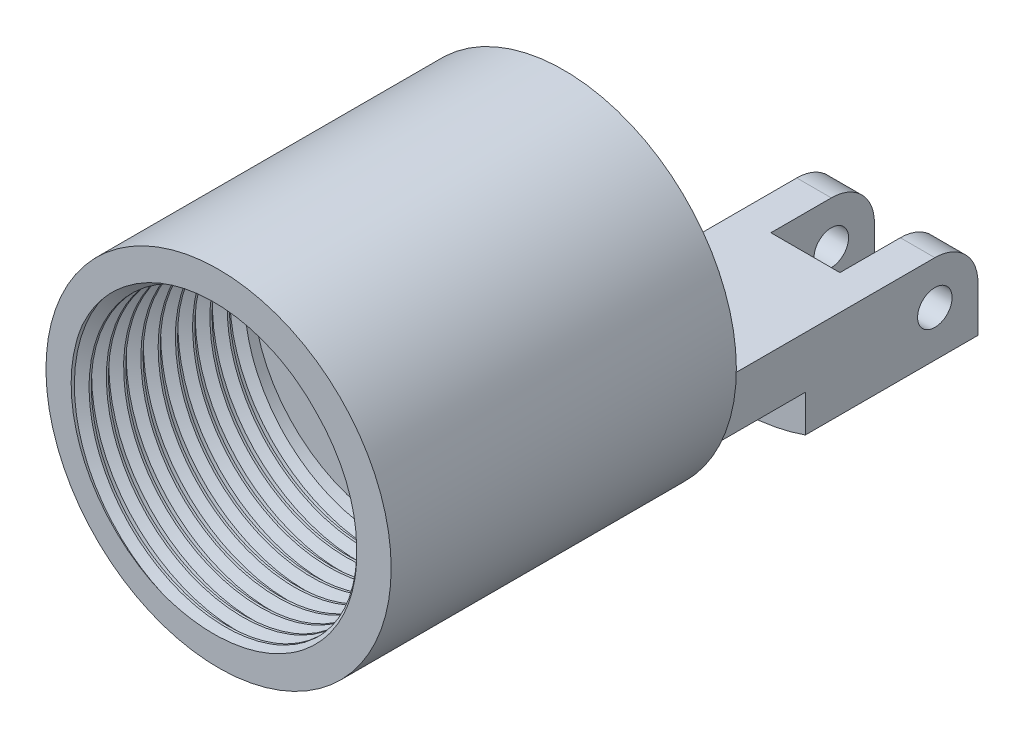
ISO-10303-21;
HEADER;
FILE_DESCRIPTION(('STEP AP214'),'2;1');
FILE_NAME('part.step','',(''),(''),'','','');
FILE_SCHEMA(('AUTOMOTIVE_DESIGN { 1 0 10303 214 1 1 1 1 }'));
ENDSEC;
DATA;
#1=APPLICATION_CONTEXT('core data for automotive mechanical design processes');
#2=APPLICATION_PROTOCOL_DEFINITION('international standard','automotive_design',2000,#1);
#3=PRODUCT_CONTEXT('',#1,'mechanical');
#4=PRODUCT('Part','Part','',(#3));
#5=PRODUCT_RELATED_PRODUCT_CATEGORY('part','',(#4));
#6=PRODUCT_DEFINITION_FORMATION('','',#4);
#7=PRODUCT_DEFINITION_CONTEXT('part definition',#1,'design');
#8=PRODUCT_DEFINITION('design','',#6,#7);
#9=PRODUCT_DEFINITION_SHAPE('','',#8);
#10=(LENGTH_UNIT() NAMED_UNIT(*) SI_UNIT(.MILLI.,.METRE.));
#11=(NAMED_UNIT(*) PLANE_ANGLE_UNIT() SI_UNIT($,.RADIAN.));
#12=(NAMED_UNIT(*) SI_UNIT($,.STERADIAN.) SOLID_ANGLE_UNIT());
#13=UNCERTAINTY_MEASURE_WITH_UNIT(LENGTH_MEASURE(1.E-05),#10,'distance_accuracy_value','');
#14=(GEOMETRIC_REPRESENTATION_CONTEXT(3) GLOBAL_UNCERTAINTY_ASSIGNED_CONTEXT((#13)) GLOBAL_UNIT_ASSIGNED_CONTEXT((#10,
#11,#12)) REPRESENTATION_CONTEXT('',''));
#15=CARTESIAN_POINT('',(0.,0.,0.));
#16=DIRECTION('',(0.,0.,1.));
#17=DIRECTION('',(1.,0.,0.));
#18=AXIS2_PLACEMENT_3D('',#15,#16,#17);
#19=CARTESIAN_POINT('',(0.,0.,-10.));
#20=DIRECTION('',(0.,0.,-1.));
#21=DIRECTION('',(-1.,0.,0.));
#22=AXIS2_PLACEMENT_3D('',#19,#20,#21);
#23=PLANE('',#22);
#24=DIRECTION('',(0.,-1.,0.));
#25=VECTOR('',#24,1.);
#26=CARTESIAN_POINT('',(-3.99999999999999,12.,-10.));
#27=LINE('',#26,#25);
#28=CARTESIAN_POINT('',(-3.99999999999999,-8.66515138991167,-10.));
#29=VERTEX_POINT('',#28);
#30=CARTESIAN_POINT('',(-3.99999999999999,-11.3137084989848,-10.));
#31=VERTEX_POINT('',#30);
#32=EDGE_CURVE('E208',#29,#31,#27,.T.);
#33=ORIENTED_EDGE('',*,*,#32,.F.);
#34=DIRECTION('',(1.,0.,0.));
#35=VECTOR('',#34,1.);
#36=CARTESIAN_POINT('',(-1.99999999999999,-8.66515138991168,-10.));
#37=LINE('',#36,#35);
#38=CARTESIAN_POINT('',(-1.99999999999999,-8.66515138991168,-10.));
#39=VERTEX_POINT('',#38);
#40=EDGE_CURVE('E371',#29,#39,#37,.T.);
#41=ORIENTED_EDGE('',*,*,#40,.T.);
#42=DIRECTION('',(0.,1.,0.));
#43=VECTOR('',#42,1.);
#44=CARTESIAN_POINT('',(-1.99999999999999,-12.001,-10.));
#45=LINE('',#44,#43);
#46=CARTESIAN_POINT('',(-1.99999999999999,-11.8321595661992,-10.));
#47=VERTEX_POINT('',#46);
#48=EDGE_CURVE('E175',#47,#39,#45,.T.);
#49=ORIENTED_EDGE('',*,*,#48,.F.);
#50=CARTESIAN_POINT('',(0.,0.,-10.));
#51=DIRECTION('',(0.,0.,-1.));
#52=DIRECTION('',(-1.,0.,0.));
#53=AXIS2_PLACEMENT_3D('',#50,#51,#52);
#54=CIRCLE('',#53,12.);
#55=EDGE_CURVE('E181',#47,#31,#54,.T.);
#56=ORIENTED_EDGE('',*,*,#55,.T.);
#57=EDGE_LOOP('',(#33,#41,#49,#56));
#58=FACE_BOUND('',#57,.T.);
#59=ADVANCED_FACE('F34',(#58),#23,.T.);
#60=CARTESIAN_POINT('',(0.,0.,30.));
#61=DIRECTION('',(0.,0.,-1.));
#62=DIRECTION('',(-1.,0.,0.));
#63=AXIS2_PLACEMENT_3D('',#60,#61,#62);
#64=CYLINDRICAL_SURFACE('',#63,10.);
#65=CARTESIAN_POINT('',(0.,0.,30.));
#66=DIRECTION('',(0.,0.,1.));
#67=DIRECTION('',(1.,0.,0.));
#68=AXIS2_PLACEMENT_3D('',#65,#66,#67);
#69=CIRCLE('',#68,10.);
#70=CARTESIAN_POINT('',(10.,0.,30.));
#71=VERTEX_POINT('',#70);
#72=EDGE_CURVE('E410',#71,#71,#69,.T.);
#73=ORIENTED_EDGE('',*,*,#72,.F.);
#74=EDGE_LOOP('',(#73));
#75=FACE_BOUND('',#74,.T.);
#76=CARTESIAN_POINT('',(0.,0.,10.));
#77=DIRECTION('',(0.,0.,-1.));
#78=DIRECTION('',(-1.,0.,0.));
#79=AXIS2_PLACEMENT_3D('',#76,#77,#78);
#80=CIRCLE('',#79,10.);
#81=CARTESIAN_POINT('',(-4.,-9.16515138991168,10.));
#82=VERTEX_POINT('',#81);
#83=CARTESIAN_POINT('',(4.,-9.16515138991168,10.));
#84=VERTEX_POINT('',#83);
#85=EDGE_CURVE('E389',#82,#84,#80,.T.);
#86=ORIENTED_EDGE('',*,*,#85,.F.);
#87=DIRECTION('',(0.,0.,-1.));
#88=VECTOR('',#87,1.);
#89=CARTESIAN_POINT('',(-4.00000000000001,-9.16515138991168,30.));
#90=LINE('',#89,#88);
#91=CARTESIAN_POINT('',(-4.,-9.16515138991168,0.));
#92=VERTEX_POINT('',#91);
#93=EDGE_CURVE('E205',#92,#82,#90,.F.);
#94=ORIENTED_EDGE('',*,*,#93,.F.);
#95=CARTESIAN_POINT('',(0.,0.,0.));
#96=DIRECTION('',(0.,0.,-1.));
#97=DIRECTION('',(-1.,0.,0.));
#98=AXIS2_PLACEMENT_3D('',#95,#96,#97);
#99=CIRCLE('',#98,10.);
#100=CARTESIAN_POINT('',(4.,-9.16515138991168,0.));
#101=VERTEX_POINT('',#100);
#102=EDGE_CURVE('E228',#101,#92,#99,.T.);
#103=ORIENTED_EDGE('',*,*,#102,.F.);
#104=DIRECTION('',(0.,0.,-1.));
#105=VECTOR('',#104,1.);
#106=CARTESIAN_POINT('',(4.,-9.16515138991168,30.));
#107=LINE('',#106,#105);
#108=EDGE_CURVE('E218',#84,#101,#107,.T.);
#109=ORIENTED_EDGE('',*,*,#108,.F.);
#110=EDGE_LOOP('',(#86,#94,#103,#109));
#111=FACE_BOUND('',#110,.T.);
#112=ADVANCED_FACE('F328',(#75,#111),#64,.T.);
#113=CARTESIAN_POINT('',(0.,0.,-10.));
#114=DIRECTION('',(0.,0.,1.));
#115=DIRECTION('',(1.,0.,0.));
#116=AXIS2_PLACEMENT_3D('',#113,#114,#115);
#117=CYLINDRICAL_SURFACE('',#116,12.);
#118=ORIENTED_EDGE('',*,*,#55,.F.);
#119=DIRECTION('',(0.,0.,1.));
#120=VECTOR('',#119,1.);
#121=CARTESIAN_POINT('',(-1.99999999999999,-11.8321595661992,-10.));
#122=LINE('',#121,#120);
#123=CARTESIAN_POINT('',(-2.,-11.8321595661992,-4.00000000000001));
#124=VERTEX_POINT('',#123);
#125=EDGE_CURVE('E158',#124,#47,#122,.F.);
#126=ORIENTED_EDGE('',*,*,#125,.F.);
#127=CARTESIAN_POINT('',(0.,0.,-4.00000000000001));
#128=DIRECTION('',(0.,0.,1.));
#129=DIRECTION('',(0.,-1.,0.));
#130=AXIS2_PLACEMENT_3D('',#127,#128,#129);
#131=CIRCLE('',#130,12.);
#132=CARTESIAN_POINT('',(2.,-11.8321595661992,-4.00000000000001));
#133=VERTEX_POINT('',#132);
#134=EDGE_CURVE('E169',#133,#124,#131,.F.);
#135=ORIENTED_EDGE('',*,*,#134,.F.);
#136=DIRECTION('',(0.,0.,1.));
#137=VECTOR('',#136,1.);
#138=CARTESIAN_POINT('',(2.,-11.8321595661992,-10.));
#139=LINE('',#138,#137);
#140=CARTESIAN_POINT('',(2.,-11.8321595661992,-10.));
#141=VERTEX_POINT('',#140);
#142=EDGE_CURVE('E182',#141,#133,#139,.T.);
#143=ORIENTED_EDGE('',*,*,#142,.F.);
#144=CARTESIAN_POINT('',(4.,-11.3137084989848,-10.));
#145=VERTEX_POINT('',#144);
#146=EDGE_CURVE('E225',#145,#141,#54,.T.);
#147=ORIENTED_EDGE('',*,*,#146,.F.);
#148=DIRECTION('',(0.,0.,1.));
#149=VECTOR('',#148,1.);
#150=CARTESIAN_POINT('',(4.,-11.3137084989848,-10.));
#151=LINE('',#150,#149);
#152=CARTESIAN_POINT('',(4.,-11.3137084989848,0.));
#153=VERTEX_POINT('',#152);
#154=EDGE_CURVE('E215',#153,#145,#151,.F.);
#155=ORIENTED_EDGE('',*,*,#154,.F.);
#156=CARTESIAN_POINT('',(0.,0.,0.));
#157=DIRECTION('',(0.,0.,-1.));
#158=DIRECTION('',(-1.,0.,0.));
#159=AXIS2_PLACEMENT_3D('',#156,#157,#158);
#160=CIRCLE('',#159,12.);
#161=CARTESIAN_POINT('',(-4.,-11.3137084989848,0.));
#162=VERTEX_POINT('',#161);
#163=EDGE_CURVE('E224',#153,#162,#160,.T.);
#164=ORIENTED_EDGE('',*,*,#163,.T.);
#165=DIRECTION('',(0.,0.,1.));
#166=VECTOR('',#165,1.);
#167=CARTESIAN_POINT('',(-3.99999999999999,-11.3137084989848,-10.));
#168=LINE('',#167,#166);
#169=EDGE_CURVE('E203',#31,#162,#168,.T.);
#170=ORIENTED_EDGE('',*,*,#169,.F.);
#171=EDGE_LOOP('',(#118,#126,#135,#143,#147,#155,#164,#170));
#172=FACE_BOUND('',#171,.T.);
#173=ADVANCED_FACE('F178',(#172),#117,.T.);
#174=DIRECTION('',(0.,1.,0.));
#175=VECTOR('',#174,1.);
#176=CARTESIAN_POINT('',(2.,-12.001,-10.));
#177=LINE('',#176,#175);
#178=CARTESIAN_POINT('',(2.,-8.66515138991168,-10.));
#179=VERTEX_POINT('',#178);
#180=EDGE_CURVE('E193',#141,#179,#177,.T.);
#181=ORIENTED_EDGE('',*,*,#180,.T.);
#182=DIRECTION('',(1.,0.,0.));
#183=VECTOR('',#182,1.);
#184=CARTESIAN_POINT('',(4.,-8.66515138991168,-10.));
#185=LINE('',#184,#183);
#186=CARTESIAN_POINT('',(4.,-8.66515138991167,-10.));
#187=VERTEX_POINT('',#186);
#188=EDGE_CURVE('E347',#179,#187,#185,.T.);
#189=ORIENTED_EDGE('',*,*,#188,.T.);
#190=DIRECTION('',(0.,-1.,0.));
#191=VECTOR('',#190,1.);
#192=CARTESIAN_POINT('',(4.,12.,-10.));
#193=LINE('',#192,#191);
#194=EDGE_CURVE('E222',#187,#145,#193,.T.);
#195=ORIENTED_EDGE('',*,*,#194,.T.);
#196=ORIENTED_EDGE('',*,*,#146,.T.);
#197=EDGE_LOOP('',(#181,#189,#195,#196));
#198=FACE_BOUND('',#197,.T.);
#199=ADVANCED_FACE('F331',(#198),#23,.T.);
#200=CARTESIAN_POINT('',(0.,0.,0.));
#201=DIRECTION('',(0.,0.,-1.));
#202=DIRECTION('',(-1.,0.,0.));
#203=AXIS2_PLACEMENT_3D('',#200,#201,#202);
#204=PLANE('',#203);
#205=DIRECTION('',(0.,1.,0.));
#206=VECTOR('',#205,1.);
#207=CARTESIAN_POINT('',(-4.,-12.001,0.));
#208=LINE('',#207,#206);
#209=EDGE_CURVE('E201',#162,#92,#208,.T.);
#210=ORIENTED_EDGE('',*,*,#209,.F.);
#211=ORIENTED_EDGE('',*,*,#163,.F.);
#212=DIRECTION('',(0.,-1.,0.));
#213=VECTOR('',#212,1.);
#214=CARTESIAN_POINT('',(4.,-12.001,0.));
#215=LINE('',#214,#213);
#216=EDGE_CURVE('E213',#101,#153,#215,.T.);
#217=ORIENTED_EDGE('',*,*,#216,.F.);
#218=ORIENTED_EDGE('',*,*,#102,.T.);
#219=EDGE_LOOP('',(#210,#211,#217,#218));
#220=FACE_BOUND('',#219,.T.);
#221=ADVANCED_FACE('F324',(#220),#204,.F.);
#222=CARTESIAN_POINT('',(0.,0.,30.));
#223=DIRECTION('',(0.,0.,1.));
#224=DIRECTION('',(1.,0.,0.));
#225=AXIS2_PLACEMENT_3D('',#222,#223,#224);
#226=PLANE('',#225);
#227=ORIENTED_EDGE('',*,*,#72,.T.);
#228=EDGE_LOOP('',(#227));
#229=FACE_BOUND('',#228,.T.);
#230=CARTESIAN_POINT('',(-3.26860101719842,-7.89110069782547,30.));
#231=CARTESIAN_POINT('',(-3.3456101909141,-7.85920093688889,30.));
#232=CARTESIAN_POINT('',(-3.42213995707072,-7.82618141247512,30.));
#233=CARTESIAN_POINT('',(-3.5742657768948,-7.75788731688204,30.));
#234=CARTESIAN_POINT('',(-3.64986096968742,-7.72261082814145,30.));
#235=CARTESIAN_POINT('',(-4.027497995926,-7.53959195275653,30.));
#236=CARTESIAN_POINT('',(-4.32160327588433,-7.37496441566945,30.));
#237=CARTESIAN_POINT('',(-4.88843206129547,-7.01211800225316,30.));
#238=CARTESIAN_POINT('',(-5.16114407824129,-6.81388125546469,30.));
#239=CARTESIAN_POINT('',(-5.60409744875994,-6.45006927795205,30.));
#240=CARTESIAN_POINT('',(-5.78074887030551,-6.29223413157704,30.));
#241=CARTESIAN_POINT('',(-6.12033104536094,-5.96244612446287,30.));
#242=CARTESIAN_POINT('',(-6.2832634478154,-5.79049496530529,30.));
#243=CARTESIAN_POINT('',(-6.59420748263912,-5.43374816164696,30.));
#244=CARTESIAN_POINT('',(-6.74222635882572,-5.24895882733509,30.));
#245=CARTESIAN_POINT('',(-7.02257200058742,-4.86752364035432,30.));
#246=CARTESIAN_POINT('',(-7.1548813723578,-4.67086500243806,30.));
#247=CARTESIAN_POINT('',(-7.40441080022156,-4.26445331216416,30.));
#248=CARTESIAN_POINT('',(-7.52139799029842,-4.05455723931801,30.));
#249=CARTESIAN_POINT('',(-7.73732508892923,-3.62556394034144,30.));
#250=CARTESIAN_POINT('',(-7.83625705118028,-3.40646271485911,30.));
#251=CARTESIAN_POINT('',(-8.01530396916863,-2.96071126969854,30.));
#252=CARTESIAN_POINT('',(-8.09541959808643,-2.73406132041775,30.));
#253=CARTESIAN_POINT('',(-8.23623660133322,-2.27492032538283,30.));
#254=CARTESIAN_POINT('',(-8.2969467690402,-2.04243197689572,30.));
#255=CARTESIAN_POINT('',(-8.39787857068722,-1.57636738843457,30.));
#256=CARTESIAN_POINT('',(-8.43836800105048,-1.34284909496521,30.));
#257=CARTESIAN_POINT('',(-8.4997788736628,-0.873470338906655,30.));
#258=CARTESIAN_POINT('',(-8.52071826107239,-0.637612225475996,30.));
#259=CARTESIAN_POINT('',(-8.54295370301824,-0.164877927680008,30.));
#260=CARTESIAN_POINT('',(-8.54424168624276,0.0719986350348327,30.));
#261=CARTESIAN_POINT('',(-8.5271411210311,0.545075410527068,30.));
#262=CARTESIAN_POINT('',(-8.50875064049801,0.781275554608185,30.));
#263=CARTESIAN_POINT('',(-8.45764885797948,1.20771901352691,30.));
#264=CARTESIAN_POINT('',(-8.42822484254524,1.39836364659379,30.));
#265=CARTESIAN_POINT('',(-8.35654585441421,1.77722511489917,30.));
#266=CARTESIAN_POINT('',(-8.31429137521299,1.96544204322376,30.));
#267=CARTESIAN_POINT('',(-8.2162250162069,2.34210156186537,30.));
#268=CARTESIAN_POINT('',(-8.16017259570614,2.53048152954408,30.));
#269=CARTESIAN_POINT('',(-8.03521043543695,2.90297591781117,30.));
#270=CARTESIAN_POINT('',(-7.96629772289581,3.08708934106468,30.));
#271=CARTESIAN_POINT('',(-7.89110069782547,3.26860101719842,30.));
#272=B_SPLINE_CURVE_WITH_KNOTS('',3,(#230,#231,#232,#233,#234,#235,#236,#237,#238,#239,#240,
#241,#242,#243,#244,#245,#246,#247,#248,#249,#250,#251,#252,#253,#254,#255,#256,#257,#258,#259,
#260,#261,#262,#263,#264,#265,#266,#267,#268,#269,#270,#271),.UNSPECIFIED.,.F.,.F.,(4,2,2,2,2,2,
2,2,2,2,2,2,2,2,2,2,2,2,2,2,4),(0.,0.250026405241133,0.500268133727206,1.50878331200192,
2.51783642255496,3.22774349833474,3.93756512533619,4.64704029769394,5.35729382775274,
6.07732749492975,6.79767729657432,7.51800132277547,8.23799847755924,8.94818909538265,
9.65772718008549,10.3675566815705,11.0774558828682,11.6557375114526,12.2339969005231,
12.8231563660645,13.4124521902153),.UNSPECIFIED.);
#273=CARTESIAN_POINT('',(-3.26860101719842,-7.89110069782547,30.));
#274=VERTEX_POINT('',#273);
#275=CARTESIAN_POINT('',(-7.89110069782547,3.26860101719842,30.));
#276=VERTEX_POINT('',#275);
#277=EDGE_CURVE('E398',#274,#276,#272,.T.);
#278=ORIENTED_EDGE('',*,*,#277,.T.);
#279=CARTESIAN_POINT('',(-7.89110069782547,3.26860101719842,30.));
#280=CARTESIAN_POINT('',(-7.79940942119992,3.47080927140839,30.));
#281=CARTESIAN_POINT('',(-7.69979528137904,3.66942398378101,30.));
#282=CARTESIAN_POINT('',(-7.48520227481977,4.05865905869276,30.));
#283=CARTESIAN_POINT('',(-7.37019492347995,4.24926371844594,30.));
#284=CARTESIAN_POINT('',(-7.12426580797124,4.62300065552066,30.));
#285=CARTESIAN_POINT('',(-6.9931790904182,4.80602432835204,30.));
#286=CARTESIAN_POINT('',(-6.71689975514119,5.16123010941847,30.));
#287=CARTESIAN_POINT('',(-6.57170238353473,5.33340853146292,30.));
#288=CARTESIAN_POINT('',(-6.34404035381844,5.58266906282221,30.));
#289=CARTESIAN_POINT('',(-6.26647973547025,5.66428177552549,30.));
#290=CARTESIAN_POINT('',(-6.10820109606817,5.8243941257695,30.));
#291=CARTESIAN_POINT('',(-6.02748309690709,5.90289378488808,30.));
#292=CARTESIAN_POINT('',(-5.86293141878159,6.05661086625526,30.));
#293=CARTESIAN_POINT('',(-5.77909679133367,6.13182727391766,30.));
#294=CARTESIAN_POINT('',(-5.6084424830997,6.27878374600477,30.));
#295=CARTESIAN_POINT('',(-5.52162277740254,6.35052378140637,30.));
#296=CARTESIAN_POINT('',(-5.24640491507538,6.56868987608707,30.));
#297=CARTESIAN_POINT('',(-5.05301130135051,6.70889788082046,30.));
#298=CARTESIAN_POINT('',(-4.65490013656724,6.97216635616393,30.));
#299=CARTESIAN_POINT('',(-4.45018152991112,7.09522522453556,30.));
#300=CARTESIAN_POINT('',(-4.03087061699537,7.32332686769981,30.));
#301=CARTESIAN_POINT('',(-3.81627603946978,7.42836547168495,30.));
#302=CARTESIAN_POINT('',(-3.37893858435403,7.61956750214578,30.));
#303=CARTESIAN_POINT('',(-3.15619895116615,7.70573835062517,30.));
#304=CARTESIAN_POINT('',(-2.7085649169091,7.85712567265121,30.));
#305=CARTESIAN_POINT('',(-2.48379788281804,7.92271904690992,30.));
#306=CARTESIAN_POINT('',(-2.02953268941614,8.0347354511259,30.));
#307=CARTESIAN_POINT('',(-1.80003451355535,8.08115841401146,30.));
#308=CARTESIAN_POINT('',(-1.3379765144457,8.15450291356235,30.));
#309=CARTESIAN_POINT('',(-1.1054170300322,8.18142659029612,30.));
#310=CARTESIAN_POINT('',(-0.63882616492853,8.21557906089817,30.));
#311=CARTESIAN_POINT('',(-0.40479477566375,8.22280773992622,30.));
#312=CARTESIAN_POINT('',(-0.0538546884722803,8.21887357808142,30.));
#313=CARTESIAN_POINT('',(0.0631782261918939,8.21509256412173,30.));
#314=CARTESIAN_POINT('',(0.296968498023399,8.20245494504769,30.));
#315=CARTESIAN_POINT('',(0.413725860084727,8.19359843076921,30.));
#316=CARTESIAN_POINT('',(0.763244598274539,8.15945379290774,30.));
#317=CARTESIAN_POINT('',(0.995311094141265,8.12658993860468,30.));
#318=CARTESIAN_POINT('',(1.45572264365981,8.04089427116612,30.));
#319=CARTESIAN_POINT('',(1.68406725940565,7.98806012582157,30.));
#320=CARTESIAN_POINT('',(2.13533207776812,7.86282014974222,30.));
#321=CARTESIAN_POINT('',(2.35825235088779,7.79041457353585,30.));
#322=CARTESIAN_POINT('',(2.79157244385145,7.62859680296,30.));
#323=CARTESIAN_POINT('',(3.00214543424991,7.53964771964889,30.));
#324=CARTESIAN_POINT('',(3.41502704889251,7.34428403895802,30.));
#325=CARTESIAN_POINT('',(3.61733579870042,7.23786970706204,30.));
#326=CARTESIAN_POINT('',(4.01202537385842,7.00846401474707,30.));
#327=CARTESIAN_POINT('',(4.20441674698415,6.88549079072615,30.));
#328=CARTESIAN_POINT('',(4.57806891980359,6.6238005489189,30.));
#329=CARTESIAN_POINT('',(4.75933463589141,6.48509056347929,30.));
#330=CARTESIAN_POINT('',(5.0617627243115,6.23273952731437,30.));
#331=CARTESIAN_POINT('',(5.18584067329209,6.12257050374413,30.));
#332=CARTESIAN_POINT('',(5.42678816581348,5.89503884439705,30.));
#333=CARTESIAN_POINT('',(5.5436704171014,5.77768966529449,30.));
#334=CARTESIAN_POINT('',(5.65685436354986,5.6568541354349,30.));
#335=B_SPLINE_CURVE_WITH_KNOTS('',3,(#279,#280,#281,#282,#283,#284,#285,#286,#287,#288,#289,
#290,#291,#292,#293,#294,#295,#296,#297,#298,#299,#300,#301,#302,#303,#304,#305,#306,#307,#308,
#309,#310,#311,#312,#313,#314,#315,#316,#317,#318,#319,#320,#321,#322,#323,#324,#325,#326,#327,
#328,#329,#330,#331,#332,#333,#334),.UNSPECIFIED.,.F.,.F.,(4,2,2,2,2,2,2,2,2,2,2,2,2,2,2,2,2,2,
2,2,2,2,2,2,2,2,2,4),(0.,0.665909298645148,1.33306832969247,2.00775652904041,2.68267282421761,
3.02036802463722,3.35806088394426,3.69585736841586,4.03365667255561,4.74930243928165,
5.46501502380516,6.18089303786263,6.89648893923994,7.59808772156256,8.29968895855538,
9.00121318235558,9.70274149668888,10.0539305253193,10.4051132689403,11.107303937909,
11.8095766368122,12.5118402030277,13.1967962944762,13.8817419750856,14.5659434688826,
15.249840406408,15.7473317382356,16.2439176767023),.UNSPECIFIED.);
#336=CARTESIAN_POINT('',(5.65685436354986,5.6568541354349,30.));
#337=VERTEX_POINT('',#336);
#338=EDGE_CURVE('E273',#276,#337,#335,.T.);
#339=ORIENTED_EDGE('',*,*,#338,.T.);
#340=CARTESIAN_POINT('',(0.,0.,30.));
#341=DIRECTION('',(0.,0.,1.));
#342=DIRECTION('',(1.,0.,0.));
#343=AXIS2_PLACEMENT_3D('',#340,#341,#342);
#344=CIRCLE('',#343,8.);
#345=CARTESIAN_POINT('',(8.,0.,30.));
#346=VERTEX_POINT('',#345);
#347=EDGE_CURVE('E285',#346,#337,#344,.T.);
#348=ORIENTED_EDGE('',*,*,#347,.F.);
#349=CARTESIAN_POINT('',(8.,0.,30.));
#350=CARTESIAN_POINT('',(8.00727457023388,-0.22200530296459,30.));
#351=CARTESIAN_POINT('',(8.00537970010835,-0.444306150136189,30.));
#352=CARTESIAN_POINT('',(7.9833381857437,-0.888427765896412,30.));
#353=CARTESIAN_POINT('',(7.96315666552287,-1.11024680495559,30.));
#354=CARTESIAN_POINT('',(7.90423081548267,-1.55426991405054,30.));
#355=CARTESIAN_POINT('',(7.86525444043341,-1.77644322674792,30.));
#356=CARTESIAN_POINT('',(7.76890698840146,-2.21684361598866,30.));
#357=CARTESIAN_POINT('',(7.71152961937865,-2.43506931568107,30.));
#358=CARTESIAN_POINT('',(7.57873869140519,-2.86611556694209,30.));
#359=CARTESIAN_POINT('',(7.50331365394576,-3.07893258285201,30.));
#360=CARTESIAN_POINT('',(7.33497334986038,-3.4975328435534,30.));
#361=CARTESIAN_POINT('',(7.24205798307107,-3.70331604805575,30.));
#362=CARTESIAN_POINT('',(7.03838625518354,-4.10840116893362,30.));
#363=CARTESIAN_POINT('',(6.92746338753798,-4.30761941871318,30.));
#364=CARTESIAN_POINT('',(6.68923548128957,-4.69599268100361,30.));
#365=CARTESIAN_POINT('',(6.56193065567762,-4.88514782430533,30.));
#366=CARTESIAN_POINT('',(6.29183087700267,-5.25209835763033,30.));
#367=CARTESIAN_POINT('',(6.14903576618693,-5.42989363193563,30.));
#368=CARTESIAN_POINT('',(5.92400977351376,-5.68701307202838,30.));
#369=CARTESIAN_POINT('',(5.8471901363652,-5.77112920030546,30.));
#370=CARTESIAN_POINT('',(5.69012306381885,-5.93613847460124,30.));
#371=CARTESIAN_POINT('',(5.60987473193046,-6.01703076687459,30.));
#372=CARTESIAN_POINT('',(5.36378866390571,-6.25511307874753,30.));
#373=CARTESIAN_POINT('',(5.19300921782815,-6.40725306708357,30.));
#374=CARTESIAN_POINT('',(4.83952706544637,-6.69693902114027,30.));
#375=CARTESIAN_POINT('',(4.65682438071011,-6.83448501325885,30.));
#376=CARTESIAN_POINT('',(4.28071618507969,-7.09407967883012,30.));
#377=CARTESIAN_POINT('',(4.08731078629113,-7.21612851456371,30.));
#378=CARTESIAN_POINT('',(3.69111102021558,-7.44389472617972,30.));
#379=CARTESIAN_POINT('',(3.48831651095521,-7.54961185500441,30.));
#380=CARTESIAN_POINT('',(3.06987948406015,-7.74626994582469,30.));
#381=CARTESIAN_POINT('',(2.85404750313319,-7.836808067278,30.));
#382=CARTESIAN_POINT('',(2.41542633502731,-7.99942117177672,30.));
#383=CARTESIAN_POINT('',(2.19263407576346,-8.07148786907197,30.));
#384=CARTESIAN_POINT('',(1.74176047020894,-8.19660012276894,30.));
#385=CARTESIAN_POINT('',(1.51367871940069,-8.24964421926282,30.));
#386=CARTESIAN_POINT('',(1.05387076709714,-8.33631588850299,30.));
#387=CARTESIAN_POINT('',(0.822145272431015,-8.36994718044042,30.));
#388=CARTESIAN_POINT('',(0.473128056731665,-8.40567480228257,30.));
#389=CARTESIAN_POINT('',(0.356547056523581,-8.41513085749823,30.));
#390=CARTESIAN_POINT('',(0.123108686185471,-8.42910073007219,30.));
#391=CARTESIAN_POINT('',(0.00625136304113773,-8.43361533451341,30.));
#392=CARTESIAN_POINT('',(-0.344494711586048,-8.43994237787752,30.));
#393=CARTESIAN_POINT('',(-0.578553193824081,-8.43453760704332,30.));
#394=CARTESIAN_POINT('',(-1.04520139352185,-8.40455042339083,30.));
#395=CARTESIAN_POINT('',(-1.27779221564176,-8.37998477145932,30.));
#396=CARTESIAN_POINT('',(-1.74009139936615,-8.31186721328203,30.));
#397=CARTESIAN_POINT('',(-1.96980098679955,-8.2683236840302,30.));
#398=CARTESIAN_POINT('',(-2.37934365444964,-8.17313199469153,30.));
#399=CARTESIAN_POINT('',(-2.55996623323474,-8.12484493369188,30.));
#400=CARTESIAN_POINT('',(-2.91730228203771,-8.016636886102,30.));
#401=CARTESIAN_POINT('',(-3.09402277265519,-7.95673908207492,30.));
#402=CARTESIAN_POINT('',(-3.26860101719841,-7.89110069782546,30.));
#403=B_SPLINE_CURVE_WITH_KNOTS('',3,(#349,#350,#351,#352,#353,#354,#355,#356,#357,#358,#359,
#360,#361,#362,#363,#364,#365,#366,#367,#368,#369,#370,#371,#372,#373,#374,#375,#376,#377,#378,
#379,#380,#381,#382,#383,#384,#385,#386,#387,#388,#389,#390,#391,#392,#393,#394,#395,#396,#397,
#398,#399,#400,#401,#402),.UNSPECIFIED.,.F.,.F.,(4,2,2,2,2,2,2,2,2,2,2,2,2,2,2,2,2,2,2,2,2,2,2,
2,2,2,4),(0.,0.666178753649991,1.33363071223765,2.00954276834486,2.68568619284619,
3.36226080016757,4.03883928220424,4.72207308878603,5.40529801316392,6.08852989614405,
6.43019086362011,6.77194171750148,7.45725515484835,8.14256735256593,8.82787237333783,
9.51318776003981,10.2145114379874,10.9161491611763,11.617840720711,12.3193978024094,
12.6701988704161,13.0209440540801,13.7224475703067,14.4233381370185,15.1239196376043,
15.6844278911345,16.2438283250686),.UNSPECIFIED.);
#404=EDGE_CURVE('E404',#346,#274,#403,.T.);
#405=ORIENTED_EDGE('',*,*,#404,.T.);
#406=EDGE_LOOP('',(#278,#339,#348,#405));
#407=FACE_BOUND('',#406,.T.);
#408=ADVANCED_FACE('F288',(#229,#407),#226,.T.);
#409=CARTESIAN_POINT('',(0.,0.,20.));
#410=DIRECTION('',(0.,0.,1.));
#411=DIRECTION('',(1.,0.,0.));
#412=AXIS2_PLACEMENT_3D('',#409,#410,#411);
#413=CYLINDRICAL_SURFACE('',#412,8.);
#414=CARTESIAN_POINT('',(8.,0.,20.8750000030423));
#415=CARTESIAN_POINT('',(8.,3.31370849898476,20.9375000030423));
#416=CARTESIAN_POINT('',(5.65685424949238,5.65685424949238,21.0000000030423));
#417=CARTESIAN_POINT('',(3.31370849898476,8.,21.0625000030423));
#418=CARTESIAN_POINT('',(0.,8.,21.1250000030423));
#419=CARTESIAN_POINT('',(-3.31370849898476,8.,21.1875000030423));
#420=CARTESIAN_POINT('',(-5.65685424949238,5.65685424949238,21.2500000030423));
#421=CARTESIAN_POINT('',(-8.,3.31370849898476,21.3125000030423));
#422=CARTESIAN_POINT('',(-8.,0.,21.3750000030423));
#423=CARTESIAN_POINT('',(-8.,-3.31370849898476,21.4375000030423));
#424=CARTESIAN_POINT('',(-5.65685424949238,-5.65685424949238,21.5000000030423));
#425=CARTESIAN_POINT('',(-3.31370849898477,-8.,21.5625000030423));
#426=CARTESIAN_POINT('',(0.,-8.,21.6250000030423));
#427=CARTESIAN_POINT('',(3.31370849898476,-8.,21.6875000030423));
#428=CARTESIAN_POINT('',(5.65685424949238,-5.65685424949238,21.7500000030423));
#429=CARTESIAN_POINT('',(8.,-3.31370849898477,21.8125000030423));
#430=CARTESIAN_POINT('',(8.,0.,21.8750000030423));
#431=CARTESIAN_POINT('',(8.,3.31370849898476,21.9375000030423));
#432=CARTESIAN_POINT('',(5.65685424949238,5.65685424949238,22.0000000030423));
#433=CARTESIAN_POINT('',(3.31370849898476,8.,22.0625000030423));
#434=CARTESIAN_POINT('',(0.,8.,22.1250000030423));
#435=CARTESIAN_POINT('',(-3.31370849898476,8.,22.1875000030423));
#436=CARTESIAN_POINT('',(-5.65685424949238,5.65685424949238,22.2500000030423));
#437=CARTESIAN_POINT('',(-8.,3.31370849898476,22.3125000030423));
#438=CARTESIAN_POINT('',(-8.,0.,22.3750000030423));
#439=CARTESIAN_POINT('',(-8.,-3.31370849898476,22.4375000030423));
#440=CARTESIAN_POINT('',(-5.65685424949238,-5.65685424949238,22.5000000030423));
#441=CARTESIAN_POINT('',(-3.31370849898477,-8.,22.5625000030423));
#442=CARTESIAN_POINT('',(0.,-8.,22.6250000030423));
#443=CARTESIAN_POINT('',(3.31370849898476,-8.,22.6875000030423));
#444=CARTESIAN_POINT('',(5.65685424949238,-5.65685424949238,22.7500000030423));
#445=CARTESIAN_POINT('',(8.,-3.31370849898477,22.8125000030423));
#446=CARTESIAN_POINT('',(8.,0.,22.8750000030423));
#447=CARTESIAN_POINT('',(8.,3.31370849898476,22.9375000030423));
#448=CARTESIAN_POINT('',(5.65685424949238,5.65685424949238,23.0000000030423));
#449=CARTESIAN_POINT('',(3.31370849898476,8.,23.0625000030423));
#450=CARTESIAN_POINT('',(0.,8.,23.1250000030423));
#451=CARTESIAN_POINT('',(-3.31370849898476,8.,23.1875000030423));
#452=CARTESIAN_POINT('',(-5.65685424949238,5.65685424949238,23.2500000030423));
#453=CARTESIAN_POINT('',(-8.,3.31370849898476,23.3125000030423));
#454=CARTESIAN_POINT('',(-8.,0.,23.3750000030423));
#455=CARTESIAN_POINT('',(-8.,-3.31370849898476,23.4375000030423));
#456=CARTESIAN_POINT('',(-5.65685424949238,-5.65685424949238,23.5000000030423));
#457=CARTESIAN_POINT('',(-3.31370849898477,-8.,23.5625000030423));
#458=CARTESIAN_POINT('',(0.,-8.,23.6250000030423));
#459=CARTESIAN_POINT('',(3.31370849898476,-8.,23.6875000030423));
#460=CARTESIAN_POINT('',(5.65685424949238,-5.65685424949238,23.7500000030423));
#461=CARTESIAN_POINT('',(8.,-3.31370849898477,23.8125000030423));
#462=CARTESIAN_POINT('',(8.,0.,23.8750000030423));
#463=CARTESIAN_POINT('',(8.,3.31370849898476,23.9375000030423));
#464=CARTESIAN_POINT('',(5.65685424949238,5.65685424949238,24.0000000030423));
#465=CARTESIAN_POINT('',(3.31370849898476,8.,24.0625000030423));
#466=CARTESIAN_POINT('',(0.,8.,24.1250000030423));
#467=CARTESIAN_POINT('',(-3.31370849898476,8.,24.1875000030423));
#468=CARTESIAN_POINT('',(-5.65685424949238,5.65685424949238,24.2500000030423));
#469=CARTESIAN_POINT('',(-8.,3.31370849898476,24.3125000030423));
#470=CARTESIAN_POINT('',(-8.,0.,24.3750000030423));
#471=CARTESIAN_POINT('',(-8.,-3.31370849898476,24.4375000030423));
#472=CARTESIAN_POINT('',(-5.65685424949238,-5.65685424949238,24.5000000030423));
#473=CARTESIAN_POINT('',(-3.31370849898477,-8.,24.5625000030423));
#474=CARTESIAN_POINT('',(0.,-8.,24.6250000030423));
#475=CARTESIAN_POINT('',(3.31370849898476,-8.,24.6875000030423));
#476=CARTESIAN_POINT('',(5.65685424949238,-5.65685424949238,24.7500000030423));
#477=CARTESIAN_POINT('',(8.,-3.31370849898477,24.8125000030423));
#478=CARTESIAN_POINT('',(8.,0.,24.8750000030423));
#479=CARTESIAN_POINT('',(8.,3.31370849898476,24.9375000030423));
#480=CARTESIAN_POINT('',(5.65685424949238,5.65685424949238,25.0000000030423));
#481=CARTESIAN_POINT('',(3.31370849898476,8.,25.0625000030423));
#482=CARTESIAN_POINT('',(0.,8.,25.1250000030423));
#483=CARTESIAN_POINT('',(-3.31370849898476,8.,25.1875000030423));
#484=CARTESIAN_POINT('',(-5.65685424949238,5.65685424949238,25.2500000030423));
#485=CARTESIAN_POINT('',(-8.,3.31370849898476,25.3125000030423));
#486=CARTESIAN_POINT('',(-8.,0.,25.3750000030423));
#487=CARTESIAN_POINT('',(-8.,-3.31370849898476,25.4375000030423));
#488=CARTESIAN_POINT('',(-5.65685424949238,-5.65685424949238,25.5000000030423));
#489=CARTESIAN_POINT('',(-3.31370849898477,-8.,25.5625000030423));
#490=CARTESIAN_POINT('',(0.,-8.,25.6250000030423));
#491=CARTESIAN_POINT('',(3.31370849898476,-8.,25.6875000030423));
#492=CARTESIAN_POINT('',(5.65685424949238,-5.65685424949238,25.7500000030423));
#493=CARTESIAN_POINT('',(8.,-3.31370849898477,25.8125000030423));
#494=CARTESIAN_POINT('',(8.,0.,25.8750000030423));
#495=CARTESIAN_POINT('',(8.,3.31370849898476,25.9375000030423));
#496=CARTESIAN_POINT('',(5.65685424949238,5.65685424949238,26.0000000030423));
#497=CARTESIAN_POINT('',(3.31370849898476,8.,26.0625000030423));
#498=CARTESIAN_POINT('',(0.,8.,26.1250000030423));
#499=CARTESIAN_POINT('',(-3.31370849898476,8.,26.1875000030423));
#500=CARTESIAN_POINT('',(-5.65685424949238,5.65685424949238,26.2500000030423));
#501=CARTESIAN_POINT('',(-8.,3.31370849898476,26.3125000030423));
#502=CARTESIAN_POINT('',(-8.,0.,26.3750000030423));
#503=CARTESIAN_POINT('',(-8.,-3.31370849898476,26.4375000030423));
#504=CARTESIAN_POINT('',(-5.65685424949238,-5.65685424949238,26.5000000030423));
#505=CARTESIAN_POINT('',(-3.31370849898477,-8.,26.5625000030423));
#506=CARTESIAN_POINT('',(0.,-8.,26.6250000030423));
#507=CARTESIAN_POINT('',(3.31370849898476,-8.,26.6875000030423));
#508=CARTESIAN_POINT('',(5.65685424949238,-5.65685424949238,26.7500000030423));
#509=CARTESIAN_POINT('',(8.,-3.31370849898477,26.8125000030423));
#510=CARTESIAN_POINT('',(8.,0.,26.8750000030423));
#511=CARTESIAN_POINT('',(8.,3.31370849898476,26.9375000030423));
#512=CARTESIAN_POINT('',(5.65685424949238,5.65685424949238,27.0000000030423));
#513=CARTESIAN_POINT('',(3.31370849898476,8.,27.0625000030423));
#514=CARTESIAN_POINT('',(0.,8.,27.1250000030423));
#515=CARTESIAN_POINT('',(-3.31370849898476,8.,27.1875000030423));
#516=CARTESIAN_POINT('',(-5.65685424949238,5.65685424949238,27.2500000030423));
#517=CARTESIAN_POINT('',(-8.,3.31370849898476,27.3125000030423));
#518=CARTESIAN_POINT('',(-8.,0.,27.3750000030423));
#519=CARTESIAN_POINT('',(-8.,-3.31370849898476,27.4375000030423));
#520=CARTESIAN_POINT('',(-5.65685424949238,-5.65685424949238,27.5000000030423));
#521=CARTESIAN_POINT('',(-3.31370849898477,-8.,27.5625000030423));
#522=CARTESIAN_POINT('',(0.,-8.,27.6250000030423));
#523=CARTESIAN_POINT('',(3.31370849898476,-8.,27.6875000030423));
#524=CARTESIAN_POINT('',(5.65685424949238,-5.65685424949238,27.7500000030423));
#525=CARTESIAN_POINT('',(8.,-3.31370849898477,27.8125000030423));
#526=CARTESIAN_POINT('',(8.,0.,27.8750000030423));
#527=CARTESIAN_POINT('',(8.,3.31370849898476,27.9375000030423));
#528=CARTESIAN_POINT('',(5.65685424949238,5.65685424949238,28.0000000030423));
#529=CARTESIAN_POINT('',(3.31370849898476,8.,28.0625000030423));
#530=CARTESIAN_POINT('',(0.,8.,28.1250000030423));
#531=CARTESIAN_POINT('',(-3.31370849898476,8.,28.1875000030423));
#532=CARTESIAN_POINT('',(-5.65685424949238,5.65685424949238,28.2500000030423));
#533=CARTESIAN_POINT('',(-8.,3.31370849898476,28.3125000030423));
#534=CARTESIAN_POINT('',(-8.,0.,28.3750000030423));
#535=CARTESIAN_POINT('',(-8.,-3.31370849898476,28.4375000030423));
#536=CARTESIAN_POINT('',(-5.65685424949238,-5.65685424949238,28.5000000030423));
#537=CARTESIAN_POINT('',(-3.31370849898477,-8.,28.5625000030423));
#538=CARTESIAN_POINT('',(0.,-8.,28.6250000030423));
#539=CARTESIAN_POINT('',(3.31370849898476,-8.,28.6875000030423));
#540=CARTESIAN_POINT('',(5.65685424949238,-5.65685424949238,28.7500000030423));
#541=CARTESIAN_POINT('',(8.,-3.31370849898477,28.8125000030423));
#542=CARTESIAN_POINT('',(8.,0.,28.8750000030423));
#543=CARTESIAN_POINT('',(8.,3.31370849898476,28.9375000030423));
#544=CARTESIAN_POINT('',(5.65685424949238,5.65685424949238,29.0000000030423));
#545=CARTESIAN_POINT('',(3.31370849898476,8.,29.0625000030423));
#546=CARTESIAN_POINT('',(0.,8.,29.1250000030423));
#547=CARTESIAN_POINT('',(-3.31370849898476,8.,29.1875000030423));
#548=CARTESIAN_POINT('',(-5.65685424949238,5.65685424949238,29.2500000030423));
#549=CARTESIAN_POINT('',(-8.,3.31370849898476,29.3125000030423));
#550=CARTESIAN_POINT('',(-8.,0.,29.3750000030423));
#551=CARTESIAN_POINT('',(-8.,-3.31370849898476,29.4375000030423));
#552=CARTESIAN_POINT('',(-5.65685424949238,-5.65685424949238,29.5000000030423));
#553=CARTESIAN_POINT('',(-3.31370849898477,-8.,29.5625000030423));
#554=CARTESIAN_POINT('',(0.,-8.,29.6250000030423));
#555=CARTESIAN_POINT('',(3.31370849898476,-8.,29.6875000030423));
#556=CARTESIAN_POINT('',(5.65685424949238,-5.65685424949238,29.7500000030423));
#557=CARTESIAN_POINT('',(8.,-3.31370849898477,29.8125000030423));
#558=CARTESIAN_POINT('',(8.,0.,29.8750000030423));
#559=CARTESIAN_POINT('',(8.,3.31370849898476,29.9375000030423));
#560=CARTESIAN_POINT('',(5.65685424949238,5.65685424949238,30.0000000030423));
#561=CARTESIAN_POINT('',(3.31370849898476,8.,30.0625000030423));
#562=CARTESIAN_POINT('',(0.,8.,30.1250000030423));
#563=CARTESIAN_POINT('',(-3.31370849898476,8.,30.1875000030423));
#564=CARTESIAN_POINT('',(-5.65685424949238,5.65685424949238,30.2500000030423));
#565=CARTESIAN_POINT('',(-8.,3.31370849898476,30.3125000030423));
#566=CARTESIAN_POINT('',(-8.,0.,30.3750000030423));
#567=CARTESIAN_POINT('',(-8.,-3.31370849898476,30.4375000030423));
#568=CARTESIAN_POINT('',(-5.65685424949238,-5.65685424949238,30.5000000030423));
#569=CARTESIAN_POINT('',(-3.31370849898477,-8.,30.5625000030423));
#570=CARTESIAN_POINT('',(0.,-8.,30.6250000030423));
#571=CARTESIAN_POINT('',(3.31370849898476,-8.,30.6875000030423));
#572=CARTESIAN_POINT('',(5.65685424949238,-5.65685424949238,30.7500000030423));
#573=CARTESIAN_POINT('',(8.,-3.31370849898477,30.8125000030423));
#574=CARTESIAN_POINT('',(8.,0.,30.8750000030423));
#575=(BOUNDED_CURVE() B_SPLINE_CURVE(2,(#414,#415,#416,#417,#418,#419,#420,#421,#422,#423,#424,
#425,#426,#427,#428,#429,#430,#431,#432,#433,#434,#435,#436,#437,#438,#439,#440,#441,#442,#443,
#444,#445,#446,#447,#448,#449,#450,#451,#452,#453,#454,#455,#456,#457,#458,#459,#460,#461,#462,
#463,#464,#465,#466,#467,#468,#469,#470,#471,#472,#473,#474,#475,#476,#477,#478,#479,#480,#481,
#482,#483,#484,#485,#486,#487,#488,#489,#490,#491,#492,#493,#494,#495,#496,#497,#498,#499,#500,
#501,#502,#503,#504,#505,#506,#507,#508,#509,#510,#511,#512,#513,#514,#515,#516,#517,#518,#519,
#520,#521,#522,#523,#524,#525,#526,#527,#528,#529,#530,#531,#532,#533,#534,#535,#536,#537,#538,
#539,#540,#541,#542,#543,#544,#545,#546,#547,#548,#549,#550,#551,#552,#553,#554,#555,#556,#557,
#558,#559,#560,#561,#562,#563,#564,#565,#566,#567,#568,#569,#570,#571,#572,#573,#574),
.UNSPECIFIED.,.F.,.F.) B_SPLINE_CURVE_WITH_KNOTS((3,2,2,2,2,2,2,2,2,2,2,2,2,2,2,2,2,2,2,2,2,2,2,
2,2,2,2,2,2,2,2,2,2,2,2,2,2,2,2,2,2,2,2,2,2,2,2,2,2,2,2,2,2,2,2,2,2,2,2,2,2,2,2,2,2,2,2,2,2,2,2,
2,2,2,2,2,2,2,2,2,3),(0.,0.0125,0.025,0.0375,0.05,0.0625,0.075,0.0875,0.1,0.1125,0.125,0.1375,
0.15,0.1625,0.175,0.1875,0.2,0.2125,0.225,0.2375,0.25,0.2625,0.275,0.2875,0.3,0.3125,0.325,
0.3375,0.35,0.3625,0.375,0.3875,0.4,0.4125,0.425,0.4375,0.45,0.4625,0.475,0.4875,0.5,0.5125,
0.525,0.5375,0.55,0.5625,0.575,0.5875,0.6,0.6125,0.625,0.6375,0.65,0.6625,0.675,0.6875,0.7,
0.7125,0.725,0.7375,0.75,0.7625,0.775,0.7875,0.8,0.8125,0.825,0.8375,0.85,0.8625,0.875,0.8875,
0.9,0.9125,0.925,0.9375,0.95,0.9625,0.975,0.9875,1.),
.UNSPECIFIED.) CURVE() GEOMETRIC_REPRESENTATION_ITEM() RATIONAL_B_SPLINE_CURVE((1.,
0.923879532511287,1.,0.923879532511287,1.,0.923879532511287,1.,0.923879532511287,1.,
0.923879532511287,1.,0.923879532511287,1.,0.923879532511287,1.,0.923879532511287,1.,
0.923879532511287,1.,0.923879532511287,1.,0.923879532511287,1.,0.923879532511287,1.,
0.923879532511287,1.,0.923879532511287,1.,0.923879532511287,1.,0.923879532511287,1.,
0.923879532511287,1.,0.923879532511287,1.,0.923879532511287,1.,0.923879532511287,1.,
0.923879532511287,1.,0.923879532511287,1.,0.923879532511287,1.,0.923879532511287,1.,
0.923879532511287,1.,0.923879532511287,1.,0.923879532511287,1.,0.923879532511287,1.,
0.923879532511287,1.,0.923879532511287,1.,0.923879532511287,1.,0.923879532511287,1.,
0.923879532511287,1.,0.923879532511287,1.,0.923879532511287,1.,0.923879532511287,1.,
0.923879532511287,1.,0.923879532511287,1.,0.923879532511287,1.,0.923879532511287,1.,
0.923879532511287,1.,0.923879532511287,1.,0.923879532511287,1.,0.923879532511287,1.,
0.923879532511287,1.,0.923879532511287,1.,0.923879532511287,1.,0.923879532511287,1.,
0.923879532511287,1.,0.923879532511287,1.,0.923879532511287,1.,0.923879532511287,1.,
0.923879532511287,1.,0.923879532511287,1.,0.923879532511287,1.,0.923879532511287,1.,
0.923879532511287,1.,0.923879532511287,1.,0.923879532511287,1.,0.923879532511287,1.,
0.923879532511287,1.,0.923879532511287,1.,0.923879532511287,1.,0.923879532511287,1.,
0.923879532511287,1.,0.923879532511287,1.,0.923879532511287,1.,0.923879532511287,1.,
0.923879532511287,1.,0.923879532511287,1.,0.923879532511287,1.,0.923879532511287,1.,
0.923879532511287,1.,0.923879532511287,1.,0.923879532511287,1.,0.923879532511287,1.,
0.923879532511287,1.,0.923879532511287,1.,0.923879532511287,1.,0.923879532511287,1.)) REPRESENTATION_ITEM(''));
#576=CARTESIAN_POINT('',(8.,0.,20.8750000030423));
#577=VERTEX_POINT('',#576);
#578=EDGE_CURVE('E239',#577,#337,#575,.T.);
#579=ORIENTED_EDGE('',*,*,#578,.F.);
#580=DIRECTION('',(0.,0.,-1.));
#581=VECTOR('',#580,1.);
#582=CARTESIAN_POINT('',(8.,0.,20.4375000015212));
#583=LINE('',#582,#581);
#584=CARTESIAN_POINT('',(8.,0.,20.));
#585=VERTEX_POINT('',#584);
#586=EDGE_CURVE('E233',#577,#585,#583,.T.);
#587=ORIENTED_EDGE('',*,*,#586,.T.);
#588=CARTESIAN_POINT('',(0.,0.,20.));
#589=DIRECTION('',(0.,0.,1.));
#590=DIRECTION('',(1.,0.,0.));
#591=AXIS2_PLACEMENT_3D('',#588,#589,#590);
#592=CIRCLE('',#591,8.);
#593=EDGE_CURVE('E286',#585,#585,#592,.T.);
#594=ORIENTED_EDGE('',*,*,#593,.F.);
#595=CARTESIAN_POINT('',(8.,0.,20.));
#596=CARTESIAN_POINT('',(8.,3.31370849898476,20.0625));
#597=CARTESIAN_POINT('',(5.65685424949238,5.65685424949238,20.125));
#598=CARTESIAN_POINT('',(3.31370849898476,8.,20.1875));
#599=CARTESIAN_POINT('',(0.,8.,20.25));
#600=CARTESIAN_POINT('',(-3.31370849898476,8.,20.3125));
#601=CARTESIAN_POINT('',(-5.65685424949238,5.65685424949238,20.375));
#602=CARTESIAN_POINT('',(-8.,3.31370849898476,20.4375));
#603=CARTESIAN_POINT('',(-8.,0.,20.5));
#604=CARTESIAN_POINT('',(-8.,-3.31370849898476,20.5625));
#605=CARTESIAN_POINT('',(-5.65685424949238,-5.65685424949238,20.625));
#606=CARTESIAN_POINT('',(-3.31370849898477,-8.,20.6875));
#607=CARTESIAN_POINT('',(0.,-8.,20.75));
#608=CARTESIAN_POINT('',(3.31370849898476,-8.,20.8125));
#609=CARTESIAN_POINT('',(5.65685424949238,-5.65685424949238,20.875));
#610=CARTESIAN_POINT('',(8.,-3.31370849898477,20.9375));
#611=CARTESIAN_POINT('',(8.,0.,21.));
#612=CARTESIAN_POINT('',(8.,3.31370849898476,21.0625));
#613=CARTESIAN_POINT('',(5.65685424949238,5.65685424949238,21.125));
#614=CARTESIAN_POINT('',(3.31370849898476,8.,21.1875));
#615=CARTESIAN_POINT('',(0.,8.,21.25));
#616=CARTESIAN_POINT('',(-3.31370849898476,8.,21.3125));
#617=CARTESIAN_POINT('',(-5.65685424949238,5.65685424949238,21.375));
#618=CARTESIAN_POINT('',(-8.,3.31370849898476,21.4375));
#619=CARTESIAN_POINT('',(-8.,0.,21.5));
#620=CARTESIAN_POINT('',(-8.,-3.31370849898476,21.5625));
#621=CARTESIAN_POINT('',(-5.65685424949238,-5.65685424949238,21.625));
#622=CARTESIAN_POINT('',(-3.31370849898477,-8.,21.6875));
#623=CARTESIAN_POINT('',(0.,-8.,21.75));
#624=CARTESIAN_POINT('',(3.31370849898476,-8.,21.8125));
#625=CARTESIAN_POINT('',(5.65685424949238,-5.65685424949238,21.875));
#626=CARTESIAN_POINT('',(8.,-3.31370849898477,21.9375));
#627=CARTESIAN_POINT('',(8.,0.,22.));
#628=CARTESIAN_POINT('',(8.,3.31370849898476,22.0625));
#629=CARTESIAN_POINT('',(5.65685424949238,5.65685424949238,22.125));
#630=CARTESIAN_POINT('',(3.31370849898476,8.,22.1875));
#631=CARTESIAN_POINT('',(0.,8.,22.25));
#632=CARTESIAN_POINT('',(-3.31370849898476,8.,22.3125));
#633=CARTESIAN_POINT('',(-5.65685424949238,5.65685424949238,22.375));
#634=CARTESIAN_POINT('',(-8.,3.31370849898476,22.4375));
#635=CARTESIAN_POINT('',(-8.,0.,22.5));
#636=CARTESIAN_POINT('',(-8.,-3.31370849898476,22.5625));
#637=CARTESIAN_POINT('',(-5.65685424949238,-5.65685424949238,22.625));
#638=CARTESIAN_POINT('',(-3.31370849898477,-8.,22.6875));
#639=CARTESIAN_POINT('',(0.,-8.,22.75));
#640=CARTESIAN_POINT('',(3.31370849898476,-8.,22.8125));
#641=CARTESIAN_POINT('',(5.65685424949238,-5.65685424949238,22.875));
#642=CARTESIAN_POINT('',(8.,-3.31370849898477,22.9375));
#643=CARTESIAN_POINT('',(8.,0.,23.));
#644=CARTESIAN_POINT('',(8.,3.31370849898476,23.0625));
#645=CARTESIAN_POINT('',(5.65685424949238,5.65685424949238,23.125));
#646=CARTESIAN_POINT('',(3.31370849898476,8.,23.1875));
#647=CARTESIAN_POINT('',(0.,8.,23.25));
#648=CARTESIAN_POINT('',(-3.31370849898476,8.,23.3125));
#649=CARTESIAN_POINT('',(-5.65685424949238,5.65685424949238,23.375));
#650=CARTESIAN_POINT('',(-8.,3.31370849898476,23.4375));
#651=CARTESIAN_POINT('',(-8.,0.,23.5));
#652=CARTESIAN_POINT('',(-8.,-3.31370849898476,23.5625));
#653=CARTESIAN_POINT('',(-5.65685424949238,-5.65685424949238,23.625));
#654=CARTESIAN_POINT('',(-3.31370849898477,-8.,23.6875));
#655=CARTESIAN_POINT('',(0.,-8.,23.75));
#656=CARTESIAN_POINT('',(3.31370849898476,-8.,23.8125));
#657=CARTESIAN_POINT('',(5.65685424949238,-5.65685424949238,23.875));
#658=CARTESIAN_POINT('',(8.,-3.31370849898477,23.9375));
#659=CARTESIAN_POINT('',(8.,0.,24.));
#660=CARTESIAN_POINT('',(8.,3.31370849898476,24.0625));
#661=CARTESIAN_POINT('',(5.65685424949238,5.65685424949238,24.125));
#662=CARTESIAN_POINT('',(3.31370849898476,8.,24.1875));
#663=CARTESIAN_POINT('',(0.,8.,24.25));
#664=CARTESIAN_POINT('',(-3.31370849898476,8.,24.3125));
#665=CARTESIAN_POINT('',(-5.65685424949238,5.65685424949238,24.375));
#666=CARTESIAN_POINT('',(-8.,3.31370849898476,24.4375));
#667=CARTESIAN_POINT('',(-8.,0.,24.5));
#668=CARTESIAN_POINT('',(-8.,-3.31370849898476,24.5625));
#669=CARTESIAN_POINT('',(-5.65685424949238,-5.65685424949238,24.625));
#670=CARTESIAN_POINT('',(-3.31370849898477,-8.,24.6875));
#671=CARTESIAN_POINT('',(0.,-8.,24.75));
#672=CARTESIAN_POINT('',(3.31370849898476,-8.,24.8125));
#673=CARTESIAN_POINT('',(5.65685424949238,-5.65685424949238,24.875));
#674=CARTESIAN_POINT('',(8.,-3.31370849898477,24.9375));
#675=CARTESIAN_POINT('',(8.,0.,25.));
#676=CARTESIAN_POINT('',(8.,3.31370849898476,25.0625));
#677=CARTESIAN_POINT('',(5.65685424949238,5.65685424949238,25.125));
#678=CARTESIAN_POINT('',(3.31370849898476,8.,25.1875));
#679=CARTESIAN_POINT('',(0.,8.,25.25));
#680=CARTESIAN_POINT('',(-3.31370849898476,8.,25.3125));
#681=CARTESIAN_POINT('',(-5.65685424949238,5.65685424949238,25.375));
#682=CARTESIAN_POINT('',(-8.,3.31370849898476,25.4375));
#683=CARTESIAN_POINT('',(-8.,0.,25.5));
#684=CARTESIAN_POINT('',(-8.,-3.31370849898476,25.5625));
#685=CARTESIAN_POINT('',(-5.65685424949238,-5.65685424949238,25.625));
#686=CARTESIAN_POINT('',(-3.31370849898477,-8.,25.6875));
#687=CARTESIAN_POINT('',(0.,-8.,25.75));
#688=CARTESIAN_POINT('',(3.31370849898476,-8.,25.8125));
#689=CARTESIAN_POINT('',(5.65685424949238,-5.65685424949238,25.875));
#690=CARTESIAN_POINT('',(8.,-3.31370849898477,25.9375));
#691=CARTESIAN_POINT('',(8.,0.,26.));
#692=CARTESIAN_POINT('',(8.,3.31370849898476,26.0625));
#693=CARTESIAN_POINT('',(5.65685424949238,5.65685424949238,26.125));
#694=CARTESIAN_POINT('',(3.31370849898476,8.,26.1875));
#695=CARTESIAN_POINT('',(0.,8.,26.25));
#696=CARTESIAN_POINT('',(-3.31370849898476,8.,26.3125));
#697=CARTESIAN_POINT('',(-5.65685424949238,5.65685424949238,26.375));
#698=CARTESIAN_POINT('',(-8.,3.31370849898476,26.4375));
#699=CARTESIAN_POINT('',(-8.,0.,26.5));
#700=CARTESIAN_POINT('',(-8.,-3.31370849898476,26.5625));
#701=CARTESIAN_POINT('',(-5.65685424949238,-5.65685424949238,26.625));
#702=CARTESIAN_POINT('',(-3.31370849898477,-8.,26.6875));
#703=CARTESIAN_POINT('',(0.,-8.,26.75));
#704=CARTESIAN_POINT('',(3.31370849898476,-8.,26.8125));
#705=CARTESIAN_POINT('',(5.65685424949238,-5.65685424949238,26.875));
#706=CARTESIAN_POINT('',(8.,-3.31370849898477,26.9375));
#707=CARTESIAN_POINT('',(8.,0.,27.));
#708=CARTESIAN_POINT('',(8.,3.31370849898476,27.0625));
#709=CARTESIAN_POINT('',(5.65685424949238,5.65685424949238,27.125));
#710=CARTESIAN_POINT('',(3.31370849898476,8.,27.1875));
#711=CARTESIAN_POINT('',(0.,8.,27.25));
#712=CARTESIAN_POINT('',(-3.31370849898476,8.,27.3125));
#713=CARTESIAN_POINT('',(-5.65685424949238,5.65685424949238,27.375));
#714=CARTESIAN_POINT('',(-8.,3.31370849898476,27.4375));
#715=CARTESIAN_POINT('',(-8.,0.,27.5));
#716=CARTESIAN_POINT('',(-8.,-3.31370849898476,27.5625));
#717=CARTESIAN_POINT('',(-5.65685424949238,-5.65685424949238,27.625));
#718=CARTESIAN_POINT('',(-3.31370849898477,-8.,27.6875));
#719=CARTESIAN_POINT('',(0.,-8.,27.75));
#720=CARTESIAN_POINT('',(3.31370849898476,-8.,27.8125));
#721=CARTESIAN_POINT('',(5.65685424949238,-5.65685424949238,27.875));
#722=CARTESIAN_POINT('',(8.,-3.31370849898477,27.9375));
#723=CARTESIAN_POINT('',(8.,0.,28.));
#724=CARTESIAN_POINT('',(8.,3.31370849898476,28.0625));
#725=CARTESIAN_POINT('',(5.65685424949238,5.65685424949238,28.125));
#726=CARTESIAN_POINT('',(3.31370849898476,8.,28.1875));
#727=CARTESIAN_POINT('',(0.,8.,28.25));
#728=CARTESIAN_POINT('',(-3.31370849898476,8.,28.3125));
#729=CARTESIAN_POINT('',(-5.65685424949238,5.65685424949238,28.375));
#730=CARTESIAN_POINT('',(-8.,3.31370849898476,28.4375));
#731=CARTESIAN_POINT('',(-8.,0.,28.5));
#732=CARTESIAN_POINT('',(-8.,-3.31370849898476,28.5625));
#733=CARTESIAN_POINT('',(-5.65685424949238,-5.65685424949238,28.625));
#734=CARTESIAN_POINT('',(-3.31370849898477,-8.,28.6875));
#735=CARTESIAN_POINT('',(0.,-8.,28.75));
#736=CARTESIAN_POINT('',(3.31370849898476,-8.,28.8125));
#737=CARTESIAN_POINT('',(5.65685424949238,-5.65685424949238,28.875));
#738=CARTESIAN_POINT('',(8.,-3.31370849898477,28.9375));
#739=CARTESIAN_POINT('',(8.,0.,29.));
#740=CARTESIAN_POINT('',(8.,3.31370849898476,29.0625));
#741=CARTESIAN_POINT('',(5.65685424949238,5.65685424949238,29.125));
#742=CARTESIAN_POINT('',(3.31370849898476,8.,29.1875));
#743=CARTESIAN_POINT('',(0.,8.,29.25));
#744=CARTESIAN_POINT('',(-3.31370849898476,8.,29.3125));
#745=CARTESIAN_POINT('',(-5.65685424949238,5.65685424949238,29.375));
#746=CARTESIAN_POINT('',(-8.,3.31370849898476,29.4375));
#747=CARTESIAN_POINT('',(-8.,0.,29.5));
#748=CARTESIAN_POINT('',(-8.,-3.31370849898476,29.5625));
#749=CARTESIAN_POINT('',(-5.65685424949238,-5.65685424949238,29.625));
#750=CARTESIAN_POINT('',(-3.31370849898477,-8.,29.6875));
#751=CARTESIAN_POINT('',(0.,-8.,29.75));
#752=CARTESIAN_POINT('',(3.31370849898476,-8.,29.8125));
#753=CARTESIAN_POINT('',(5.65685424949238,-5.65685424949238,29.875));
#754=CARTESIAN_POINT('',(8.,-3.31370849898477,29.9375));
#755=CARTESIAN_POINT('',(8.,0.,30.));
#756=(BOUNDED_CURVE() B_SPLINE_CURVE(2,(#595,#596,#597,#598,#599,#600,#601,#602,#603,#604,#605,
#606,#607,#608,#609,#610,#611,#612,#613,#614,#615,#616,#617,#618,#619,#620,#621,#622,#623,#624,
#625,#626,#627,#628,#629,#630,#631,#632,#633,#634,#635,#636,#637,#638,#639,#640,#641,#642,#643,
#644,#645,#646,#647,#648,#649,#650,#651,#652,#653,#654,#655,#656,#657,#658,#659,#660,#661,#662,
#663,#664,#665,#666,#667,#668,#669,#670,#671,#672,#673,#674,#675,#676,#677,#678,#679,#680,#681,
#682,#683,#684,#685,#686,#687,#688,#689,#690,#691,#692,#693,#694,#695,#696,#697,#698,#699,#700,
#701,#702,#703,#704,#705,#706,#707,#708,#709,#710,#711,#712,#713,#714,#715,#716,#717,#718,#719,
#720,#721,#722,#723,#724,#725,#726,#727,#728,#729,#730,#731,#732,#733,#734,#735,#736,#737,#738,
#739,#740,#741,#742,#743,#744,#745,#746,#747,#748,#749,#750,#751,#752,#753,#754,#755),
.UNSPECIFIED.,.F.,.F.) B_SPLINE_CURVE_WITH_KNOTS((3,2,2,2,2,2,2,2,2,2,2,2,2,2,2,2,2,2,2,2,2,2,2,
2,2,2,2,2,2,2,2,2,2,2,2,2,2,2,2,2,2,2,2,2,2,2,2,2,2,2,2,2,2,2,2,2,2,2,2,2,2,2,2,2,2,2,2,2,2,2,2,
2,2,2,2,2,2,2,2,2,3),(0.,0.0125,0.025,0.0375,0.05,0.0625,0.075,0.0875,0.1,0.1125,0.125,0.1375,
0.15,0.1625,0.175,0.1875,0.2,0.2125,0.225,0.2375,0.25,0.2625,0.275,0.2875,0.3,0.3125,0.325,
0.3375,0.35,0.3625,0.375,0.3875,0.4,0.4125,0.425,0.4375,0.45,0.4625,0.475,0.4875,0.5,0.5125,
0.525,0.5375,0.55,0.5625,0.575,0.5875,0.6,0.6125,0.625,0.6375,0.65,0.6625,0.675,0.6875,0.7,
0.7125,0.725,0.7375,0.75,0.7625,0.775,0.7875,0.8,0.8125,0.825,0.8375,0.85,0.8625,0.875,0.8875,
0.9,0.9125,0.925,0.9375,0.95,0.9625,0.975,0.9875,1.),
.UNSPECIFIED.) CURVE() GEOMETRIC_REPRESENTATION_ITEM() RATIONAL_B_SPLINE_CURVE((1.,
0.923879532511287,1.,0.923879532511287,1.,0.923879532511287,1.,0.923879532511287,1.,
0.923879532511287,1.,0.923879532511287,1.,0.923879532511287,1.,0.923879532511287,1.,
0.923879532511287,1.,0.923879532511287,1.,0.923879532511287,1.,0.923879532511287,1.,
0.923879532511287,1.,0.923879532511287,1.,0.923879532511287,1.,0.923879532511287,1.,
0.923879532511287,1.,0.923879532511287,1.,0.923879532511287,1.,0.923879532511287,1.,
0.923879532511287,1.,0.923879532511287,1.,0.923879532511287,1.,0.923879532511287,1.,
0.923879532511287,1.,0.923879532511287,1.,0.923879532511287,1.,0.923879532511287,1.,
0.923879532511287,1.,0.923879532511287,1.,0.923879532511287,1.,0.923879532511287,1.,
0.923879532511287,1.,0.923879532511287,1.,0.923879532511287,1.,0.923879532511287,1.,
0.923879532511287,1.,0.923879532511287,1.,0.923879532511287,1.,0.923879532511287,1.,
0.923879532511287,1.,0.923879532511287,1.,0.923879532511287,1.,0.923879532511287,1.,
0.923879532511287,1.,0.923879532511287,1.,0.923879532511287,1.,0.923879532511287,1.,
0.923879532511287,1.,0.923879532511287,1.,0.923879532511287,1.,0.923879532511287,1.,
0.923879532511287,1.,0.923879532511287,1.,0.923879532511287,1.,0.923879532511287,1.,
0.923879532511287,1.,0.923879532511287,1.,0.923879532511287,1.,0.923879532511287,1.,
0.923879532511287,1.,0.923879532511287,1.,0.923879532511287,1.,0.923879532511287,1.,
0.923879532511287,1.,0.923879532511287,1.,0.923879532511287,1.,0.923879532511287,1.,
0.923879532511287,1.,0.923879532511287,1.,0.923879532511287,1.,0.923879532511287,1.,
0.923879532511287,1.,0.923879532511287,1.,0.923879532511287,1.,0.923879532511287,1.,
0.923879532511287,1.,0.923879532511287,1.,0.923879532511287,1.,0.923879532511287,1.)) REPRESENTATION_ITEM(''));
#757=EDGE_CURVE('E234',#585,#346,#756,.T.);
#758=ORIENTED_EDGE('',*,*,#757,.T.);
#759=ORIENTED_EDGE('',*,*,#347,.T.);
#760=EDGE_LOOP('',(#579,#587,#594,#758,#759));
#761=FACE_BOUND('',#760,.T.);
#762=ADVANCED_FACE('F317',(#761),#413,.F.);
#763=CARTESIAN_POINT('',(0.,0.,20.));
#764=DIRECTION('',(0.,0.,1.));
#765=DIRECTION('',(1.,0.,0.));
#766=AXIS2_PLACEMENT_3D('',#763,#764,#765);
#767=PLANE('',#766);
#768=ORIENTED_EDGE('',*,*,#593,.T.);
#769=EDGE_LOOP('',(#768));
#770=FACE_BOUND('',#769,.T.);
#771=ADVANCED_FACE('F314',(#770),#767,.T.);
#772=CARTESIAN_POINT('',(8.27063294,0.,20.7187500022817));
#773=DIRECTION('',(0.,-1.,0.));
#774=DIRECTION('',(0.,0.,-1.));
#775=AXIS2_PLACEMENT_3D('',#772,#773,#774);
#776=PLANE('',#775);
#777=DIRECTION('',(-0.866025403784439,0.,0.499999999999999));
#778=VECTOR('',#777,1.);
#779=CARTESIAN_POINT('',(8.27063294,0.,20.7187500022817));
#780=LINE('',#779,#778);
#781=CARTESIAN_POINT('',(8.54126588,0.,20.5625000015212));
#782=VERTEX_POINT('',#781);
#783=EDGE_CURVE('E266',#782,#577,#780,.T.);
#784=ORIENTED_EDGE('',*,*,#783,.F.);
#785=DIRECTION('',(0.,0.,1.));
#786=VECTOR('',#785,1.);
#787=CARTESIAN_POINT('',(8.54126588,0.,20.4375000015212));
#788=LINE('',#787,#786);
#789=CARTESIAN_POINT('',(8.54126588,0.,20.3125000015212));
#790=VERTEX_POINT('',#789);
#791=EDGE_CURVE('E256',#790,#782,#788,.T.);
#792=ORIENTED_EDGE('',*,*,#791,.F.);
#793=DIRECTION('',(0.866025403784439,0.,0.499999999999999));
#794=VECTOR('',#793,1.);
#795=CARTESIAN_POINT('',(8.27063294,0.,20.1562500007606));
#796=LINE('',#795,#794);
#797=EDGE_CURVE('E247',#585,#790,#796,.T.);
#798=ORIENTED_EDGE('',*,*,#797,.F.);
#799=ORIENTED_EDGE('',*,*,#586,.F.);
#800=EDGE_LOOP('',(#784,#792,#798,#799));
#801=FACE_BOUND('',#800,.T.);
#802=ADVANCED_FACE('F300',(#801),#776,.F.);
#803=CARTESIAN_POINT('',(8.54126588,0.,20.5625000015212));
#804=CARTESIAN_POINT('',(8.54126588,3.53790816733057,20.6250000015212));
#805=CARTESIAN_POINT('',(6.03958702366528,6.03958702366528,20.6875000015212));
#806=CARTESIAN_POINT('',(3.53790816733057,8.54126588,20.7500000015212));
#807=CARTESIAN_POINT('',(0.,8.54126588,20.8125000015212));
#808=CARTESIAN_POINT('',(-3.53790816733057,8.54126588,20.8750000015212));
#809=CARTESIAN_POINT('',(-6.03958702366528,6.03958702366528,20.9375000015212));
#810=CARTESIAN_POINT('',(-8.54126588,3.53790816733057,21.0000000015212));
#811=CARTESIAN_POINT('',(-8.54126588,0.,21.0625000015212));
#812=CARTESIAN_POINT('',(-8.54126588,-3.53790816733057,21.1250000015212));
#813=CARTESIAN_POINT('',(-6.03958702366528,-6.03958702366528,21.1875000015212));
#814=CARTESIAN_POINT('',(-3.53790816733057,-8.54126588,21.2500000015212));
#815=CARTESIAN_POINT('',(0.,-8.54126588,21.3125000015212));
#816=CARTESIAN_POINT('',(3.53790816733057,-8.54126588,21.3750000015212));
#817=CARTESIAN_POINT('',(6.03958702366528,-6.03958702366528,21.4375000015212));
#818=CARTESIAN_POINT('',(8.54126588,-3.53790816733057,21.5000000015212));
#819=CARTESIAN_POINT('',(8.54126588,0.,21.5625000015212));
#820=CARTESIAN_POINT('',(8.54126588,3.53790816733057,21.6250000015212));
#821=CARTESIAN_POINT('',(6.03958702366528,6.03958702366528,21.6875000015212));
#822=CARTESIAN_POINT('',(3.53790816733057,8.54126588,21.7500000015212));
#823=CARTESIAN_POINT('',(0.,8.54126588,21.8125000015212));
#824=CARTESIAN_POINT('',(-3.53790816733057,8.54126588,21.8750000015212));
#825=CARTESIAN_POINT('',(-6.03958702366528,6.03958702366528,21.9375000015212));
#826=CARTESIAN_POINT('',(-8.54126588,3.53790816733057,22.0000000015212));
#827=CARTESIAN_POINT('',(-8.54126588,0.,22.0625000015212));
#828=CARTESIAN_POINT('',(-8.54126588,-3.53790816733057,22.1250000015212));
#829=CARTESIAN_POINT('',(-6.03958702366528,-6.03958702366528,22.1875000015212));
#830=CARTESIAN_POINT('',(-3.53790816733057,-8.54126588,22.2500000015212));
#831=CARTESIAN_POINT('',(0.,-8.54126588,22.3125000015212));
#832=CARTESIAN_POINT('',(3.53790816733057,-8.54126588,22.3750000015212));
#833=CARTESIAN_POINT('',(6.03958702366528,-6.03958702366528,22.4375000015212));
#834=CARTESIAN_POINT('',(8.54126588,-3.53790816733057,22.5000000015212));
#835=CARTESIAN_POINT('',(8.54126588,0.,22.5625000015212));
#836=CARTESIAN_POINT('',(8.54126588,3.53790816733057,22.6250000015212));
#837=CARTESIAN_POINT('',(6.03958702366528,6.03958702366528,22.6875000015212));
#838=CARTESIAN_POINT('',(3.53790816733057,8.54126588,22.7500000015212));
#839=CARTESIAN_POINT('',(0.,8.54126588,22.8125000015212));
#840=CARTESIAN_POINT('',(-3.53790816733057,8.54126588,22.8750000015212));
#841=CARTESIAN_POINT('',(-6.03958702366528,6.03958702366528,22.9375000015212));
#842=CARTESIAN_POINT('',(-8.54126588,3.53790816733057,23.0000000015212));
#843=CARTESIAN_POINT('',(-8.54126588,0.,23.0625000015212));
#844=CARTESIAN_POINT('',(-8.54126588,-3.53790816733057,23.1250000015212));
#845=CARTESIAN_POINT('',(-6.03958702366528,-6.03958702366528,23.1875000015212));
#846=CARTESIAN_POINT('',(-3.53790816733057,-8.54126588,23.2500000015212));
#847=CARTESIAN_POINT('',(0.,-8.54126588,23.3125000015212));
#848=CARTESIAN_POINT('',(3.53790816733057,-8.54126588,23.3750000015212));
#849=CARTESIAN_POINT('',(6.03958702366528,-6.03958702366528,23.4375000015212));
#850=CARTESIAN_POINT('',(8.54126588,-3.53790816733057,23.5000000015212));
#851=CARTESIAN_POINT('',(8.54126588,0.,23.5625000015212));
#852=CARTESIAN_POINT('',(8.54126588,3.53790816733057,23.6250000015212));
#853=CARTESIAN_POINT('',(6.03958702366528,6.03958702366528,23.6875000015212));
#854=CARTESIAN_POINT('',(3.53790816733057,8.54126588,23.7500000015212));
#855=CARTESIAN_POINT('',(0.,8.54126588,23.8125000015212));
#856=CARTESIAN_POINT('',(-3.53790816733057,8.54126588,23.8750000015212));
#857=CARTESIAN_POINT('',(-6.03958702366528,6.03958702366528,23.9375000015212));
#858=CARTESIAN_POINT('',(-8.54126588,3.53790816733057,24.0000000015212));
#859=CARTESIAN_POINT('',(-8.54126588,0.,24.0625000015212));
#860=CARTESIAN_POINT('',(-8.54126588,-3.53790816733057,24.1250000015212));
#861=CARTESIAN_POINT('',(-6.03958702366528,-6.03958702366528,24.1875000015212));
#862=CARTESIAN_POINT('',(-3.53790816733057,-8.54126588,24.2500000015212));
#863=CARTESIAN_POINT('',(0.,-8.54126588,24.3125000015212));
#864=CARTESIAN_POINT('',(3.53790816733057,-8.54126588,24.3750000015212));
#865=CARTESIAN_POINT('',(6.03958702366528,-6.03958702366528,24.4375000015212));
#866=CARTESIAN_POINT('',(8.54126588,-3.53790816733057,24.5000000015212));
#867=CARTESIAN_POINT('',(8.54126588,0.,24.5625000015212));
#868=CARTESIAN_POINT('',(8.54126588,3.53790816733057,24.6250000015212));
#869=CARTESIAN_POINT('',(6.03958702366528,6.03958702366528,24.6875000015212));
#870=CARTESIAN_POINT('',(3.53790816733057,8.54126588,24.7500000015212));
#871=CARTESIAN_POINT('',(0.,8.54126588,24.8125000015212));
#872=CARTESIAN_POINT('',(-3.53790816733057,8.54126588,24.8750000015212));
#873=CARTESIAN_POINT('',(-6.03958702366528,6.03958702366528,24.9375000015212));
#874=CARTESIAN_POINT('',(-8.54126588,3.53790816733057,25.0000000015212));
#875=CARTESIAN_POINT('',(-8.54126588,0.,25.0625000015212));
#876=CARTESIAN_POINT('',(-8.54126588,-3.53790816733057,25.1250000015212));
#877=CARTESIAN_POINT('',(-6.03958702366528,-6.03958702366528,25.1875000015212));
#878=CARTESIAN_POINT('',(-3.53790816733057,-8.54126588,25.2500000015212));
#879=CARTESIAN_POINT('',(0.,-8.54126588,25.3125000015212));
#880=CARTESIAN_POINT('',(3.53790816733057,-8.54126588,25.3750000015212));
#881=CARTESIAN_POINT('',(6.03958702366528,-6.03958702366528,25.4375000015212));
#882=CARTESIAN_POINT('',(8.54126588,-3.53790816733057,25.5000000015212));
#883=CARTESIAN_POINT('',(8.54126588,0.,25.5625000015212));
#884=CARTESIAN_POINT('',(8.54126588,3.53790816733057,25.6250000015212));
#885=CARTESIAN_POINT('',(6.03958702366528,6.03958702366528,25.6875000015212));
#886=CARTESIAN_POINT('',(3.53790816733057,8.54126588,25.7500000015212));
#887=CARTESIAN_POINT('',(0.,8.54126588,25.8125000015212));
#888=CARTESIAN_POINT('',(-3.53790816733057,8.54126588,25.8750000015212));
#889=CARTESIAN_POINT('',(-6.03958702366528,6.03958702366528,25.9375000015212));
#890=CARTESIAN_POINT('',(-8.54126588,3.53790816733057,26.0000000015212));
#891=CARTESIAN_POINT('',(-8.54126588,0.,26.0625000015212));
#892=CARTESIAN_POINT('',(-8.54126588,-3.53790816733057,26.1250000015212));
#893=CARTESIAN_POINT('',(-6.03958702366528,-6.03958702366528,26.1875000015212));
#894=CARTESIAN_POINT('',(-3.53790816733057,-8.54126588,26.2500000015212));
#895=CARTESIAN_POINT('',(0.,-8.54126588,26.3125000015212));
#896=CARTESIAN_POINT('',(3.53790816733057,-8.54126588,26.3750000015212));
#897=CARTESIAN_POINT('',(6.03958702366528,-6.03958702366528,26.4375000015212));
#898=CARTESIAN_POINT('',(8.54126588,-3.53790816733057,26.5000000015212));
#899=CARTESIAN_POINT('',(8.54126588,0.,26.5625000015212));
#900=CARTESIAN_POINT('',(8.54126588,3.53790816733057,26.6250000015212));
#901=CARTESIAN_POINT('',(6.03958702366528,6.03958702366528,26.6875000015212));
#902=CARTESIAN_POINT('',(3.53790816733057,8.54126588,26.7500000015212));
#903=CARTESIAN_POINT('',(0.,8.54126588,26.8125000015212));
#904=CARTESIAN_POINT('',(-3.53790816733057,8.54126588,26.8750000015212));
#905=CARTESIAN_POINT('',(-6.03958702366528,6.03958702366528,26.9375000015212));
#906=CARTESIAN_POINT('',(-8.54126588,3.53790816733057,27.0000000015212));
#907=CARTESIAN_POINT('',(-8.54126588,0.,27.0625000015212));
#908=CARTESIAN_POINT('',(-8.54126588,-3.53790816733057,27.1250000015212));
#909=CARTESIAN_POINT('',(-6.03958702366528,-6.03958702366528,27.1875000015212));
#910=CARTESIAN_POINT('',(-3.53790816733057,-8.54126588,27.2500000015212));
#911=CARTESIAN_POINT('',(0.,-8.54126588,27.3125000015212));
#912=CARTESIAN_POINT('',(3.53790816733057,-8.54126588,27.3750000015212));
#913=CARTESIAN_POINT('',(6.03958702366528,-6.03958702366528,27.4375000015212));
#914=CARTESIAN_POINT('',(8.54126588,-3.53790816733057,27.5000000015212));
#915=CARTESIAN_POINT('',(8.54126588,0.,27.5625000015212));
#916=CARTESIAN_POINT('',(8.54126588,3.53790816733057,27.6250000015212));
#917=CARTESIAN_POINT('',(6.03958702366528,6.03958702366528,27.6875000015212));
#918=CARTESIAN_POINT('',(3.53790816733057,8.54126588,27.7500000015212));
#919=CARTESIAN_POINT('',(0.,8.54126588,27.8125000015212));
#920=CARTESIAN_POINT('',(-3.53790816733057,8.54126588,27.8750000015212));
#921=CARTESIAN_POINT('',(-6.03958702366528,6.03958702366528,27.9375000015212));
#922=CARTESIAN_POINT('',(-8.54126588,3.53790816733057,28.0000000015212));
#923=CARTESIAN_POINT('',(-8.54126588,0.,28.0625000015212));
#924=CARTESIAN_POINT('',(-8.54126588,-3.53790816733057,28.1250000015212));
#925=CARTESIAN_POINT('',(-6.03958702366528,-6.03958702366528,28.1875000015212));
#926=CARTESIAN_POINT('',(-3.53790816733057,-8.54126588,28.2500000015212));
#927=CARTESIAN_POINT('',(0.,-8.54126588,28.3125000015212));
#928=CARTESIAN_POINT('',(3.53790816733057,-8.54126588,28.3750000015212));
#929=CARTESIAN_POINT('',(6.03958702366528,-6.03958702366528,28.4375000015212));
#930=CARTESIAN_POINT('',(8.54126588,-3.53790816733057,28.5000000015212));
#931=CARTESIAN_POINT('',(8.54126588,0.,28.5625000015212));
#932=CARTESIAN_POINT('',(8.54126588,3.53790816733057,28.6250000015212));
#933=CARTESIAN_POINT('',(6.03958702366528,6.03958702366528,28.6875000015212));
#934=CARTESIAN_POINT('',(3.53790816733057,8.54126588,28.7500000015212));
#935=CARTESIAN_POINT('',(0.,8.54126588,28.8125000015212));
#936=CARTESIAN_POINT('',(-3.53790816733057,8.54126588,28.8750000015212));
#937=CARTESIAN_POINT('',(-6.03958702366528,6.03958702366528,28.9375000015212));
#938=CARTESIAN_POINT('',(-8.54126588,3.53790816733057,29.0000000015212));
#939=CARTESIAN_POINT('',(-8.54126588,0.,29.0625000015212));
#940=CARTESIAN_POINT('',(-8.54126588,-3.53790816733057,29.1250000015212));
#941=CARTESIAN_POINT('',(-6.03958702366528,-6.03958702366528,29.1875000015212));
#942=CARTESIAN_POINT('',(-3.53790816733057,-8.54126588,29.2500000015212));
#943=CARTESIAN_POINT('',(0.,-8.54126588,29.3125000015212));
#944=CARTESIAN_POINT('',(3.53790816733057,-8.54126588,29.3750000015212));
#945=CARTESIAN_POINT('',(6.03958702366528,-6.03958702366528,29.4375000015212));
#946=CARTESIAN_POINT('',(8.54126588,-3.53790816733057,29.5000000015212));
#947=CARTESIAN_POINT('',(8.54126588,0.,29.5625000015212));
#948=CARTESIAN_POINT('',(8.54126588,3.53790816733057,29.6250000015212));
#949=CARTESIAN_POINT('',(6.03958702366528,6.03958702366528,29.6875000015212));
#950=CARTESIAN_POINT('',(3.53790816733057,8.54126588,29.7500000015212));
#951=CARTESIAN_POINT('',(0.,8.54126588,29.8125000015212));
#952=CARTESIAN_POINT('',(-3.53790816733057,8.54126588,29.8750000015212));
#953=CARTESIAN_POINT('',(-6.03958702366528,6.03958702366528,29.9375000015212));
#954=CARTESIAN_POINT('',(-8.54126588,3.53790816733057,30.0000000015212));
#955=CARTESIAN_POINT('',(-8.54126588,0.,30.0625000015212));
#956=CARTESIAN_POINT('',(-8.54126588,-3.53790816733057,30.1250000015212));
#957=CARTESIAN_POINT('',(-6.03958702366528,-6.03958702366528,30.1875000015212));
#958=CARTESIAN_POINT('',(-3.53790816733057,-8.54126588,30.2500000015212));
#959=CARTESIAN_POINT('',(0.,-8.54126588,30.3125000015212));
#960=CARTESIAN_POINT('',(3.53790816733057,-8.54126588,30.3750000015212));
#961=CARTESIAN_POINT('',(6.03958702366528,-6.03958702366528,30.4375000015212));
#962=CARTESIAN_POINT('',(8.54126588,-3.53790816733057,30.5000000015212));
#963=CARTESIAN_POINT('',(8.54126588,0.,30.5625000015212));
#964=CARTESIAN_POINT('',(8.,0.,20.8750000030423));
#965=CARTESIAN_POINT('',(8.,3.31370849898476,20.9375000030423));
#966=CARTESIAN_POINT('',(5.65685424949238,5.65685424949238,21.0000000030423));
#967=CARTESIAN_POINT('',(3.31370849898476,8.,21.0625000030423));
#968=CARTESIAN_POINT('',(0.,8.,21.1250000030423));
#969=CARTESIAN_POINT('',(-3.31370849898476,8.,21.1875000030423));
#970=CARTESIAN_POINT('',(-5.65685424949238,5.65685424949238,21.2500000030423));
#971=CARTESIAN_POINT('',(-8.,3.31370849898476,21.3125000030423));
#972=CARTESIAN_POINT('',(-8.,0.,21.3750000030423));
#973=CARTESIAN_POINT('',(-8.,-3.31370849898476,21.4375000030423));
#974=CARTESIAN_POINT('',(-5.65685424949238,-5.65685424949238,21.5000000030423));
#975=CARTESIAN_POINT('',(-3.31370849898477,-8.,21.5625000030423));
#976=CARTESIAN_POINT('',(0.,-8.,21.6250000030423));
#977=CARTESIAN_POINT('',(3.31370849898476,-8.,21.6875000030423));
#978=CARTESIAN_POINT('',(5.65685424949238,-5.65685424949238,21.7500000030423));
#979=CARTESIAN_POINT('',(8.,-3.31370849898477,21.8125000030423));
#980=CARTESIAN_POINT('',(8.,0.,21.8750000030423));
#981=CARTESIAN_POINT('',(8.,3.31370849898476,21.9375000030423));
#982=CARTESIAN_POINT('',(5.65685424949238,5.65685424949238,22.0000000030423));
#983=CARTESIAN_POINT('',(3.31370849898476,8.,22.0625000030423));
#984=CARTESIAN_POINT('',(0.,8.,22.1250000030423));
#985=CARTESIAN_POINT('',(-3.31370849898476,8.,22.1875000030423));
#986=CARTESIAN_POINT('',(-5.65685424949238,5.65685424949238,22.2500000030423));
#987=CARTESIAN_POINT('',(-8.,3.31370849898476,22.3125000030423));
#988=CARTESIAN_POINT('',(-8.,0.,22.3750000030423));
#989=CARTESIAN_POINT('',(-8.,-3.31370849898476,22.4375000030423));
#990=CARTESIAN_POINT('',(-5.65685424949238,-5.65685424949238,22.5000000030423));
#991=CARTESIAN_POINT('',(-3.31370849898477,-8.,22.5625000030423));
#992=CARTESIAN_POINT('',(0.,-8.,22.6250000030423));
#993=CARTESIAN_POINT('',(3.31370849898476,-8.,22.6875000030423));
#994=CARTESIAN_POINT('',(5.65685424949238,-5.65685424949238,22.7500000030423));
#995=CARTESIAN_POINT('',(8.,-3.31370849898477,22.8125000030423));
#996=CARTESIAN_POINT('',(8.,0.,22.8750000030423));
#997=CARTESIAN_POINT('',(8.,3.31370849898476,22.9375000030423));
#998=CARTESIAN_POINT('',(5.65685424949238,5.65685424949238,23.0000000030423));
#999=CARTESIAN_POINT('',(3.31370849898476,8.,23.0625000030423));
#1000=CARTESIAN_POINT('',(0.,8.,23.1250000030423));
#1001=CARTESIAN_POINT('',(-3.31370849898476,8.,23.1875000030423));
#1002=CARTESIAN_POINT('',(-5.65685424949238,5.65685424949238,23.2500000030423));
#1003=CARTESIAN_POINT('',(-8.,3.31370849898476,23.3125000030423));
#1004=CARTESIAN_POINT('',(-8.,0.,23.3750000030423));
#1005=CARTESIAN_POINT('',(-8.,-3.31370849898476,23.4375000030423));
#1006=CARTESIAN_POINT('',(-5.65685424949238,-5.65685424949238,23.5000000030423));
#1007=CARTESIAN_POINT('',(-3.31370849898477,-8.,23.5625000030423));
#1008=CARTESIAN_POINT('',(0.,-8.,23.6250000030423));
#1009=CARTESIAN_POINT('',(3.31370849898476,-8.,23.6875000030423));
#1010=CARTESIAN_POINT('',(5.65685424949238,-5.65685424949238,23.7500000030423));
#1011=CARTESIAN_POINT('',(8.,-3.31370849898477,23.8125000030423));
#1012=CARTESIAN_POINT('',(8.,0.,23.8750000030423));
#1013=CARTESIAN_POINT('',(8.,3.31370849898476,23.9375000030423));
#1014=CARTESIAN_POINT('',(5.65685424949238,5.65685424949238,24.0000000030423));
#1015=CARTESIAN_POINT('',(3.31370849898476,8.,24.0625000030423));
#1016=CARTESIAN_POINT('',(0.,8.,24.1250000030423));
#1017=CARTESIAN_POINT('',(-3.31370849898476,8.,24.1875000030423));
#1018=CARTESIAN_POINT('',(-5.65685424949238,5.65685424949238,24.2500000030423));
#1019=CARTESIAN_POINT('',(-8.,3.31370849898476,24.3125000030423));
#1020=CARTESIAN_POINT('',(-8.,0.,24.3750000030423));
#1021=CARTESIAN_POINT('',(-8.,-3.31370849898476,24.4375000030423));
#1022=CARTESIAN_POINT('',(-5.65685424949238,-5.65685424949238,24.5000000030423));
#1023=CARTESIAN_POINT('',(-3.31370849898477,-8.,24.5625000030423));
#1024=CARTESIAN_POINT('',(0.,-8.,24.6250000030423));
#1025=CARTESIAN_POINT('',(3.31370849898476,-8.,24.6875000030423));
#1026=CARTESIAN_POINT('',(5.65685424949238,-5.65685424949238,24.7500000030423));
#1027=CARTESIAN_POINT('',(8.,-3.31370849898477,24.8125000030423));
#1028=CARTESIAN_POINT('',(8.,0.,24.8750000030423));
#1029=CARTESIAN_POINT('',(8.,3.31370849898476,24.9375000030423));
#1030=CARTESIAN_POINT('',(5.65685424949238,5.65685424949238,25.0000000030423));
#1031=CARTESIAN_POINT('',(3.31370849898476,8.,25.0625000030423));
#1032=CARTESIAN_POINT('',(0.,8.,25.1250000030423));
#1033=CARTESIAN_POINT('',(-3.31370849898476,8.,25.1875000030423));
#1034=CARTESIAN_POINT('',(-5.65685424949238,5.65685424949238,25.2500000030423));
#1035=CARTESIAN_POINT('',(-8.,3.31370849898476,25.3125000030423));
#1036=CARTESIAN_POINT('',(-8.,0.,25.3750000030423));
#1037=CARTESIAN_POINT('',(-8.,-3.31370849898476,25.4375000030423));
#1038=CARTESIAN_POINT('',(-5.65685424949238,-5.65685424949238,25.5000000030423));
#1039=CARTESIAN_POINT('',(-3.31370849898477,-8.,25.5625000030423));
#1040=CARTESIAN_POINT('',(0.,-8.,25.6250000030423));
#1041=CARTESIAN_POINT('',(3.31370849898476,-8.,25.6875000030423));
#1042=CARTESIAN_POINT('',(5.65685424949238,-5.65685424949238,25.7500000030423));
#1043=CARTESIAN_POINT('',(8.,-3.31370849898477,25.8125000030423));
#1044=CARTESIAN_POINT('',(8.,0.,25.8750000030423));
#1045=CARTESIAN_POINT('',(8.,3.31370849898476,25.9375000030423));
#1046=CARTESIAN_POINT('',(5.65685424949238,5.65685424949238,26.0000000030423));
#1047=CARTESIAN_POINT('',(3.31370849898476,8.,26.0625000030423));
#1048=CARTESIAN_POINT('',(0.,8.,26.1250000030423));
#1049=CARTESIAN_POINT('',(-3.31370849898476,8.,26.1875000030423));
#1050=CARTESIAN_POINT('',(-5.65685424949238,5.65685424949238,26.2500000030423));
#1051=CARTESIAN_POINT('',(-8.,3.31370849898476,26.3125000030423));
#1052=CARTESIAN_POINT('',(-8.,0.,26.3750000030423));
#1053=CARTESIAN_POINT('',(-8.,-3.31370849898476,26.4375000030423));
#1054=CARTESIAN_POINT('',(-5.65685424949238,-5.65685424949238,26.5000000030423));
#1055=CARTESIAN_POINT('',(-3.31370849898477,-8.,26.5625000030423));
#1056=CARTESIAN_POINT('',(0.,-8.,26.6250000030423));
#1057=CARTESIAN_POINT('',(3.31370849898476,-8.,26.6875000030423));
#1058=CARTESIAN_POINT('',(5.65685424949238,-5.65685424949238,26.7500000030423));
#1059=CARTESIAN_POINT('',(8.,-3.31370849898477,26.8125000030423));
#1060=CARTESIAN_POINT('',(8.,0.,26.8750000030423));
#1061=CARTESIAN_POINT('',(8.,3.31370849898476,26.9375000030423));
#1062=CARTESIAN_POINT('',(5.65685424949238,5.65685424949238,27.0000000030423));
#1063=CARTESIAN_POINT('',(3.31370849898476,8.,27.0625000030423));
#1064=CARTESIAN_POINT('',(0.,8.,27.1250000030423));
#1065=CARTESIAN_POINT('',(-3.31370849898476,8.,27.1875000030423));
#1066=CARTESIAN_POINT('',(-5.65685424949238,5.65685424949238,27.2500000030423));
#1067=CARTESIAN_POINT('',(-8.,3.31370849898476,27.3125000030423));
#1068=CARTESIAN_POINT('',(-8.,0.,27.3750000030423));
#1069=CARTESIAN_POINT('',(-8.,-3.31370849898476,27.4375000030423));
#1070=CARTESIAN_POINT('',(-5.65685424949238,-5.65685424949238,27.5000000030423));
#1071=CARTESIAN_POINT('',(-3.31370849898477,-8.,27.5625000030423));
#1072=CARTESIAN_POINT('',(0.,-8.,27.6250000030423));
#1073=CARTESIAN_POINT('',(3.31370849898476,-8.,27.6875000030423));
#1074=CARTESIAN_POINT('',(5.65685424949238,-5.65685424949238,27.7500000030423));
#1075=CARTESIAN_POINT('',(8.,-3.31370849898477,27.8125000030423));
#1076=CARTESIAN_POINT('',(8.,0.,27.8750000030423));
#1077=CARTESIAN_POINT('',(8.,3.31370849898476,27.9375000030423));
#1078=CARTESIAN_POINT('',(5.65685424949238,5.65685424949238,28.0000000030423));
#1079=CARTESIAN_POINT('',(3.31370849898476,8.,28.0625000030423));
#1080=CARTESIAN_POINT('',(0.,8.,28.1250000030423));
#1081=CARTESIAN_POINT('',(-3.31370849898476,8.,28.1875000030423));
#1082=CARTESIAN_POINT('',(-5.65685424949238,5.65685424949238,28.2500000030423));
#1083=CARTESIAN_POINT('',(-8.,3.31370849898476,28.3125000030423));
#1084=CARTESIAN_POINT('',(-8.,0.,28.3750000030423));
#1085=CARTESIAN_POINT('',(-8.,-3.31370849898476,28.4375000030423));
#1086=CARTESIAN_POINT('',(-5.65685424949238,-5.65685424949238,28.5000000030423));
#1087=CARTESIAN_POINT('',(-3.31370849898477,-8.,28.5625000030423));
#1088=CARTESIAN_POINT('',(0.,-8.,28.6250000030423));
#1089=CARTESIAN_POINT('',(3.31370849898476,-8.,28.6875000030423));
#1090=CARTESIAN_POINT('',(5.65685424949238,-5.65685424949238,28.7500000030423));
#1091=CARTESIAN_POINT('',(8.,-3.31370849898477,28.8125000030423));
#1092=CARTESIAN_POINT('',(8.,0.,28.8750000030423));
#1093=CARTESIAN_POINT('',(8.,3.31370849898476,28.9375000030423));
#1094=CARTESIAN_POINT('',(5.65685424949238,5.65685424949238,29.0000000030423));
#1095=CARTESIAN_POINT('',(3.31370849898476,8.,29.0625000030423));
#1096=CARTESIAN_POINT('',(0.,8.,29.1250000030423));
#1097=CARTESIAN_POINT('',(-3.31370849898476,8.,29.1875000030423));
#1098=CARTESIAN_POINT('',(-5.65685424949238,5.65685424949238,29.2500000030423));
#1099=CARTESIAN_POINT('',(-8.,3.31370849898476,29.3125000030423));
#1100=CARTESIAN_POINT('',(-8.,0.,29.3750000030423));
#1101=CARTESIAN_POINT('',(-8.,-3.31370849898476,29.4375000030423));
#1102=CARTESIAN_POINT('',(-5.65685424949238,-5.65685424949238,29.5000000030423));
#1103=CARTESIAN_POINT('',(-3.31370849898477,-8.,29.5625000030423));
#1104=CARTESIAN_POINT('',(0.,-8.,29.6250000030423));
#1105=CARTESIAN_POINT('',(3.31370849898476,-8.,29.6875000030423));
#1106=CARTESIAN_POINT('',(5.65685424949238,-5.65685424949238,29.7500000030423));
#1107=CARTESIAN_POINT('',(8.,-3.31370849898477,29.8125000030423));
#1108=CARTESIAN_POINT('',(8.,0.,29.8750000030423));
#1109=CARTESIAN_POINT('',(8.,3.31370849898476,29.9375000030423));
#1110=CARTESIAN_POINT('',(5.65685424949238,5.65685424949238,30.0000000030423));
#1111=CARTESIAN_POINT('',(3.31370849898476,8.,30.0625000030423));
#1112=CARTESIAN_POINT('',(0.,8.,30.1250000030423));
#1113=CARTESIAN_POINT('',(-3.31370849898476,8.,30.1875000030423));
#1114=CARTESIAN_POINT('',(-5.65685424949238,5.65685424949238,30.2500000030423));
#1115=CARTESIAN_POINT('',(-8.,3.31370849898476,30.3125000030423));
#1116=CARTESIAN_POINT('',(-8.,0.,30.3750000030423));
#1117=CARTESIAN_POINT('',(-8.,-3.31370849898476,30.4375000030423));
#1118=CARTESIAN_POINT('',(-5.65685424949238,-5.65685424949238,30.5000000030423));
#1119=CARTESIAN_POINT('',(-3.31370849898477,-8.,30.5625000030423));
#1120=CARTESIAN_POINT('',(0.,-8.,30.6250000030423));
#1121=CARTESIAN_POINT('',(3.31370849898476,-8.,30.6875000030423));
#1122=CARTESIAN_POINT('',(5.65685424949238,-5.65685424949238,30.7500000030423));
#1123=CARTESIAN_POINT('',(8.,-3.31370849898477,30.8125000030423));
#1124=CARTESIAN_POINT('',(8.,0.,30.8750000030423));
#1125=(BOUNDED_SURFACE() B_SPLINE_SURFACE(1,2,((#803,#804,#805,#806,#807,#808,#809,#810,#811,
#812,#813,#814,#815,#816,#817,#818,#819,#820,#821,#822,#823,#824,#825,#826,#827,#828,#829,#830,
#831,#832,#833,#834,#835,#836,#837,#838,#839,#840,#841,#842,#843,#844,#845,#846,#847,#848,#849,
#850,#851,#852,#853,#854,#855,#856,#857,#858,#859,#860,#861,#862,#863,#864,#865,#866,#867,#868,
#869,#870,#871,#872,#873,#874,#875,#876,#877,#878,#879,#880,#881,#882,#883,#884,#885,#886,#887,
#888,#889,#890,#891,#892,#893,#894,#895,#896,#897,#898,#899,#900,#901,#902,#903,#904,#905,#906,
#907,#908,#909,#910,#911,#912,#913,#914,#915,#916,#917,#918,#919,#920,#921,#922,#923,#924,#925,
#926,#927,#928,#929,#930,#931,#932,#933,#934,#935,#936,#937,#938,#939,#940,#941,#942,#943,#944,
#945,#946,#947,#948,#949,#950,#951,#952,#953,#954,#955,#956,#957,#958,#959,#960,#961,#962,#963),
(#964,#965,#966,#967,#968,#969,#970,#971,#972,#973,#974,#975,#976,#977,#978,#979,#980,#981,#982,
#983,#984,#985,#986,#987,#988,#989,#990,#991,#992,#993,#994,#995,#996,#997,#998,#999,#1000,
#1001,#1002,#1003,#1004,#1005,#1006,#1007,#1008,#1009,#1010,#1011,#1012,#1013,#1014,#1015,#1016,
#1017,#1018,#1019,#1020,#1021,#1022,#1023,#1024,#1025,#1026,#1027,#1028,#1029,#1030,#1031,#1032,
#1033,#1034,#1035,#1036,#1037,#1038,#1039,#1040,#1041,#1042,#1043,#1044,#1045,#1046,#1047,#1048,
#1049,#1050,#1051,#1052,#1053,#1054,#1055,#1056,#1057,#1058,#1059,#1060,#1061,#1062,#1063,#1064,
#1065,#1066,#1067,#1068,#1069,#1070,#1071,#1072,#1073,#1074,#1075,#1076,#1077,#1078,#1079,#1080,
#1081,#1082,#1083,#1084,#1085,#1086,#1087,#1088,#1089,#1090,#1091,#1092,#1093,#1094,#1095,#1096,
#1097,#1098,#1099,#1100,#1101,#1102,#1103,#1104,#1105,#1106,#1107,#1108,#1109,#1110,#1111,#1112,
#1113,#1114,#1115,#1116,#1117,#1118,#1119,#1120,#1121,#1122,#1123,#1124)),.UNSPECIFIED.,.F.,.F.,
.F.) B_SPLINE_SURFACE_WITH_KNOTS((2,2),(3,2,2,2,2,2,2,2,2,2,2,2,2,2,2,2,2,2,2,2,2,2,2,2,2,2,2,2,
2,2,2,2,2,2,2,2,2,2,2,2,2,2,2,2,2,2,2,2,2,2,2,2,2,2,2,2,2,2,2,2,2,2,2,2,2,2,2,2,2,2,2,2,2,2,2,2,
2,2,2,2,3),(0.,1.),(0.,0.0125,0.025,0.0375,0.05,0.0625,0.075,0.0875,0.1,0.1125,0.125,0.1375,
0.15,0.1625,0.175,0.1875,0.2,0.2125,0.225,0.2375,0.25,0.2625,0.275,0.2875,0.3,0.3125,0.325,
0.3375,0.35,0.3625,0.375,0.3875,0.4,0.4125,0.425,0.4375,0.45,0.4625,0.475,0.4875,0.5,0.5125,
0.525,0.5375,0.55,0.5625,0.575,0.5875,0.6,0.6125,0.625,0.6375,0.65,0.6625,0.675,0.6875,0.7,
0.7125,0.725,0.7375,0.75,0.7625,0.775,0.7875,0.8,0.8125,0.825,0.8375,0.85,0.8625,0.875,0.8875,
0.9,0.9125,0.925,0.9375,0.95,0.9625,0.975,0.9875,1.),
.UNSPECIFIED.) GEOMETRIC_REPRESENTATION_ITEM() RATIONAL_B_SPLINE_SURFACE(((1.,0.923879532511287,
1.,0.923879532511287,1.,0.923879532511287,1.,0.923879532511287,1.,0.923879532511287,1.,
0.923879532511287,1.,0.923879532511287,1.,0.923879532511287,1.,0.923879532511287,1.,
0.923879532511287,1.,0.923879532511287,1.,0.923879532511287,1.,0.923879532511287,1.,
0.923879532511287,1.,0.923879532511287,1.,0.923879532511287,1.,0.923879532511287,1.,
0.923879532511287,1.,0.923879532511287,1.,0.923879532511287,1.,0.923879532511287,1.,
0.923879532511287,1.,0.923879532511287,1.,0.923879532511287,1.,0.923879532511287,1.,
0.923879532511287,1.,0.923879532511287,1.,0.923879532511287,1.,0.923879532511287,1.,
0.923879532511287,1.,0.923879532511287,1.,0.923879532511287,1.,0.923879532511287,1.,
0.923879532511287,1.,0.923879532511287,1.,0.923879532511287,1.,0.923879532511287,1.,
0.923879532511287,1.,0.923879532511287,1.,0.923879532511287,1.,0.923879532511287,1.,
0.923879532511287,1.,0.923879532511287,1.,0.923879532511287,1.,0.923879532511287,1.,
0.923879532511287,1.,0.923879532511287,1.,0.923879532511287,1.,0.923879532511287,1.,
0.923879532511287,1.,0.923879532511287,1.,0.923879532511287,1.,0.923879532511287,1.,
0.923879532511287,1.,0.923879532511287,1.,0.923879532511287,1.,0.923879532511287,1.,
0.923879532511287,1.,0.923879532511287,1.,0.923879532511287,1.,0.923879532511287,1.,
0.923879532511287,1.,0.923879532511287,1.,0.923879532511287,1.,0.923879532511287,1.,
0.923879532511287,1.,0.923879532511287,1.,0.923879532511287,1.,0.923879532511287,1.,
0.923879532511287,1.,0.923879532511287,1.,0.923879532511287,1.,0.923879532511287,1.,
0.923879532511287,1.,0.923879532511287,1.,0.923879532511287,1.,0.923879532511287,1.,
0.923879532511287,1.,0.923879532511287,1.,0.923879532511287,1.),(1.,0.923879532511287,1.,
0.923879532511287,1.,0.923879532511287,1.,0.923879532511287,1.,0.923879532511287,1.,
0.923879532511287,1.,0.923879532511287,1.,0.923879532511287,1.,0.923879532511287,1.,
0.923879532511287,1.,0.923879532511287,1.,0.923879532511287,1.,0.923879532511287,1.,
0.923879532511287,1.,0.923879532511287,1.,0.923879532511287,1.,0.923879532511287,1.,
0.923879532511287,1.,0.923879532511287,1.,0.923879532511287,1.,0.923879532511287,1.,
0.923879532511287,1.,0.923879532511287,1.,0.923879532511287,1.,0.923879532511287,1.,
0.923879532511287,1.,0.923879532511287,1.,0.923879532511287,1.,0.923879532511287,1.,
0.923879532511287,1.,0.923879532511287,1.,0.923879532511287,1.,0.923879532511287,1.,
0.923879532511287,1.,0.923879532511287,1.,0.923879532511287,1.,0.923879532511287,1.,
0.923879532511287,1.,0.923879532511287,1.,0.923879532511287,1.,0.923879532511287,1.,
0.923879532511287,1.,0.923879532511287,1.,0.923879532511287,1.,0.923879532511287,1.,
0.923879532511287,1.,0.923879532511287,1.,0.923879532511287,1.,0.923879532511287,1.,
0.923879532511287,1.,0.923879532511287,1.,0.923879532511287,1.,0.923879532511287,1.,
0.923879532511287,1.,0.923879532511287,1.,0.923879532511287,1.,0.923879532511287,1.,
0.923879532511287,1.,0.923879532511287,1.,0.923879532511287,1.,0.923879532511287,1.,
0.923879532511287,1.,0.923879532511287,1.,0.923879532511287,1.,0.923879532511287,1.,
0.923879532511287,1.,0.923879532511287,1.,0.923879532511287,1.,0.923879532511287,1.,
0.923879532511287,1.,0.923879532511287,1.,0.923879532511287,1.,0.923879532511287,1.,
0.923879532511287,1.,0.923879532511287,1.,0.923879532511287,1.,0.923879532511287,1.,
0.923879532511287,1.,0.923879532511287,1.,0.923879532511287,1.))) REPRESENTATION_ITEM('') SURFACE());
#1126=CARTESIAN_POINT('',(8.54126588,0.,20.5625000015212));
#1127=CARTESIAN_POINT('',(8.54126588,3.53790816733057,20.6250000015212));
#1128=CARTESIAN_POINT('',(6.03958702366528,6.03958702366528,20.6875000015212));
#1129=CARTESIAN_POINT('',(3.53790816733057,8.54126588,20.7500000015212));
#1130=CARTESIAN_POINT('',(0.,8.54126588,20.8125000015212));
#1131=CARTESIAN_POINT('',(-3.53790816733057,8.54126588,20.8750000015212));
#1132=CARTESIAN_POINT('',(-6.03958702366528,6.03958702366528,20.9375000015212));
#1133=CARTESIAN_POINT('',(-8.54126588,3.53790816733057,21.0000000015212));
#1134=CARTESIAN_POINT('',(-8.54126588,0.,21.0625000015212));
#1135=CARTESIAN_POINT('',(-8.54126588,-3.53790816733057,21.1250000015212));
#1136=CARTESIAN_POINT('',(-6.03958702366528,-6.03958702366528,21.1875000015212));
#1137=CARTESIAN_POINT('',(-3.53790816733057,-8.54126588,21.2500000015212));
#1138=CARTESIAN_POINT('',(0.,-8.54126588,21.3125000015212));
#1139=CARTESIAN_POINT('',(3.53790816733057,-8.54126588,21.3750000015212));
#1140=CARTESIAN_POINT('',(6.03958702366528,-6.03958702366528,21.4375000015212));
#1141=CARTESIAN_POINT('',(8.54126588,-3.53790816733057,21.5000000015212));
#1142=CARTESIAN_POINT('',(8.54126588,0.,21.5625000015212));
#1143=CARTESIAN_POINT('',(8.54126588,3.53790816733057,21.6250000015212));
#1144=CARTESIAN_POINT('',(6.03958702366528,6.03958702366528,21.6875000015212));
#1145=CARTESIAN_POINT('',(3.53790816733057,8.54126588,21.7500000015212));
#1146=CARTESIAN_POINT('',(0.,8.54126588,21.8125000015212));
#1147=CARTESIAN_POINT('',(-3.53790816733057,8.54126588,21.8750000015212));
#1148=CARTESIAN_POINT('',(-6.03958702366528,6.03958702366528,21.9375000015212));
#1149=CARTESIAN_POINT('',(-8.54126588,3.53790816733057,22.0000000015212));
#1150=CARTESIAN_POINT('',(-8.54126588,0.,22.0625000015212));
#1151=CARTESIAN_POINT('',(-8.54126588,-3.53790816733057,22.1250000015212));
#1152=CARTESIAN_POINT('',(-6.03958702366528,-6.03958702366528,22.1875000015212));
#1153=CARTESIAN_POINT('',(-3.53790816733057,-8.54126588,22.2500000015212));
#1154=CARTESIAN_POINT('',(0.,-8.54126588,22.3125000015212));
#1155=CARTESIAN_POINT('',(3.53790816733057,-8.54126588,22.3750000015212));
#1156=CARTESIAN_POINT('',(6.03958702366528,-6.03958702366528,22.4375000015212));
#1157=CARTESIAN_POINT('',(8.54126588,-3.53790816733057,22.5000000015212));
#1158=CARTESIAN_POINT('',(8.54126588,0.,22.5625000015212));
#1159=CARTESIAN_POINT('',(8.54126588,3.53790816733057,22.6250000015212));
#1160=CARTESIAN_POINT('',(6.03958702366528,6.03958702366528,22.6875000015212));
#1161=CARTESIAN_POINT('',(3.53790816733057,8.54126588,22.7500000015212));
#1162=CARTESIAN_POINT('',(0.,8.54126588,22.8125000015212));
#1163=CARTESIAN_POINT('',(-3.53790816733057,8.54126588,22.8750000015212));
#1164=CARTESIAN_POINT('',(-6.03958702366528,6.03958702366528,22.9375000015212));
#1165=CARTESIAN_POINT('',(-8.54126588,3.53790816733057,23.0000000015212));
#1166=CARTESIAN_POINT('',(-8.54126588,0.,23.0625000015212));
#1167=CARTESIAN_POINT('',(-8.54126588,-3.53790816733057,23.1250000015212));
#1168=CARTESIAN_POINT('',(-6.03958702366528,-6.03958702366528,23.1875000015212));
#1169=CARTESIAN_POINT('',(-3.53790816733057,-8.54126588,23.2500000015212));
#1170=CARTESIAN_POINT('',(0.,-8.54126588,23.3125000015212));
#1171=CARTESIAN_POINT('',(3.53790816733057,-8.54126588,23.3750000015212));
#1172=CARTESIAN_POINT('',(6.03958702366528,-6.03958702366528,23.4375000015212));
#1173=CARTESIAN_POINT('',(8.54126588,-3.53790816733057,23.5000000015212));
#1174=CARTESIAN_POINT('',(8.54126588,0.,23.5625000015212));
#1175=CARTESIAN_POINT('',(8.54126588,3.53790816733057,23.6250000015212));
#1176=CARTESIAN_POINT('',(6.03958702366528,6.03958702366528,23.6875000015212));
#1177=CARTESIAN_POINT('',(3.53790816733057,8.54126588,23.7500000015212));
#1178=CARTESIAN_POINT('',(0.,8.54126588,23.8125000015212));
#1179=CARTESIAN_POINT('',(-3.53790816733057,8.54126588,23.8750000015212));
#1180=CARTESIAN_POINT('',(-6.03958702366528,6.03958702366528,23.9375000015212));
#1181=CARTESIAN_POINT('',(-8.54126588,3.53790816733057,24.0000000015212));
#1182=CARTESIAN_POINT('',(-8.54126588,0.,24.0625000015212));
#1183=CARTESIAN_POINT('',(-8.54126588,-3.53790816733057,24.1250000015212));
#1184=CARTESIAN_POINT('',(-6.03958702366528,-6.03958702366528,24.1875000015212));
#1185=CARTESIAN_POINT('',(-3.53790816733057,-8.54126588,24.2500000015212));
#1186=CARTESIAN_POINT('',(0.,-8.54126588,24.3125000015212));
#1187=CARTESIAN_POINT('',(3.53790816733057,-8.54126588,24.3750000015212));
#1188=CARTESIAN_POINT('',(6.03958702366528,-6.03958702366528,24.4375000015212));
#1189=CARTESIAN_POINT('',(8.54126588,-3.53790816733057,24.5000000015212));
#1190=CARTESIAN_POINT('',(8.54126588,0.,24.5625000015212));
#1191=CARTESIAN_POINT('',(8.54126588,3.53790816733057,24.6250000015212));
#1192=CARTESIAN_POINT('',(6.03958702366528,6.03958702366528,24.6875000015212));
#1193=CARTESIAN_POINT('',(3.53790816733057,8.54126588,24.7500000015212));
#1194=CARTESIAN_POINT('',(0.,8.54126588,24.8125000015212));
#1195=CARTESIAN_POINT('',(-3.53790816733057,8.54126588,24.8750000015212));
#1196=CARTESIAN_POINT('',(-6.03958702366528,6.03958702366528,24.9375000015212));
#1197=CARTESIAN_POINT('',(-8.54126588,3.53790816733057,25.0000000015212));
#1198=CARTESIAN_POINT('',(-8.54126588,0.,25.0625000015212));
#1199=CARTESIAN_POINT('',(-8.54126588,-3.53790816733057,25.1250000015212));
#1200=CARTESIAN_POINT('',(-6.03958702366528,-6.03958702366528,25.1875000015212));
#1201=CARTESIAN_POINT('',(-3.53790816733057,-8.54126588,25.2500000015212));
#1202=CARTESIAN_POINT('',(0.,-8.54126588,25.3125000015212));
#1203=CARTESIAN_POINT('',(3.53790816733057,-8.54126588,25.3750000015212));
#1204=CARTESIAN_POINT('',(6.03958702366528,-6.03958702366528,25.4375000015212));
#1205=CARTESIAN_POINT('',(8.54126588,-3.53790816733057,25.5000000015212));
#1206=CARTESIAN_POINT('',(8.54126588,0.,25.5625000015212));
#1207=CARTESIAN_POINT('',(8.54126588,3.53790816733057,25.6250000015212));
#1208=CARTESIAN_POINT('',(6.03958702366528,6.03958702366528,25.6875000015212));
#1209=CARTESIAN_POINT('',(3.53790816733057,8.54126588,25.7500000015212));
#1210=CARTESIAN_POINT('',(0.,8.54126588,25.8125000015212));
#1211=CARTESIAN_POINT('',(-3.53790816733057,8.54126588,25.8750000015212));
#1212=CARTESIAN_POINT('',(-6.03958702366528,6.03958702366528,25.9375000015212));
#1213=CARTESIAN_POINT('',(-8.54126588,3.53790816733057,26.0000000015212));
#1214=CARTESIAN_POINT('',(-8.54126588,0.,26.0625000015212));
#1215=CARTESIAN_POINT('',(-8.54126588,-3.53790816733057,26.1250000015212));
#1216=CARTESIAN_POINT('',(-6.03958702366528,-6.03958702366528,26.1875000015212));
#1217=CARTESIAN_POINT('',(-3.53790816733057,-8.54126588,26.2500000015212));
#1218=CARTESIAN_POINT('',(0.,-8.54126588,26.3125000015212));
#1219=CARTESIAN_POINT('',(3.53790816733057,-8.54126588,26.3750000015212));
#1220=CARTESIAN_POINT('',(6.03958702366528,-6.03958702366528,26.4375000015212));
#1221=CARTESIAN_POINT('',(8.54126588,-3.53790816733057,26.5000000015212));
#1222=CARTESIAN_POINT('',(8.54126588,0.,26.5625000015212));
#1223=CARTESIAN_POINT('',(8.54126588,3.53790816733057,26.6250000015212));
#1224=CARTESIAN_POINT('',(6.03958702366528,6.03958702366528,26.6875000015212));
#1225=CARTESIAN_POINT('',(3.53790816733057,8.54126588,26.7500000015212));
#1226=CARTESIAN_POINT('',(0.,8.54126588,26.8125000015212));
#1227=CARTESIAN_POINT('',(-3.53790816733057,8.54126588,26.8750000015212));
#1228=CARTESIAN_POINT('',(-6.03958702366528,6.03958702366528,26.9375000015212));
#1229=CARTESIAN_POINT('',(-8.54126588,3.53790816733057,27.0000000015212));
#1230=CARTESIAN_POINT('',(-8.54126588,0.,27.0625000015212));
#1231=CARTESIAN_POINT('',(-8.54126588,-3.53790816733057,27.1250000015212));
#1232=CARTESIAN_POINT('',(-6.03958702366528,-6.03958702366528,27.1875000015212));
#1233=CARTESIAN_POINT('',(-3.53790816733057,-8.54126588,27.2500000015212));
#1234=CARTESIAN_POINT('',(0.,-8.54126588,27.3125000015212));
#1235=CARTESIAN_POINT('',(3.53790816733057,-8.54126588,27.3750000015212));
#1236=CARTESIAN_POINT('',(6.03958702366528,-6.03958702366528,27.4375000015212));
#1237=CARTESIAN_POINT('',(8.54126588,-3.53790816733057,27.5000000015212));
#1238=CARTESIAN_POINT('',(8.54126588,0.,27.5625000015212));
#1239=CARTESIAN_POINT('',(8.54126588,3.53790816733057,27.6250000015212));
#1240=CARTESIAN_POINT('',(6.03958702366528,6.03958702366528,27.6875000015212));
#1241=CARTESIAN_POINT('',(3.53790816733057,8.54126588,27.7500000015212));
#1242=CARTESIAN_POINT('',(0.,8.54126588,27.8125000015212));
#1243=CARTESIAN_POINT('',(-3.53790816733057,8.54126588,27.8750000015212));
#1244=CARTESIAN_POINT('',(-6.03958702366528,6.03958702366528,27.9375000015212));
#1245=CARTESIAN_POINT('',(-8.54126588,3.53790816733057,28.0000000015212));
#1246=CARTESIAN_POINT('',(-8.54126588,0.,28.0625000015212));
#1247=CARTESIAN_POINT('',(-8.54126588,-3.53790816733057,28.1250000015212));
#1248=CARTESIAN_POINT('',(-6.03958702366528,-6.03958702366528,28.1875000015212));
#1249=CARTESIAN_POINT('',(-3.53790816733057,-8.54126588,28.2500000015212));
#1250=CARTESIAN_POINT('',(0.,-8.54126588,28.3125000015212));
#1251=CARTESIAN_POINT('',(3.53790816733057,-8.54126588,28.3750000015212));
#1252=CARTESIAN_POINT('',(6.03958702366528,-6.03958702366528,28.4375000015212));
#1253=CARTESIAN_POINT('',(8.54126588,-3.53790816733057,28.5000000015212));
#1254=CARTESIAN_POINT('',(8.54126588,0.,28.5625000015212));
#1255=CARTESIAN_POINT('',(8.54126588,3.53790816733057,28.6250000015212));
#1256=CARTESIAN_POINT('',(6.03958702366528,6.03958702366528,28.6875000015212));
#1257=CARTESIAN_POINT('',(3.53790816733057,8.54126588,28.7500000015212));
#1258=CARTESIAN_POINT('',(0.,8.54126588,28.8125000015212));
#1259=CARTESIAN_POINT('',(-3.53790816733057,8.54126588,28.8750000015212));
#1260=CARTESIAN_POINT('',(-6.03958702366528,6.03958702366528,28.9375000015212));
#1261=CARTESIAN_POINT('',(-8.54126588,3.53790816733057,29.0000000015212));
#1262=CARTESIAN_POINT('',(-8.54126588,0.,29.0625000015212));
#1263=CARTESIAN_POINT('',(-8.54126588,-3.53790816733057,29.1250000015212));
#1264=CARTESIAN_POINT('',(-6.03958702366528,-6.03958702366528,29.1875000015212));
#1265=CARTESIAN_POINT('',(-3.53790816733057,-8.54126588,29.2500000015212));
#1266=CARTESIAN_POINT('',(0.,-8.54126588,29.3125000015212));
#1267=CARTESIAN_POINT('',(3.53790816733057,-8.54126588,29.3750000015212));
#1268=CARTESIAN_POINT('',(6.03958702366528,-6.03958702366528,29.4375000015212));
#1269=CARTESIAN_POINT('',(8.54126588,-3.53790816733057,29.5000000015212));
#1270=CARTESIAN_POINT('',(8.54126588,0.,29.5625000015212));
#1271=CARTESIAN_POINT('',(8.54126588,3.53790816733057,29.6250000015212));
#1272=CARTESIAN_POINT('',(6.03958702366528,6.03958702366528,29.6875000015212));
#1273=CARTESIAN_POINT('',(3.53790816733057,8.54126588,29.7500000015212));
#1274=CARTESIAN_POINT('',(0.,8.54126588,29.8125000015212));
#1275=CARTESIAN_POINT('',(-3.53790816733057,8.54126588,29.8750000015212));
#1276=CARTESIAN_POINT('',(-6.03958702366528,6.03958702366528,29.9375000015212));
#1277=CARTESIAN_POINT('',(-8.54126588,3.53790816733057,30.0000000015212));
#1278=CARTESIAN_POINT('',(-8.54126588,0.,30.0625000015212));
#1279=CARTESIAN_POINT('',(-8.54126588,-3.53790816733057,30.1250000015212));
#1280=CARTESIAN_POINT('',(-6.03958702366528,-6.03958702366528,30.1875000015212));
#1281=CARTESIAN_POINT('',(-3.53790816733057,-8.54126588,30.2500000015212));
#1282=CARTESIAN_POINT('',(0.,-8.54126588,30.3125000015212));
#1283=CARTESIAN_POINT('',(3.53790816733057,-8.54126588,30.3750000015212));
#1284=CARTESIAN_POINT('',(6.03958702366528,-6.03958702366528,30.4375000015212));
#1285=CARTESIAN_POINT('',(8.54126588,-3.53790816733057,30.5000000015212));
#1286=CARTESIAN_POINT('',(8.54126588,0.,30.5625000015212));
#1287=(BOUNDED_CURVE() B_SPLINE_CURVE(2,(#1126,#1127,#1128,#1129,#1130,#1131,#1132,#1133,#1134,
#1135,#1136,#1137,#1138,#1139,#1140,#1141,#1142,#1143,#1144,#1145,#1146,#1147,#1148,#1149,#1150,
#1151,#1152,#1153,#1154,#1155,#1156,#1157,#1158,#1159,#1160,#1161,#1162,#1163,#1164,#1165,#1166,
#1167,#1168,#1169,#1170,#1171,#1172,#1173,#1174,#1175,#1176,#1177,#1178,#1179,#1180,#1181,#1182,
#1183,#1184,#1185,#1186,#1187,#1188,#1189,#1190,#1191,#1192,#1193,#1194,#1195,#1196,#1197,#1198,
#1199,#1200,#1201,#1202,#1203,#1204,#1205,#1206,#1207,#1208,#1209,#1210,#1211,#1212,#1213,#1214,
#1215,#1216,#1217,#1218,#1219,#1220,#1221,#1222,#1223,#1224,#1225,#1226,#1227,#1228,#1229,#1230,
#1231,#1232,#1233,#1234,#1235,#1236,#1237,#1238,#1239,#1240,#1241,#1242,#1243,#1244,#1245,#1246,
#1247,#1248,#1249,#1250,#1251,#1252,#1253,#1254,#1255,#1256,#1257,#1258,#1259,#1260,#1261,#1262,
#1263,#1264,#1265,#1266,#1267,#1268,#1269,#1270,#1271,#1272,#1273,#1274,#1275,#1276,#1277,#1278,
#1279,#1280,#1281,#1282,#1283,#1284,#1285,#1286),.UNSPECIFIED.,.F.,
.F.) B_SPLINE_CURVE_WITH_KNOTS((3,2,2,2,2,2,2,2,2,2,2,2,2,2,2,2,2,2,2,2,2,2,2,2,2,2,2,2,2,2,2,2,
2,2,2,2,2,2,2,2,2,2,2,2,2,2,2,2,2,2,2,2,2,2,2,2,2,2,2,2,2,2,2,2,2,2,2,2,2,2,2,2,2,2,2,2,2,2,2,2,
3),(0.,0.0125,0.025,0.0375,0.05,0.0625,0.075,0.0875,0.1,0.1125,0.125,0.1375,0.15,0.1625,0.175,
0.1875,0.2,0.2125,0.225,0.2375,0.25,0.2625,0.275,0.2875,0.3,0.3125,0.325,0.3375,0.35,0.3625,
0.375,0.3875,0.4,0.4125,0.425,0.4375,0.45,0.4625,0.475,0.4875,0.5,0.5125,0.525,0.5375,0.55,
0.5625,0.575,0.5875,0.6,0.6125,0.625,0.6375,0.65,0.6625,0.675,0.6875,0.7,0.7125,0.725,0.7375,
0.75,0.7625,0.775,0.7875,0.8,0.8125,0.825,0.8375,0.85,0.8625,0.875,0.8875,0.9,0.9125,0.925,
0.9375,0.95,0.9625,0.975,0.9875,1.),
.UNSPECIFIED.) CURVE() GEOMETRIC_REPRESENTATION_ITEM() RATIONAL_B_SPLINE_CURVE((1.,
0.923879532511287,1.,0.923879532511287,1.,0.923879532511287,1.,0.923879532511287,1.,
0.923879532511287,1.,0.923879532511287,1.,0.923879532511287,1.,0.923879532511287,1.,
0.923879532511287,1.,0.923879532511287,1.,0.923879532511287,1.,0.923879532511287,1.,
0.923879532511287,1.,0.923879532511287,1.,0.923879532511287,1.,0.923879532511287,1.,
0.923879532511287,1.,0.923879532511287,1.,0.923879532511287,1.,0.923879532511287,1.,
0.923879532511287,1.,0.923879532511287,1.,0.923879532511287,1.,0.923879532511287,1.,
0.923879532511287,1.,0.923879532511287,1.,0.923879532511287,1.,0.923879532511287,1.,
0.923879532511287,1.,0.923879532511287,1.,0.923879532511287,1.,0.923879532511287,1.,
0.923879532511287,1.,0.923879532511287,1.,0.923879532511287,1.,0.923879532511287,1.,
0.923879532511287,1.,0.923879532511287,1.,0.923879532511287,1.,0.923879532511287,1.,
0.923879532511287,1.,0.923879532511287,1.,0.923879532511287,1.,0.923879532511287,1.,
0.923879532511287,1.,0.923879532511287,1.,0.923879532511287,1.,0.923879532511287,1.,
0.923879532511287,1.,0.923879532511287,1.,0.923879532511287,1.,0.923879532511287,1.,
0.923879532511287,1.,0.923879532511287,1.,0.923879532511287,1.,0.923879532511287,1.,
0.923879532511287,1.,0.923879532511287,1.,0.923879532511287,1.,0.923879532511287,1.,
0.923879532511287,1.,0.923879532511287,1.,0.923879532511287,1.,0.923879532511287,1.,
0.923879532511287,1.,0.923879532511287,1.,0.923879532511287,1.,0.923879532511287,1.,
0.923879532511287,1.,0.923879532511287,1.,0.923879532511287,1.,0.923879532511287,1.,
0.923879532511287,1.,0.923879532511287,1.,0.923879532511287,1.,0.923879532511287,1.,
0.923879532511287,1.,0.923879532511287,1.,0.923879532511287,1.,0.923879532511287,1.)) REPRESENTATION_ITEM(''));
#1288=EDGE_CURVE('E257',#782,#276,#1287,.T.);
#1289=ORIENTED_EDGE('',*,*,#1288,.F.);
#1290=ORIENTED_EDGE('',*,*,#783,.T.);
#1291=ORIENTED_EDGE('',*,*,#578,.T.);
#1292=ORIENTED_EDGE('',*,*,#338,.F.);
#1293=EDGE_LOOP('',(#1289,#1290,#1291,#1292));
#1294=FACE_BOUND('',#1293,.T.);
#1295=ADVANCED_FACE('F292',(#1294),#1125,.T.);
#1296=CARTESIAN_POINT('',(8.54126588,0.,20.3125000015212));
#1297=CARTESIAN_POINT('',(8.54126588,3.53790816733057,20.3750000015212));
#1298=CARTESIAN_POINT('',(6.03958702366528,6.03958702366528,20.4375000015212));
#1299=CARTESIAN_POINT('',(3.53790816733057,8.54126588,20.5000000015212));
#1300=CARTESIAN_POINT('',(0.,8.54126588,20.5625000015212));
#1301=CARTESIAN_POINT('',(-3.53790816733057,8.54126588,20.6250000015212));
#1302=CARTESIAN_POINT('',(-6.03958702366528,6.03958702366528,20.6875000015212));
#1303=CARTESIAN_POINT('',(-8.54126588,3.53790816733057,20.7500000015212));
#1304=CARTESIAN_POINT('',(-8.54126588,0.,20.8125000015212));
#1305=CARTESIAN_POINT('',(-8.54126588,-3.53790816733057,20.8750000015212));
#1306=CARTESIAN_POINT('',(-6.03958702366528,-6.03958702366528,20.9375000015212));
#1307=CARTESIAN_POINT('',(-3.53790816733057,-8.54126588,21.0000000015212));
#1308=CARTESIAN_POINT('',(0.,-8.54126588,21.0625000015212));
#1309=CARTESIAN_POINT('',(3.53790816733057,-8.54126588,21.1250000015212));
#1310=CARTESIAN_POINT('',(6.03958702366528,-6.03958702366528,21.1875000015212));
#1311=CARTESIAN_POINT('',(8.54126588,-3.53790816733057,21.2500000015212));
#1312=CARTESIAN_POINT('',(8.54126588,0.,21.3125000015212));
#1313=CARTESIAN_POINT('',(8.54126588,3.53790816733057,21.3750000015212));
#1314=CARTESIAN_POINT('',(6.03958702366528,6.03958702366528,21.4375000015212));
#1315=CARTESIAN_POINT('',(3.53790816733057,8.54126588,21.5000000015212));
#1316=CARTESIAN_POINT('',(0.,8.54126588,21.5625000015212));
#1317=CARTESIAN_POINT('',(-3.53790816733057,8.54126588,21.6250000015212));
#1318=CARTESIAN_POINT('',(-6.03958702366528,6.03958702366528,21.6875000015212));
#1319=CARTESIAN_POINT('',(-8.54126588,3.53790816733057,21.7500000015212));
#1320=CARTESIAN_POINT('',(-8.54126588,0.,21.8125000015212));
#1321=CARTESIAN_POINT('',(-8.54126588,-3.53790816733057,21.8750000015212));
#1322=CARTESIAN_POINT('',(-6.03958702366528,-6.03958702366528,21.9375000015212));
#1323=CARTESIAN_POINT('',(-3.53790816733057,-8.54126588,22.0000000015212));
#1324=CARTESIAN_POINT('',(0.,-8.54126588,22.0625000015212));
#1325=CARTESIAN_POINT('',(3.53790816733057,-8.54126588,22.1250000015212));
#1326=CARTESIAN_POINT('',(6.03958702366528,-6.03958702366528,22.1875000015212));
#1327=CARTESIAN_POINT('',(8.54126588,-3.53790816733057,22.2500000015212));
#1328=CARTESIAN_POINT('',(8.54126588,0.,22.3125000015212));
#1329=CARTESIAN_POINT('',(8.54126588,3.53790816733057,22.3750000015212));
#1330=CARTESIAN_POINT('',(6.03958702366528,6.03958702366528,22.4375000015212));
#1331=CARTESIAN_POINT('',(3.53790816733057,8.54126588,22.5000000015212));
#1332=CARTESIAN_POINT('',(0.,8.54126588,22.5625000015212));
#1333=CARTESIAN_POINT('',(-3.53790816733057,8.54126588,22.6250000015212));
#1334=CARTESIAN_POINT('',(-6.03958702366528,6.03958702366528,22.6875000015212));
#1335=CARTESIAN_POINT('',(-8.54126588,3.53790816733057,22.7500000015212));
#1336=CARTESIAN_POINT('',(-8.54126588,0.,22.8125000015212));
#1337=CARTESIAN_POINT('',(-8.54126588,-3.53790816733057,22.8750000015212));
#1338=CARTESIAN_POINT('',(-6.03958702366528,-6.03958702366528,22.9375000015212));
#1339=CARTESIAN_POINT('',(-3.53790816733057,-8.54126588,23.0000000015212));
#1340=CARTESIAN_POINT('',(0.,-8.54126588,23.0625000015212));
#1341=CARTESIAN_POINT('',(3.53790816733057,-8.54126588,23.1250000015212));
#1342=CARTESIAN_POINT('',(6.03958702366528,-6.03958702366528,23.1875000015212));
#1343=CARTESIAN_POINT('',(8.54126588,-3.53790816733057,23.2500000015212));
#1344=CARTESIAN_POINT('',(8.54126588,0.,23.3125000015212));
#1345=CARTESIAN_POINT('',(8.54126588,3.53790816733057,23.3750000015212));
#1346=CARTESIAN_POINT('',(6.03958702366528,6.03958702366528,23.4375000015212));
#1347=CARTESIAN_POINT('',(3.53790816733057,8.54126588,23.5000000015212));
#1348=CARTESIAN_POINT('',(0.,8.54126588,23.5625000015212));
#1349=CARTESIAN_POINT('',(-3.53790816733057,8.54126588,23.6250000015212));
#1350=CARTESIAN_POINT('',(-6.03958702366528,6.03958702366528,23.6875000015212));
#1351=CARTESIAN_POINT('',(-8.54126588,3.53790816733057,23.7500000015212));
#1352=CARTESIAN_POINT('',(-8.54126588,0.,23.8125000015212));
#1353=CARTESIAN_POINT('',(-8.54126588,-3.53790816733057,23.8750000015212));
#1354=CARTESIAN_POINT('',(-6.03958702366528,-6.03958702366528,23.9375000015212));
#1355=CARTESIAN_POINT('',(-3.53790816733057,-8.54126588,24.0000000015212));
#1356=CARTESIAN_POINT('',(0.,-8.54126588,24.0625000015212));
#1357=CARTESIAN_POINT('',(3.53790816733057,-8.54126588,24.1250000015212));
#1358=CARTESIAN_POINT('',(6.03958702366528,-6.03958702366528,24.1875000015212));
#1359=CARTESIAN_POINT('',(8.54126588,-3.53790816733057,24.2500000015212));
#1360=CARTESIAN_POINT('',(8.54126588,0.,24.3125000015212));
#1361=CARTESIAN_POINT('',(8.54126588,3.53790816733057,24.3750000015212));
#1362=CARTESIAN_POINT('',(6.03958702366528,6.03958702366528,24.4375000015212));
#1363=CARTESIAN_POINT('',(3.53790816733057,8.54126588,24.5000000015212));
#1364=CARTESIAN_POINT('',(0.,8.54126588,24.5625000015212));
#1365=CARTESIAN_POINT('',(-3.53790816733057,8.54126588,24.6250000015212));
#1366=CARTESIAN_POINT('',(-6.03958702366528,6.03958702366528,24.6875000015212));
#1367=CARTESIAN_POINT('',(-8.54126588,3.53790816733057,24.7500000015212));
#1368=CARTESIAN_POINT('',(-8.54126588,0.,24.8125000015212));
#1369=CARTESIAN_POINT('',(-8.54126588,-3.53790816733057,24.8750000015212));
#1370=CARTESIAN_POINT('',(-6.03958702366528,-6.03958702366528,24.9375000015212));
#1371=CARTESIAN_POINT('',(-3.53790816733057,-8.54126588,25.0000000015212));
#1372=CARTESIAN_POINT('',(0.,-8.54126588,25.0625000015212));
#1373=CARTESIAN_POINT('',(3.53790816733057,-8.54126588,25.1250000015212));
#1374=CARTESIAN_POINT('',(6.03958702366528,-6.03958702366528,25.1875000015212));
#1375=CARTESIAN_POINT('',(8.54126588,-3.53790816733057,25.2500000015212));
#1376=CARTESIAN_POINT('',(8.54126588,0.,25.3125000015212));
#1377=CARTESIAN_POINT('',(8.54126588,3.53790816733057,25.3750000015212));
#1378=CARTESIAN_POINT('',(6.03958702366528,6.03958702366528,25.4375000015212));
#1379=CARTESIAN_POINT('',(3.53790816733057,8.54126588,25.5000000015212));
#1380=CARTESIAN_POINT('',(0.,8.54126588,25.5625000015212));
#1381=CARTESIAN_POINT('',(-3.53790816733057,8.54126588,25.6250000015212));
#1382=CARTESIAN_POINT('',(-6.03958702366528,6.03958702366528,25.6875000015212));
#1383=CARTESIAN_POINT('',(-8.54126588,3.53790816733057,25.7500000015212));
#1384=CARTESIAN_POINT('',(-8.54126588,0.,25.8125000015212));
#1385=CARTESIAN_POINT('',(-8.54126588,-3.53790816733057,25.8750000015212));
#1386=CARTESIAN_POINT('',(-6.03958702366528,-6.03958702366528,25.9375000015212));
#1387=CARTESIAN_POINT('',(-3.53790816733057,-8.54126588,26.0000000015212));
#1388=CARTESIAN_POINT('',(0.,-8.54126588,26.0625000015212));
#1389=CARTESIAN_POINT('',(3.53790816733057,-8.54126588,26.1250000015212));
#1390=CARTESIAN_POINT('',(6.03958702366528,-6.03958702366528,26.1875000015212));
#1391=CARTESIAN_POINT('',(8.54126588,-3.53790816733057,26.2500000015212));
#1392=CARTESIAN_POINT('',(8.54126588,0.,26.3125000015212));
#1393=CARTESIAN_POINT('',(8.54126588,3.53790816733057,26.3750000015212));
#1394=CARTESIAN_POINT('',(6.03958702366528,6.03958702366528,26.4375000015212));
#1395=CARTESIAN_POINT('',(3.53790816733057,8.54126588,26.5000000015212));
#1396=CARTESIAN_POINT('',(0.,8.54126588,26.5625000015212));
#1397=CARTESIAN_POINT('',(-3.53790816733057,8.54126588,26.6250000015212));
#1398=CARTESIAN_POINT('',(-6.03958702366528,6.03958702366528,26.6875000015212));
#1399=CARTESIAN_POINT('',(-8.54126588,3.53790816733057,26.7500000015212));
#1400=CARTESIAN_POINT('',(-8.54126588,0.,26.8125000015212));
#1401=CARTESIAN_POINT('',(-8.54126588,-3.53790816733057,26.8750000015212));
#1402=CARTESIAN_POINT('',(-6.03958702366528,-6.03958702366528,26.9375000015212));
#1403=CARTESIAN_POINT('',(-3.53790816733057,-8.54126588,27.0000000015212));
#1404=CARTESIAN_POINT('',(0.,-8.54126588,27.0625000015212));
#1405=CARTESIAN_POINT('',(3.53790816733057,-8.54126588,27.1250000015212));
#1406=CARTESIAN_POINT('',(6.03958702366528,-6.03958702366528,27.1875000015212));
#1407=CARTESIAN_POINT('',(8.54126588,-3.53790816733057,27.2500000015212));
#1408=CARTESIAN_POINT('',(8.54126588,0.,27.3125000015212));
#1409=CARTESIAN_POINT('',(8.54126588,3.53790816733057,27.3750000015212));
#1410=CARTESIAN_POINT('',(6.03958702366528,6.03958702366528,27.4375000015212));
#1411=CARTESIAN_POINT('',(3.53790816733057,8.54126588,27.5000000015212));
#1412=CARTESIAN_POINT('',(0.,8.54126588,27.5625000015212));
#1413=CARTESIAN_POINT('',(-3.53790816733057,8.54126588,27.6250000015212));
#1414=CARTESIAN_POINT('',(-6.03958702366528,6.03958702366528,27.6875000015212));
#1415=CARTESIAN_POINT('',(-8.54126588,3.53790816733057,27.7500000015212));
#1416=CARTESIAN_POINT('',(-8.54126588,0.,27.8125000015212));
#1417=CARTESIAN_POINT('',(-8.54126588,-3.53790816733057,27.8750000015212));
#1418=CARTESIAN_POINT('',(-6.03958702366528,-6.03958702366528,27.9375000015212));
#1419=CARTESIAN_POINT('',(-3.53790816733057,-8.54126588,28.0000000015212));
#1420=CARTESIAN_POINT('',(0.,-8.54126588,28.0625000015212));
#1421=CARTESIAN_POINT('',(3.53790816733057,-8.54126588,28.1250000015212));
#1422=CARTESIAN_POINT('',(6.03958702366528,-6.03958702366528,28.1875000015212));
#1423=CARTESIAN_POINT('',(8.54126588,-3.53790816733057,28.2500000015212));
#1424=CARTESIAN_POINT('',(8.54126588,0.,28.3125000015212));
#1425=CARTESIAN_POINT('',(8.54126588,3.53790816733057,28.3750000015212));
#1426=CARTESIAN_POINT('',(6.03958702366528,6.03958702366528,28.4375000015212));
#1427=CARTESIAN_POINT('',(3.53790816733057,8.54126588,28.5000000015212));
#1428=CARTESIAN_POINT('',(0.,8.54126588,28.5625000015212));
#1429=CARTESIAN_POINT('',(-3.53790816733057,8.54126588,28.6250000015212));
#1430=CARTESIAN_POINT('',(-6.03958702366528,6.03958702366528,28.6875000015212));
#1431=CARTESIAN_POINT('',(-8.54126588,3.53790816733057,28.7500000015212));
#1432=CARTESIAN_POINT('',(-8.54126588,0.,28.8125000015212));
#1433=CARTESIAN_POINT('',(-8.54126588,-3.53790816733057,28.8750000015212));
#1434=CARTESIAN_POINT('',(-6.03958702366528,-6.03958702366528,28.9375000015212));
#1435=CARTESIAN_POINT('',(-3.53790816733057,-8.54126588,29.0000000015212));
#1436=CARTESIAN_POINT('',(0.,-8.54126588,29.0625000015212));
#1437=CARTESIAN_POINT('',(3.53790816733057,-8.54126588,29.1250000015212));
#1438=CARTESIAN_POINT('',(6.03958702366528,-6.03958702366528,29.1875000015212));
#1439=CARTESIAN_POINT('',(8.54126588,-3.53790816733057,29.2500000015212));
#1440=CARTESIAN_POINT('',(8.54126588,0.,29.3125000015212));
#1441=CARTESIAN_POINT('',(8.54126588,3.53790816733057,29.3750000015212));
#1442=CARTESIAN_POINT('',(6.03958702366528,6.03958702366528,29.4375000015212));
#1443=CARTESIAN_POINT('',(3.53790816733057,8.54126588,29.5000000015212));
#1444=CARTESIAN_POINT('',(0.,8.54126588,29.5625000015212));
#1445=CARTESIAN_POINT('',(-3.53790816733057,8.54126588,29.6250000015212));
#1446=CARTESIAN_POINT('',(-6.03958702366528,6.03958702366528,29.6875000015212));
#1447=CARTESIAN_POINT('',(-8.54126588,3.53790816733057,29.7500000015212));
#1448=CARTESIAN_POINT('',(-8.54126588,0.,29.8125000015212));
#1449=CARTESIAN_POINT('',(-8.54126588,-3.53790816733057,29.8750000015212));
#1450=CARTESIAN_POINT('',(-6.03958702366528,-6.03958702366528,29.9375000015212));
#1451=CARTESIAN_POINT('',(-3.53790816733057,-8.54126588,30.0000000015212));
#1452=CARTESIAN_POINT('',(0.,-8.54126588,30.0625000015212));
#1453=CARTESIAN_POINT('',(3.53790816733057,-8.54126588,30.1250000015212));
#1454=CARTESIAN_POINT('',(6.03958702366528,-6.03958702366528,30.1875000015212));
#1455=CARTESIAN_POINT('',(8.54126588,-3.53790816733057,30.2500000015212));
#1456=CARTESIAN_POINT('',(8.54126588,0.,30.3125000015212));
#1457=CARTESIAN_POINT('',(8.54126588,0.,20.5625000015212));
#1458=CARTESIAN_POINT('',(8.54126588,3.53790816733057,20.6250000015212));
#1459=CARTESIAN_POINT('',(6.03958702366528,6.03958702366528,20.6875000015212));
#1460=CARTESIAN_POINT('',(3.53790816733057,8.54126588,20.7500000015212));
#1461=CARTESIAN_POINT('',(0.,8.54126588,20.8125000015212));
#1462=CARTESIAN_POINT('',(-3.53790816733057,8.54126588,20.8750000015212));
#1463=CARTESIAN_POINT('',(-6.03958702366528,6.03958702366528,20.9375000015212));
#1464=CARTESIAN_POINT('',(-8.54126588,3.53790816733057,21.0000000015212));
#1465=CARTESIAN_POINT('',(-8.54126588,0.,21.0625000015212));
#1466=CARTESIAN_POINT('',(-8.54126588,-3.53790816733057,21.1250000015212));
#1467=CARTESIAN_POINT('',(-6.03958702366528,-6.03958702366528,21.1875000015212));
#1468=CARTESIAN_POINT('',(-3.53790816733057,-8.54126588,21.2500000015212));
#1469=CARTESIAN_POINT('',(0.,-8.54126588,21.3125000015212));
#1470=CARTESIAN_POINT('',(3.53790816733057,-8.54126588,21.3750000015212));
#1471=CARTESIAN_POINT('',(6.03958702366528,-6.03958702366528,21.4375000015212));
#1472=CARTESIAN_POINT('',(8.54126588,-3.53790816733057,21.5000000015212));
#1473=CARTESIAN_POINT('',(8.54126588,0.,21.5625000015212));
#1474=CARTESIAN_POINT('',(8.54126588,3.53790816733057,21.6250000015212));
#1475=CARTESIAN_POINT('',(6.03958702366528,6.03958702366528,21.6875000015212));
#1476=CARTESIAN_POINT('',(3.53790816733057,8.54126588,21.7500000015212));
#1477=CARTESIAN_POINT('',(0.,8.54126588,21.8125000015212));
#1478=CARTESIAN_POINT('',(-3.53790816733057,8.54126588,21.8750000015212));
#1479=CARTESIAN_POINT('',(-6.03958702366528,6.03958702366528,21.9375000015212));
#1480=CARTESIAN_POINT('',(-8.54126588,3.53790816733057,22.0000000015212));
#1481=CARTESIAN_POINT('',(-8.54126588,0.,22.0625000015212));
#1482=CARTESIAN_POINT('',(-8.54126588,-3.53790816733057,22.1250000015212));
#1483=CARTESIAN_POINT('',(-6.03958702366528,-6.03958702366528,22.1875000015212));
#1484=CARTESIAN_POINT('',(-3.53790816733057,-8.54126588,22.2500000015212));
#1485=CARTESIAN_POINT('',(0.,-8.54126588,22.3125000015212));
#1486=CARTESIAN_POINT('',(3.53790816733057,-8.54126588,22.3750000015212));
#1487=CARTESIAN_POINT('',(6.03958702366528,-6.03958702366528,22.4375000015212));
#1488=CARTESIAN_POINT('',(8.54126588,-3.53790816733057,22.5000000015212));
#1489=CARTESIAN_POINT('',(8.54126588,0.,22.5625000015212));
#1490=CARTESIAN_POINT('',(8.54126588,3.53790816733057,22.6250000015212));
#1491=CARTESIAN_POINT('',(6.03958702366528,6.03958702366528,22.6875000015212));
#1492=CARTESIAN_POINT('',(3.53790816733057,8.54126588,22.7500000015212));
#1493=CARTESIAN_POINT('',(0.,8.54126588,22.8125000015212));
#1494=CARTESIAN_POINT('',(-3.53790816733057,8.54126588,22.8750000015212));
#1495=CARTESIAN_POINT('',(-6.03958702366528,6.03958702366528,22.9375000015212));
#1496=CARTESIAN_POINT('',(-8.54126588,3.53790816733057,23.0000000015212));
#1497=CARTESIAN_POINT('',(-8.54126588,0.,23.0625000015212));
#1498=CARTESIAN_POINT('',(-8.54126588,-3.53790816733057,23.1250000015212));
#1499=CARTESIAN_POINT('',(-6.03958702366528,-6.03958702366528,23.1875000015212));
#1500=CARTESIAN_POINT('',(-3.53790816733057,-8.54126588,23.2500000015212));
#1501=CARTESIAN_POINT('',(0.,-8.54126588,23.3125000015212));
#1502=CARTESIAN_POINT('',(3.53790816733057,-8.54126588,23.3750000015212));
#1503=CARTESIAN_POINT('',(6.03958702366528,-6.03958702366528,23.4375000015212));
#1504=CARTESIAN_POINT('',(8.54126588,-3.53790816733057,23.5000000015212));
#1505=CARTESIAN_POINT('',(8.54126588,0.,23.5625000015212));
#1506=CARTESIAN_POINT('',(8.54126588,3.53790816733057,23.6250000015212));
#1507=CARTESIAN_POINT('',(6.03958702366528,6.03958702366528,23.6875000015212));
#1508=CARTESIAN_POINT('',(3.53790816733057,8.54126588,23.7500000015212));
#1509=CARTESIAN_POINT('',(0.,8.54126588,23.8125000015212));
#1510=CARTESIAN_POINT('',(-3.53790816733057,8.54126588,23.8750000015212));
#1511=CARTESIAN_POINT('',(-6.03958702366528,6.03958702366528,23.9375000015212));
#1512=CARTESIAN_POINT('',(-8.54126588,3.53790816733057,24.0000000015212));
#1513=CARTESIAN_POINT('',(-8.54126588,0.,24.0625000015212));
#1514=CARTESIAN_POINT('',(-8.54126588,-3.53790816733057,24.1250000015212));
#1515=CARTESIAN_POINT('',(-6.03958702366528,-6.03958702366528,24.1875000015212));
#1516=CARTESIAN_POINT('',(-3.53790816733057,-8.54126588,24.2500000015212));
#1517=CARTESIAN_POINT('',(0.,-8.54126588,24.3125000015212));
#1518=CARTESIAN_POINT('',(3.53790816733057,-8.54126588,24.3750000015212));
#1519=CARTESIAN_POINT('',(6.03958702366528,-6.03958702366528,24.4375000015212));
#1520=CARTESIAN_POINT('',(8.54126588,-3.53790816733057,24.5000000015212));
#1521=CARTESIAN_POINT('',(8.54126588,0.,24.5625000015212));
#1522=CARTESIAN_POINT('',(8.54126588,3.53790816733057,24.6250000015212));
#1523=CARTESIAN_POINT('',(6.03958702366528,6.03958702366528,24.6875000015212));
#1524=CARTESIAN_POINT('',(3.53790816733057,8.54126588,24.7500000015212));
#1525=CARTESIAN_POINT('',(0.,8.54126588,24.8125000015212));
#1526=CARTESIAN_POINT('',(-3.53790816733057,8.54126588,24.8750000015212));
#1527=CARTESIAN_POINT('',(-6.03958702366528,6.03958702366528,24.9375000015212));
#1528=CARTESIAN_POINT('',(-8.54126588,3.53790816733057,25.0000000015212));
#1529=CARTESIAN_POINT('',(-8.54126588,0.,25.0625000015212));
#1530=CARTESIAN_POINT('',(-8.54126588,-3.53790816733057,25.1250000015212));
#1531=CARTESIAN_POINT('',(-6.03958702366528,-6.03958702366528,25.1875000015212));
#1532=CARTESIAN_POINT('',(-3.53790816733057,-8.54126588,25.2500000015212));
#1533=CARTESIAN_POINT('',(0.,-8.54126588,25.3125000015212));
#1534=CARTESIAN_POINT('',(3.53790816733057,-8.54126588,25.3750000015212));
#1535=CARTESIAN_POINT('',(6.03958702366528,-6.03958702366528,25.4375000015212));
#1536=CARTESIAN_POINT('',(8.54126588,-3.53790816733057,25.5000000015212));
#1537=CARTESIAN_POINT('',(8.54126588,0.,25.5625000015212));
#1538=CARTESIAN_POINT('',(8.54126588,3.53790816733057,25.6250000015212));
#1539=CARTESIAN_POINT('',(6.03958702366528,6.03958702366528,25.6875000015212));
#1540=CARTESIAN_POINT('',(3.53790816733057,8.54126588,25.7500000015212));
#1541=CARTESIAN_POINT('',(0.,8.54126588,25.8125000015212));
#1542=CARTESIAN_POINT('',(-3.53790816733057,8.54126588,25.8750000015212));
#1543=CARTESIAN_POINT('',(-6.03958702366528,6.03958702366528,25.9375000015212));
#1544=CARTESIAN_POINT('',(-8.54126588,3.53790816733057,26.0000000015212));
#1545=CARTESIAN_POINT('',(-8.54126588,0.,26.0625000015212));
#1546=CARTESIAN_POINT('',(-8.54126588,-3.53790816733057,26.1250000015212));
#1547=CARTESIAN_POINT('',(-6.03958702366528,-6.03958702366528,26.1875000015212));
#1548=CARTESIAN_POINT('',(-3.53790816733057,-8.54126588,26.2500000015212));
#1549=CARTESIAN_POINT('',(0.,-8.54126588,26.3125000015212));
#1550=CARTESIAN_POINT('',(3.53790816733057,-8.54126588,26.3750000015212));
#1551=CARTESIAN_POINT('',(6.03958702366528,-6.03958702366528,26.4375000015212));
#1552=CARTESIAN_POINT('',(8.54126588,-3.53790816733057,26.5000000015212));
#1553=CARTESIAN_POINT('',(8.54126588,0.,26.5625000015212));
#1554=CARTESIAN_POINT('',(8.54126588,3.53790816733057,26.6250000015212));
#1555=CARTESIAN_POINT('',(6.03958702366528,6.03958702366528,26.6875000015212));
#1556=CARTESIAN_POINT('',(3.53790816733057,8.54126588,26.7500000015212));
#1557=CARTESIAN_POINT('',(0.,8.54126588,26.8125000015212));
#1558=CARTESIAN_POINT('',(-3.53790816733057,8.54126588,26.8750000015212));
#1559=CARTESIAN_POINT('',(-6.03958702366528,6.03958702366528,26.9375000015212));
#1560=CARTESIAN_POINT('',(-8.54126588,3.53790816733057,27.0000000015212));
#1561=CARTESIAN_POINT('',(-8.54126588,0.,27.0625000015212));
#1562=CARTESIAN_POINT('',(-8.54126588,-3.53790816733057,27.1250000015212));
#1563=CARTESIAN_POINT('',(-6.03958702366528,-6.03958702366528,27.1875000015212));
#1564=CARTESIAN_POINT('',(-3.53790816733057,-8.54126588,27.2500000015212));
#1565=CARTESIAN_POINT('',(0.,-8.54126588,27.3125000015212));
#1566=CARTESIAN_POINT('',(3.53790816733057,-8.54126588,27.3750000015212));
#1567=CARTESIAN_POINT('',(6.03958702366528,-6.03958702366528,27.4375000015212));
#1568=CARTESIAN_POINT('',(8.54126588,-3.53790816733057,27.5000000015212));
#1569=CARTESIAN_POINT('',(8.54126588,0.,27.5625000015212));
#1570=CARTESIAN_POINT('',(8.54126588,3.53790816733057,27.6250000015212));
#1571=CARTESIAN_POINT('',(6.03958702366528,6.03958702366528,27.6875000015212));
#1572=CARTESIAN_POINT('',(3.53790816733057,8.54126588,27.7500000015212));
#1573=CARTESIAN_POINT('',(0.,8.54126588,27.8125000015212));
#1574=CARTESIAN_POINT('',(-3.53790816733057,8.54126588,27.8750000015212));
#1575=CARTESIAN_POINT('',(-6.03958702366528,6.03958702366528,27.9375000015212));
#1576=CARTESIAN_POINT('',(-8.54126588,3.53790816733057,28.0000000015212));
#1577=CARTESIAN_POINT('',(-8.54126588,0.,28.0625000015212));
#1578=CARTESIAN_POINT('',(-8.54126588,-3.53790816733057,28.1250000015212));
#1579=CARTESIAN_POINT('',(-6.03958702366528,-6.03958702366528,28.1875000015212));
#1580=CARTESIAN_POINT('',(-3.53790816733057,-8.54126588,28.2500000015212));
#1581=CARTESIAN_POINT('',(0.,-8.54126588,28.3125000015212));
#1582=CARTESIAN_POINT('',(3.53790816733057,-8.54126588,28.3750000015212));
#1583=CARTESIAN_POINT('',(6.03958702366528,-6.03958702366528,28.4375000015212));
#1584=CARTESIAN_POINT('',(8.54126588,-3.53790816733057,28.5000000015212));
#1585=CARTESIAN_POINT('',(8.54126588,0.,28.5625000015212));
#1586=CARTESIAN_POINT('',(8.54126588,3.53790816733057,28.6250000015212));
#1587=CARTESIAN_POINT('',(6.03958702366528,6.03958702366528,28.6875000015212));
#1588=CARTESIAN_POINT('',(3.53790816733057,8.54126588,28.7500000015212));
#1589=CARTESIAN_POINT('',(0.,8.54126588,28.8125000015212));
#1590=CARTESIAN_POINT('',(-3.53790816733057,8.54126588,28.8750000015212));
#1591=CARTESIAN_POINT('',(-6.03958702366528,6.03958702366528,28.9375000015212));
#1592=CARTESIAN_POINT('',(-8.54126588,3.53790816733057,29.0000000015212));
#1593=CARTESIAN_POINT('',(-8.54126588,0.,29.0625000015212));
#1594=CARTESIAN_POINT('',(-8.54126588,-3.53790816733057,29.1250000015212));
#1595=CARTESIAN_POINT('',(-6.03958702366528,-6.03958702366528,29.1875000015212));
#1596=CARTESIAN_POINT('',(-3.53790816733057,-8.54126588,29.2500000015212));
#1597=CARTESIAN_POINT('',(0.,-8.54126588,29.3125000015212));
#1598=CARTESIAN_POINT('',(3.53790816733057,-8.54126588,29.3750000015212));
#1599=CARTESIAN_POINT('',(6.03958702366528,-6.03958702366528,29.4375000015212));
#1600=CARTESIAN_POINT('',(8.54126588,-3.53790816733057,29.5000000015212));
#1601=CARTESIAN_POINT('',(8.54126588,0.,29.5625000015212));
#1602=CARTESIAN_POINT('',(8.54126588,3.53790816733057,29.6250000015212));
#1603=CARTESIAN_POINT('',(6.03958702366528,6.03958702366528,29.6875000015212));
#1604=CARTESIAN_POINT('',(3.53790816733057,8.54126588,29.7500000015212));
#1605=CARTESIAN_POINT('',(0.,8.54126588,29.8125000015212));
#1606=CARTESIAN_POINT('',(-3.53790816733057,8.54126588,29.8750000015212));
#1607=CARTESIAN_POINT('',(-6.03958702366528,6.03958702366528,29.9375000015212));
#1608=CARTESIAN_POINT('',(-8.54126588,3.53790816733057,30.0000000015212));
#1609=CARTESIAN_POINT('',(-8.54126588,0.,30.0625000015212));
#1610=CARTESIAN_POINT('',(-8.54126588,-3.53790816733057,30.1250000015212));
#1611=CARTESIAN_POINT('',(-6.03958702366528,-6.03958702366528,30.1875000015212));
#1612=CARTESIAN_POINT('',(-3.53790816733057,-8.54126588,30.2500000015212));
#1613=CARTESIAN_POINT('',(0.,-8.54126588,30.3125000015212));
#1614=CARTESIAN_POINT('',(3.53790816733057,-8.54126588,30.3750000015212));
#1615=CARTESIAN_POINT('',(6.03958702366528,-6.03958702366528,30.4375000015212));
#1616=CARTESIAN_POINT('',(8.54126588,-3.53790816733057,30.5000000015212));
#1617=CARTESIAN_POINT('',(8.54126588,0.,30.5625000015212));
#1618=(BOUNDED_SURFACE() B_SPLINE_SURFACE(1,2,((#1296,#1297,#1298,#1299,#1300,#1301,#1302,#1303,
#1304,#1305,#1306,#1307,#1308,#1309,#1310,#1311,#1312,#1313,#1314,#1315,#1316,#1317,#1318,#1319,
#1320,#1321,#1322,#1323,#1324,#1325,#1326,#1327,#1328,#1329,#1330,#1331,#1332,#1333,#1334,#1335,
#1336,#1337,#1338,#1339,#1340,#1341,#1342,#1343,#1344,#1345,#1346,#1347,#1348,#1349,#1350,#1351,
#1352,#1353,#1354,#1355,#1356,#1357,#1358,#1359,#1360,#1361,#1362,#1363,#1364,#1365,#1366,#1367,
#1368,#1369,#1370,#1371,#1372,#1373,#1374,#1375,#1376,#1377,#1378,#1379,#1380,#1381,#1382,#1383,
#1384,#1385,#1386,#1387,#1388,#1389,#1390,#1391,#1392,#1393,#1394,#1395,#1396,#1397,#1398,#1399,
#1400,#1401,#1402,#1403,#1404,#1405,#1406,#1407,#1408,#1409,#1410,#1411,#1412,#1413,#1414,#1415,
#1416,#1417,#1418,#1419,#1420,#1421,#1422,#1423,#1424,#1425,#1426,#1427,#1428,#1429,#1430,#1431,
#1432,#1433,#1434,#1435,#1436,#1437,#1438,#1439,#1440,#1441,#1442,#1443,#1444,#1445,#1446,#1447,
#1448,#1449,#1450,#1451,#1452,#1453,#1454,#1455,#1456),(#1457,#1458,#1459,#1460,#1461,#1462,
#1463,#1464,#1465,#1466,#1467,#1468,#1469,#1470,#1471,#1472,#1473,#1474,#1475,#1476,#1477,#1478,
#1479,#1480,#1481,#1482,#1483,#1484,#1485,#1486,#1487,#1488,#1489,#1490,#1491,#1492,#1493,#1494,
#1495,#1496,#1497,#1498,#1499,#1500,#1501,#1502,#1503,#1504,#1505,#1506,#1507,#1508,#1509,#1510,
#1511,#1512,#1513,#1514,#1515,#1516,#1517,#1518,#1519,#1520,#1521,#1522,#1523,#1524,#1525,#1526,
#1527,#1528,#1529,#1530,#1531,#1532,#1533,#1534,#1535,#1536,#1537,#1538,#1539,#1540,#1541,#1542,
#1543,#1544,#1545,#1546,#1547,#1548,#1549,#1550,#1551,#1552,#1553,#1554,#1555,#1556,#1557,#1558,
#1559,#1560,#1561,#1562,#1563,#1564,#1565,#1566,#1567,#1568,#1569,#1570,#1571,#1572,#1573,#1574,
#1575,#1576,#1577,#1578,#1579,#1580,#1581,#1582,#1583,#1584,#1585,#1586,#1587,#1588,#1589,#1590,
#1591,#1592,#1593,#1594,#1595,#1596,#1597,#1598,#1599,#1600,#1601,#1602,#1603,#1604,#1605,#1606,
#1607,#1608,#1609,#1610,#1611,#1612,#1613,#1614,#1615,#1616,#1617)),.UNSPECIFIED.,.F.,.F.,
.F.) B_SPLINE_SURFACE_WITH_KNOTS((2,2),(3,2,2,2,2,2,2,2,2,2,2,2,2,2,2,2,2,2,2,2,2,2,2,2,2,2,2,2,
2,2,2,2,2,2,2,2,2,2,2,2,2,2,2,2,2,2,2,2,2,2,2,2,2,2,2,2,2,2,2,2,2,2,2,2,2,2,2,2,2,2,2,2,2,2,2,2,
2,2,2,2,3),(0.,1.),(0.,0.0125,0.025,0.0375,0.05,0.0625,0.075,0.0875,0.1,0.1125,0.125,0.1375,
0.15,0.1625,0.175,0.1875,0.2,0.2125,0.225,0.2375,0.25,0.2625,0.275,0.2875,0.3,0.3125,0.325,
0.3375,0.35,0.3625,0.375,0.3875,0.4,0.4125,0.425,0.4375,0.45,0.4625,0.475,0.4875,0.5,0.5125,
0.525,0.5375,0.55,0.5625,0.575,0.5875,0.6,0.6125,0.625,0.6375,0.65,0.6625,0.675,0.6875,0.7,
0.7125,0.725,0.7375,0.75,0.7625,0.775,0.7875,0.8,0.8125,0.825,0.8375,0.85,0.8625,0.875,0.8875,
0.9,0.9125,0.925,0.9375,0.95,0.9625,0.975,0.9875,1.),
.UNSPECIFIED.) GEOMETRIC_REPRESENTATION_ITEM() RATIONAL_B_SPLINE_SURFACE(((1.,0.923879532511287,
1.,0.923879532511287,1.,0.923879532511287,1.,0.923879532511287,1.,0.923879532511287,1.,
0.923879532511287,1.,0.923879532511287,1.,0.923879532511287,1.,0.923879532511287,1.,
0.923879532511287,1.,0.923879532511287,1.,0.923879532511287,1.,0.923879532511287,1.,
0.923879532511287,1.,0.923879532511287,1.,0.923879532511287,1.,0.923879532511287,1.,
0.923879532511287,1.,0.923879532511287,1.,0.923879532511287,1.,0.923879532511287,1.,
0.923879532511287,1.,0.923879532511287,1.,0.923879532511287,1.,0.923879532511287,1.,
0.923879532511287,1.,0.923879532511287,1.,0.923879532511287,1.,0.923879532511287,1.,
0.923879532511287,1.,0.923879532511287,1.,0.923879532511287,1.,0.923879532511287,1.,
0.923879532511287,1.,0.923879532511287,1.,0.923879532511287,1.,0.923879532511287,1.,
0.923879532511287,1.,0.923879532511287,1.,0.923879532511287,1.,0.923879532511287,1.,
0.923879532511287,1.,0.923879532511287,1.,0.923879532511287,1.,0.923879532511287,1.,
0.923879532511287,1.,0.923879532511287,1.,0.923879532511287,1.,0.923879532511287,1.,
0.923879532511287,1.,0.923879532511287,1.,0.923879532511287,1.,0.923879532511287,1.,
0.923879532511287,1.,0.923879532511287,1.,0.923879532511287,1.,0.923879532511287,1.,
0.923879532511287,1.,0.923879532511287,1.,0.923879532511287,1.,0.923879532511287,1.,
0.923879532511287,1.,0.923879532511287,1.,0.923879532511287,1.,0.923879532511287,1.,
0.923879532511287,1.,0.923879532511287,1.,0.923879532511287,1.,0.923879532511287,1.,
0.923879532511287,1.,0.923879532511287,1.,0.923879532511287,1.,0.923879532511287,1.,
0.923879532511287,1.,0.923879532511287,1.,0.923879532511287,1.,0.923879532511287,1.,
0.923879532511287,1.,0.923879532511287,1.,0.923879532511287,1.),(1.,0.923879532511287,1.,
0.923879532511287,1.,0.923879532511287,1.,0.923879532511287,1.,0.923879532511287,1.,
0.923879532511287,1.,0.923879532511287,1.,0.923879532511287,1.,0.923879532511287,1.,
0.923879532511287,1.,0.923879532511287,1.,0.923879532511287,1.,0.923879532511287,1.,
0.923879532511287,1.,0.923879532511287,1.,0.923879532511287,1.,0.923879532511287,1.,
0.923879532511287,1.,0.923879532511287,1.,0.923879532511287,1.,0.923879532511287,1.,
0.923879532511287,1.,0.923879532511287,1.,0.923879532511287,1.,0.923879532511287,1.,
0.923879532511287,1.,0.923879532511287,1.,0.923879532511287,1.,0.923879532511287,1.,
0.923879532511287,1.,0.923879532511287,1.,0.923879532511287,1.,0.923879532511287,1.,
0.923879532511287,1.,0.923879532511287,1.,0.923879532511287,1.,0.923879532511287,1.,
0.923879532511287,1.,0.923879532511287,1.,0.923879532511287,1.,0.923879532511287,1.,
0.923879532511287,1.,0.923879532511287,1.,0.923879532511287,1.,0.923879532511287,1.,
0.923879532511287,1.,0.923879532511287,1.,0.923879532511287,1.,0.923879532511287,1.,
0.923879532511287,1.,0.923879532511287,1.,0.923879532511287,1.,0.923879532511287,1.,
0.923879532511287,1.,0.923879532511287,1.,0.923879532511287,1.,0.923879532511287,1.,
0.923879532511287,1.,0.923879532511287,1.,0.923879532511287,1.,0.923879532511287,1.,
0.923879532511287,1.,0.923879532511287,1.,0.923879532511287,1.,0.923879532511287,1.,
0.923879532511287,1.,0.923879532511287,1.,0.923879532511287,1.,0.923879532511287,1.,
0.923879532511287,1.,0.923879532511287,1.,0.923879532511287,1.,0.923879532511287,1.,
0.923879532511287,1.,0.923879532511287,1.,0.923879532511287,1.,0.923879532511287,1.,
0.923879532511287,1.,0.923879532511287,1.,0.923879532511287,1.))) REPRESENTATION_ITEM('') SURFACE());
#1619=CARTESIAN_POINT('',(8.54126588,0.,20.3125000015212));
#1620=CARTESIAN_POINT('',(8.54126588,3.53790816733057,20.3750000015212));
#1621=CARTESIAN_POINT('',(6.03958702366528,6.03958702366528,20.4375000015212));
#1622=CARTESIAN_POINT('',(3.53790816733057,8.54126588,20.5000000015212));
#1623=CARTESIAN_POINT('',(0.,8.54126588,20.5625000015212));
#1624=CARTESIAN_POINT('',(-3.53790816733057,8.54126588,20.6250000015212));
#1625=CARTESIAN_POINT('',(-6.03958702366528,6.03958702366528,20.6875000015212));
#1626=CARTESIAN_POINT('',(-8.54126588,3.53790816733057,20.7500000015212));
#1627=CARTESIAN_POINT('',(-8.54126588,0.,20.8125000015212));
#1628=CARTESIAN_POINT('',(-8.54126588,-3.53790816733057,20.8750000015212));
#1629=CARTESIAN_POINT('',(-6.03958702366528,-6.03958702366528,20.9375000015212));
#1630=CARTESIAN_POINT('',(-3.53790816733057,-8.54126588,21.0000000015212));
#1631=CARTESIAN_POINT('',(0.,-8.54126588,21.0625000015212));
#1632=CARTESIAN_POINT('',(3.53790816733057,-8.54126588,21.1250000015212));
#1633=CARTESIAN_POINT('',(6.03958702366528,-6.03958702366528,21.1875000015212));
#1634=CARTESIAN_POINT('',(8.54126588,-3.53790816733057,21.2500000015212));
#1635=CARTESIAN_POINT('',(8.54126588,0.,21.3125000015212));
#1636=CARTESIAN_POINT('',(8.54126588,3.53790816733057,21.3750000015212));
#1637=CARTESIAN_POINT('',(6.03958702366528,6.03958702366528,21.4375000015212));
#1638=CARTESIAN_POINT('',(3.53790816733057,8.54126588,21.5000000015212));
#1639=CARTESIAN_POINT('',(0.,8.54126588,21.5625000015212));
#1640=CARTESIAN_POINT('',(-3.53790816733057,8.54126588,21.6250000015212));
#1641=CARTESIAN_POINT('',(-6.03958702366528,6.03958702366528,21.6875000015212));
#1642=CARTESIAN_POINT('',(-8.54126588,3.53790816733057,21.7500000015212));
#1643=CARTESIAN_POINT('',(-8.54126588,0.,21.8125000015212));
#1644=CARTESIAN_POINT('',(-8.54126588,-3.53790816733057,21.8750000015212));
#1645=CARTESIAN_POINT('',(-6.03958702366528,-6.03958702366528,21.9375000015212));
#1646=CARTESIAN_POINT('',(-3.53790816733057,-8.54126588,22.0000000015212));
#1647=CARTESIAN_POINT('',(0.,-8.54126588,22.0625000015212));
#1648=CARTESIAN_POINT('',(3.53790816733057,-8.54126588,22.1250000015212));
#1649=CARTESIAN_POINT('',(6.03958702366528,-6.03958702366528,22.1875000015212));
#1650=CARTESIAN_POINT('',(8.54126588,-3.53790816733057,22.2500000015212));
#1651=CARTESIAN_POINT('',(8.54126588,0.,22.3125000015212));
#1652=CARTESIAN_POINT('',(8.54126588,3.53790816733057,22.3750000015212));
#1653=CARTESIAN_POINT('',(6.03958702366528,6.03958702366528,22.4375000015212));
#1654=CARTESIAN_POINT('',(3.53790816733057,8.54126588,22.5000000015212));
#1655=CARTESIAN_POINT('',(0.,8.54126588,22.5625000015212));
#1656=CARTESIAN_POINT('',(-3.53790816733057,8.54126588,22.6250000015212));
#1657=CARTESIAN_POINT('',(-6.03958702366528,6.03958702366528,22.6875000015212));
#1658=CARTESIAN_POINT('',(-8.54126588,3.53790816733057,22.7500000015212));
#1659=CARTESIAN_POINT('',(-8.54126588,0.,22.8125000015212));
#1660=CARTESIAN_POINT('',(-8.54126588,-3.53790816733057,22.8750000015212));
#1661=CARTESIAN_POINT('',(-6.03958702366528,-6.03958702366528,22.9375000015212));
#1662=CARTESIAN_POINT('',(-3.53790816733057,-8.54126588,23.0000000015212));
#1663=CARTESIAN_POINT('',(0.,-8.54126588,23.0625000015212));
#1664=CARTESIAN_POINT('',(3.53790816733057,-8.54126588,23.1250000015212));
#1665=CARTESIAN_POINT('',(6.03958702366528,-6.03958702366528,23.1875000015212));
#1666=CARTESIAN_POINT('',(8.54126588,-3.53790816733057,23.2500000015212));
#1667=CARTESIAN_POINT('',(8.54126588,0.,23.3125000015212));
#1668=CARTESIAN_POINT('',(8.54126588,3.53790816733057,23.3750000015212));
#1669=CARTESIAN_POINT('',(6.03958702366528,6.03958702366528,23.4375000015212));
#1670=CARTESIAN_POINT('',(3.53790816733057,8.54126588,23.5000000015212));
#1671=CARTESIAN_POINT('',(0.,8.54126588,23.5625000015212));
#1672=CARTESIAN_POINT('',(-3.53790816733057,8.54126588,23.6250000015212));
#1673=CARTESIAN_POINT('',(-6.03958702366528,6.03958702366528,23.6875000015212));
#1674=CARTESIAN_POINT('',(-8.54126588,3.53790816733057,23.7500000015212));
#1675=CARTESIAN_POINT('',(-8.54126588,0.,23.8125000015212));
#1676=CARTESIAN_POINT('',(-8.54126588,-3.53790816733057,23.8750000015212));
#1677=CARTESIAN_POINT('',(-6.03958702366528,-6.03958702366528,23.9375000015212));
#1678=CARTESIAN_POINT('',(-3.53790816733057,-8.54126588,24.0000000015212));
#1679=CARTESIAN_POINT('',(0.,-8.54126588,24.0625000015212));
#1680=CARTESIAN_POINT('',(3.53790816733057,-8.54126588,24.1250000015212));
#1681=CARTESIAN_POINT('',(6.03958702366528,-6.03958702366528,24.1875000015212));
#1682=CARTESIAN_POINT('',(8.54126588,-3.53790816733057,24.2500000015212));
#1683=CARTESIAN_POINT('',(8.54126588,0.,24.3125000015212));
#1684=CARTESIAN_POINT('',(8.54126588,3.53790816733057,24.3750000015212));
#1685=CARTESIAN_POINT('',(6.03958702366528,6.03958702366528,24.4375000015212));
#1686=CARTESIAN_POINT('',(3.53790816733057,8.54126588,24.5000000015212));
#1687=CARTESIAN_POINT('',(0.,8.54126588,24.5625000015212));
#1688=CARTESIAN_POINT('',(-3.53790816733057,8.54126588,24.6250000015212));
#1689=CARTESIAN_POINT('',(-6.03958702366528,6.03958702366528,24.6875000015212));
#1690=CARTESIAN_POINT('',(-8.54126588,3.53790816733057,24.7500000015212));
#1691=CARTESIAN_POINT('',(-8.54126588,0.,24.8125000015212));
#1692=CARTESIAN_POINT('',(-8.54126588,-3.53790816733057,24.8750000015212));
#1693=CARTESIAN_POINT('',(-6.03958702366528,-6.03958702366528,24.9375000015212));
#1694=CARTESIAN_POINT('',(-3.53790816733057,-8.54126588,25.0000000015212));
#1695=CARTESIAN_POINT('',(0.,-8.54126588,25.0625000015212));
#1696=CARTESIAN_POINT('',(3.53790816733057,-8.54126588,25.1250000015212));
#1697=CARTESIAN_POINT('',(6.03958702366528,-6.03958702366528,25.1875000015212));
#1698=CARTESIAN_POINT('',(8.54126588,-3.53790816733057,25.2500000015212));
#1699=CARTESIAN_POINT('',(8.54126588,0.,25.3125000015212));
#1700=CARTESIAN_POINT('',(8.54126588,3.53790816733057,25.3750000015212));
#1701=CARTESIAN_POINT('',(6.03958702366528,6.03958702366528,25.4375000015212));
#1702=CARTESIAN_POINT('',(3.53790816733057,8.54126588,25.5000000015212));
#1703=CARTESIAN_POINT('',(0.,8.54126588,25.5625000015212));
#1704=CARTESIAN_POINT('',(-3.53790816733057,8.54126588,25.6250000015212));
#1705=CARTESIAN_POINT('',(-6.03958702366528,6.03958702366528,25.6875000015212));
#1706=CARTESIAN_POINT('',(-8.54126588,3.53790816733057,25.7500000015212));
#1707=CARTESIAN_POINT('',(-8.54126588,0.,25.8125000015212));
#1708=CARTESIAN_POINT('',(-8.54126588,-3.53790816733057,25.8750000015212));
#1709=CARTESIAN_POINT('',(-6.03958702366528,-6.03958702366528,25.9375000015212));
#1710=CARTESIAN_POINT('',(-3.53790816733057,-8.54126588,26.0000000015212));
#1711=CARTESIAN_POINT('',(0.,-8.54126588,26.0625000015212));
#1712=CARTESIAN_POINT('',(3.53790816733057,-8.54126588,26.1250000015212));
#1713=CARTESIAN_POINT('',(6.03958702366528,-6.03958702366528,26.1875000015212));
#1714=CARTESIAN_POINT('',(8.54126588,-3.53790816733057,26.2500000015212));
#1715=CARTESIAN_POINT('',(8.54126588,0.,26.3125000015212));
#1716=CARTESIAN_POINT('',(8.54126588,3.53790816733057,26.3750000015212));
#1717=CARTESIAN_POINT('',(6.03958702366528,6.03958702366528,26.4375000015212));
#1718=CARTESIAN_POINT('',(3.53790816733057,8.54126588,26.5000000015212));
#1719=CARTESIAN_POINT('',(0.,8.54126588,26.5625000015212));
#1720=CARTESIAN_POINT('',(-3.53790816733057,8.54126588,26.6250000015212));
#1721=CARTESIAN_POINT('',(-6.03958702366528,6.03958702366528,26.6875000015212));
#1722=CARTESIAN_POINT('',(-8.54126588,3.53790816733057,26.7500000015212));
#1723=CARTESIAN_POINT('',(-8.54126588,0.,26.8125000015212));
#1724=CARTESIAN_POINT('',(-8.54126588,-3.53790816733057,26.8750000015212));
#1725=CARTESIAN_POINT('',(-6.03958702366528,-6.03958702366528,26.9375000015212));
#1726=CARTESIAN_POINT('',(-3.53790816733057,-8.54126588,27.0000000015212));
#1727=CARTESIAN_POINT('',(0.,-8.54126588,27.0625000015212));
#1728=CARTESIAN_POINT('',(3.53790816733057,-8.54126588,27.1250000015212));
#1729=CARTESIAN_POINT('',(6.03958702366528,-6.03958702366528,27.1875000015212));
#1730=CARTESIAN_POINT('',(8.54126588,-3.53790816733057,27.2500000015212));
#1731=CARTESIAN_POINT('',(8.54126588,0.,27.3125000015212));
#1732=CARTESIAN_POINT('',(8.54126588,3.53790816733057,27.3750000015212));
#1733=CARTESIAN_POINT('',(6.03958702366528,6.03958702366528,27.4375000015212));
#1734=CARTESIAN_POINT('',(3.53790816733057,8.54126588,27.5000000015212));
#1735=CARTESIAN_POINT('',(0.,8.54126588,27.5625000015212));
#1736=CARTESIAN_POINT('',(-3.53790816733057,8.54126588,27.6250000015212));
#1737=CARTESIAN_POINT('',(-6.03958702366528,6.03958702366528,27.6875000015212));
#1738=CARTESIAN_POINT('',(-8.54126588,3.53790816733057,27.7500000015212));
#1739=CARTESIAN_POINT('',(-8.54126588,0.,27.8125000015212));
#1740=CARTESIAN_POINT('',(-8.54126588,-3.53790816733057,27.8750000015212));
#1741=CARTESIAN_POINT('',(-6.03958702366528,-6.03958702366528,27.9375000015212));
#1742=CARTESIAN_POINT('',(-3.53790816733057,-8.54126588,28.0000000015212));
#1743=CARTESIAN_POINT('',(0.,-8.54126588,28.0625000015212));
#1744=CARTESIAN_POINT('',(3.53790816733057,-8.54126588,28.1250000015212));
#1745=CARTESIAN_POINT('',(6.03958702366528,-6.03958702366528,28.1875000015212));
#1746=CARTESIAN_POINT('',(8.54126588,-3.53790816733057,28.2500000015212));
#1747=CARTESIAN_POINT('',(8.54126588,0.,28.3125000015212));
#1748=CARTESIAN_POINT('',(8.54126588,3.53790816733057,28.3750000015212));
#1749=CARTESIAN_POINT('',(6.03958702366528,6.03958702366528,28.4375000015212));
#1750=CARTESIAN_POINT('',(3.53790816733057,8.54126588,28.5000000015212));
#1751=CARTESIAN_POINT('',(0.,8.54126588,28.5625000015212));
#1752=CARTESIAN_POINT('',(-3.53790816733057,8.54126588,28.6250000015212));
#1753=CARTESIAN_POINT('',(-6.03958702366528,6.03958702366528,28.6875000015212));
#1754=CARTESIAN_POINT('',(-8.54126588,3.53790816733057,28.7500000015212));
#1755=CARTESIAN_POINT('',(-8.54126588,0.,28.8125000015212));
#1756=CARTESIAN_POINT('',(-8.54126588,-3.53790816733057,28.8750000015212));
#1757=CARTESIAN_POINT('',(-6.03958702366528,-6.03958702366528,28.9375000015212));
#1758=CARTESIAN_POINT('',(-3.53790816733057,-8.54126588,29.0000000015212));
#1759=CARTESIAN_POINT('',(0.,-8.54126588,29.0625000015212));
#1760=CARTESIAN_POINT('',(3.53790816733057,-8.54126588,29.1250000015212));
#1761=CARTESIAN_POINT('',(6.03958702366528,-6.03958702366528,29.1875000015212));
#1762=CARTESIAN_POINT('',(8.54126588,-3.53790816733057,29.2500000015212));
#1763=CARTESIAN_POINT('',(8.54126588,0.,29.3125000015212));
#1764=CARTESIAN_POINT('',(8.54126588,3.53790816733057,29.3750000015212));
#1765=CARTESIAN_POINT('',(6.03958702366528,6.03958702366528,29.4375000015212));
#1766=CARTESIAN_POINT('',(3.53790816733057,8.54126588,29.5000000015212));
#1767=CARTESIAN_POINT('',(0.,8.54126588,29.5625000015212));
#1768=CARTESIAN_POINT('',(-3.53790816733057,8.54126588,29.6250000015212));
#1769=CARTESIAN_POINT('',(-6.03958702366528,6.03958702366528,29.6875000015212));
#1770=CARTESIAN_POINT('',(-8.54126588,3.53790816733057,29.7500000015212));
#1771=CARTESIAN_POINT('',(-8.54126588,0.,29.8125000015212));
#1772=CARTESIAN_POINT('',(-8.54126588,-3.53790816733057,29.8750000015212));
#1773=CARTESIAN_POINT('',(-6.03958702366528,-6.03958702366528,29.9375000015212));
#1774=CARTESIAN_POINT('',(-3.53790816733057,-8.54126588,30.0000000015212));
#1775=CARTESIAN_POINT('',(0.,-8.54126588,30.0625000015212));
#1776=CARTESIAN_POINT('',(3.53790816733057,-8.54126588,30.1250000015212));
#1777=CARTESIAN_POINT('',(6.03958702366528,-6.03958702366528,30.1875000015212));
#1778=CARTESIAN_POINT('',(8.54126588,-3.53790816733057,30.2500000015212));
#1779=CARTESIAN_POINT('',(8.54126588,0.,30.3125000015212));
#1780=(BOUNDED_CURVE() B_SPLINE_CURVE(2,(#1619,#1620,#1621,#1622,#1623,#1624,#1625,#1626,#1627,
#1628,#1629,#1630,#1631,#1632,#1633,#1634,#1635,#1636,#1637,#1638,#1639,#1640,#1641,#1642,#1643,
#1644,#1645,#1646,#1647,#1648,#1649,#1650,#1651,#1652,#1653,#1654,#1655,#1656,#1657,#1658,#1659,
#1660,#1661,#1662,#1663,#1664,#1665,#1666,#1667,#1668,#1669,#1670,#1671,#1672,#1673,#1674,#1675,
#1676,#1677,#1678,#1679,#1680,#1681,#1682,#1683,#1684,#1685,#1686,#1687,#1688,#1689,#1690,#1691,
#1692,#1693,#1694,#1695,#1696,#1697,#1698,#1699,#1700,#1701,#1702,#1703,#1704,#1705,#1706,#1707,
#1708,#1709,#1710,#1711,#1712,#1713,#1714,#1715,#1716,#1717,#1718,#1719,#1720,#1721,#1722,#1723,
#1724,#1725,#1726,#1727,#1728,#1729,#1730,#1731,#1732,#1733,#1734,#1735,#1736,#1737,#1738,#1739,
#1740,#1741,#1742,#1743,#1744,#1745,#1746,#1747,#1748,#1749,#1750,#1751,#1752,#1753,#1754,#1755,
#1756,#1757,#1758,#1759,#1760,#1761,#1762,#1763,#1764,#1765,#1766,#1767,#1768,#1769,#1770,#1771,
#1772,#1773,#1774,#1775,#1776,#1777,#1778,#1779),.UNSPECIFIED.,.F.,
.F.) B_SPLINE_CURVE_WITH_KNOTS((3,2,2,2,2,2,2,2,2,2,2,2,2,2,2,2,2,2,2,2,2,2,2,2,2,2,2,2,2,2,2,2,
2,2,2,2,2,2,2,2,2,2,2,2,2,2,2,2,2,2,2,2,2,2,2,2,2,2,2,2,2,2,2,2,2,2,2,2,2,2,2,2,2,2,2,2,2,2,2,2,
3),(0.,0.0125,0.025,0.0375,0.05,0.0625,0.075,0.0875,0.1,0.1125,0.125,0.1375,0.15,0.1625,0.175,
0.1875,0.2,0.2125,0.225,0.2375,0.25,0.2625,0.275,0.2875,0.3,0.3125,0.325,0.3375,0.35,0.3625,
0.375,0.3875,0.4,0.4125,0.425,0.4375,0.45,0.4625,0.475,0.4875,0.5,0.5125,0.525,0.5375,0.55,
0.5625,0.575,0.5875,0.6,0.6125,0.625,0.6375,0.65,0.6625,0.675,0.6875,0.7,0.7125,0.725,0.7375,
0.75,0.7625,0.775,0.7875,0.8,0.8125,0.825,0.8375,0.85,0.8625,0.875,0.8875,0.9,0.9125,0.925,
0.9375,0.95,0.9625,0.975,0.9875,1.),
.UNSPECIFIED.) CURVE() GEOMETRIC_REPRESENTATION_ITEM() RATIONAL_B_SPLINE_CURVE((1.,
0.923879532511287,1.,0.923879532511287,1.,0.923879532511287,1.,0.923879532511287,1.,
0.923879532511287,1.,0.923879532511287,1.,0.923879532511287,1.,0.923879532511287,1.,
0.923879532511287,1.,0.923879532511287,1.,0.923879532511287,1.,0.923879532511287,1.,
0.923879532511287,1.,0.923879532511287,1.,0.923879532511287,1.,0.923879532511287,1.,
0.923879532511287,1.,0.923879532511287,1.,0.923879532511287,1.,0.923879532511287,1.,
0.923879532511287,1.,0.923879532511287,1.,0.923879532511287,1.,0.923879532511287,1.,
0.923879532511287,1.,0.923879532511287,1.,0.923879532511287,1.,0.923879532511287,1.,
0.923879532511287,1.,0.923879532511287,1.,0.923879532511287,1.,0.923879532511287,1.,
0.923879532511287,1.,0.923879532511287,1.,0.923879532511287,1.,0.923879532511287,1.,
0.923879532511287,1.,0.923879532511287,1.,0.923879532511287,1.,0.923879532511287,1.,
0.923879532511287,1.,0.923879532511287,1.,0.923879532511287,1.,0.923879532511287,1.,
0.923879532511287,1.,0.923879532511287,1.,0.923879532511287,1.,0.923879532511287,1.,
0.923879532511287,1.,0.923879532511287,1.,0.923879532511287,1.,0.923879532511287,1.,
0.923879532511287,1.,0.923879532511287,1.,0.923879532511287,1.,0.923879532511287,1.,
0.923879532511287,1.,0.923879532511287,1.,0.923879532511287,1.,0.923879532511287,1.,
0.923879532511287,1.,0.923879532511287,1.,0.923879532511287,1.,0.923879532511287,1.,
0.923879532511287,1.,0.923879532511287,1.,0.923879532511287,1.,0.923879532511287,1.,
0.923879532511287,1.,0.923879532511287,1.,0.923879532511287,1.,0.923879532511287,1.,
0.923879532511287,1.,0.923879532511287,1.,0.923879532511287,1.,0.923879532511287,1.,
0.923879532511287,1.,0.923879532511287,1.,0.923879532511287,1.,0.923879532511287,1.)) REPRESENTATION_ITEM(''));
#1781=EDGE_CURVE('E248',#790,#274,#1780,.T.);
#1782=ORIENTED_EDGE('',*,*,#1781,.F.);
#1783=ORIENTED_EDGE('',*,*,#791,.T.);
#1784=ORIENTED_EDGE('',*,*,#1288,.T.);
#1785=ORIENTED_EDGE('',*,*,#277,.F.);
#1786=EDGE_LOOP('',(#1782,#1783,#1784,#1785));
#1787=FACE_BOUND('',#1786,.T.);
#1788=ADVANCED_FACE('F299',(#1787),#1618,.T.);
#1789=CARTESIAN_POINT('',(8.,0.,20.));
#1790=CARTESIAN_POINT('',(8.,3.31370849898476,20.0625));
#1791=CARTESIAN_POINT('',(5.65685424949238,5.65685424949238,20.125));
#1792=CARTESIAN_POINT('',(3.31370849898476,8.,20.1875));
#1793=CARTESIAN_POINT('',(0.,8.,20.25));
#1794=CARTESIAN_POINT('',(-3.31370849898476,8.,20.3125));
#1795=CARTESIAN_POINT('',(-5.65685424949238,5.65685424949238,20.375));
#1796=CARTESIAN_POINT('',(-8.,3.31370849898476,20.4375));
#1797=CARTESIAN_POINT('',(-8.,0.,20.5));
#1798=CARTESIAN_POINT('',(-8.,-3.31370849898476,20.5625));
#1799=CARTESIAN_POINT('',(-5.65685424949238,-5.65685424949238,20.625));
#1800=CARTESIAN_POINT('',(-3.31370849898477,-8.,20.6875));
#1801=CARTESIAN_POINT('',(0.,-8.,20.75));
#1802=CARTESIAN_POINT('',(3.31370849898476,-8.,20.8125));
#1803=CARTESIAN_POINT('',(5.65685424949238,-5.65685424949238,20.875));
#1804=CARTESIAN_POINT('',(8.,-3.31370849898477,20.9375));
#1805=CARTESIAN_POINT('',(8.,0.,21.));
#1806=CARTESIAN_POINT('',(8.,3.31370849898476,21.0625));
#1807=CARTESIAN_POINT('',(5.65685424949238,5.65685424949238,21.125));
#1808=CARTESIAN_POINT('',(3.31370849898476,8.,21.1875));
#1809=CARTESIAN_POINT('',(0.,8.,21.25));
#1810=CARTESIAN_POINT('',(-3.31370849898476,8.,21.3125));
#1811=CARTESIAN_POINT('',(-5.65685424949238,5.65685424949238,21.375));
#1812=CARTESIAN_POINT('',(-8.,3.31370849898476,21.4375));
#1813=CARTESIAN_POINT('',(-8.,0.,21.5));
#1814=CARTESIAN_POINT('',(-8.,-3.31370849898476,21.5625));
#1815=CARTESIAN_POINT('',(-5.65685424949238,-5.65685424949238,21.625));
#1816=CARTESIAN_POINT('',(-3.31370849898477,-8.,21.6875));
#1817=CARTESIAN_POINT('',(0.,-8.,21.75));
#1818=CARTESIAN_POINT('',(3.31370849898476,-8.,21.8125));
#1819=CARTESIAN_POINT('',(5.65685424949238,-5.65685424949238,21.875));
#1820=CARTESIAN_POINT('',(8.,-3.31370849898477,21.9375));
#1821=CARTESIAN_POINT('',(8.,0.,22.));
#1822=CARTESIAN_POINT('',(8.,3.31370849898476,22.0625));
#1823=CARTESIAN_POINT('',(5.65685424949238,5.65685424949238,22.125));
#1824=CARTESIAN_POINT('',(3.31370849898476,8.,22.1875));
#1825=CARTESIAN_POINT('',(0.,8.,22.25));
#1826=CARTESIAN_POINT('',(-3.31370849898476,8.,22.3125));
#1827=CARTESIAN_POINT('',(-5.65685424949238,5.65685424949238,22.375));
#1828=CARTESIAN_POINT('',(-8.,3.31370849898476,22.4375));
#1829=CARTESIAN_POINT('',(-8.,0.,22.5));
#1830=CARTESIAN_POINT('',(-8.,-3.31370849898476,22.5625));
#1831=CARTESIAN_POINT('',(-5.65685424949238,-5.65685424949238,22.625));
#1832=CARTESIAN_POINT('',(-3.31370849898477,-8.,22.6875));
#1833=CARTESIAN_POINT('',(0.,-8.,22.75));
#1834=CARTESIAN_POINT('',(3.31370849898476,-8.,22.8125));
#1835=CARTESIAN_POINT('',(5.65685424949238,-5.65685424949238,22.875));
#1836=CARTESIAN_POINT('',(8.,-3.31370849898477,22.9375));
#1837=CARTESIAN_POINT('',(8.,0.,23.));
#1838=CARTESIAN_POINT('',(8.,3.31370849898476,23.0625));
#1839=CARTESIAN_POINT('',(5.65685424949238,5.65685424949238,23.125));
#1840=CARTESIAN_POINT('',(3.31370849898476,8.,23.1875));
#1841=CARTESIAN_POINT('',(0.,8.,23.25));
#1842=CARTESIAN_POINT('',(-3.31370849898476,8.,23.3125));
#1843=CARTESIAN_POINT('',(-5.65685424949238,5.65685424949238,23.375));
#1844=CARTESIAN_POINT('',(-8.,3.31370849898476,23.4375));
#1845=CARTESIAN_POINT('',(-8.,0.,23.5));
#1846=CARTESIAN_POINT('',(-8.,-3.31370849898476,23.5625));
#1847=CARTESIAN_POINT('',(-5.65685424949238,-5.65685424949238,23.625));
#1848=CARTESIAN_POINT('',(-3.31370849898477,-8.,23.6875));
#1849=CARTESIAN_POINT('',(0.,-8.,23.75));
#1850=CARTESIAN_POINT('',(3.31370849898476,-8.,23.8125));
#1851=CARTESIAN_POINT('',(5.65685424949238,-5.65685424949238,23.875));
#1852=CARTESIAN_POINT('',(8.,-3.31370849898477,23.9375));
#1853=CARTESIAN_POINT('',(8.,0.,24.));
#1854=CARTESIAN_POINT('',(8.,3.31370849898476,24.0625));
#1855=CARTESIAN_POINT('',(5.65685424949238,5.65685424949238,24.125));
#1856=CARTESIAN_POINT('',(3.31370849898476,8.,24.1875));
#1857=CARTESIAN_POINT('',(0.,8.,24.25));
#1858=CARTESIAN_POINT('',(-3.31370849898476,8.,24.3125));
#1859=CARTESIAN_POINT('',(-5.65685424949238,5.65685424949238,24.375));
#1860=CARTESIAN_POINT('',(-8.,3.31370849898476,24.4375));
#1861=CARTESIAN_POINT('',(-8.,0.,24.5));
#1862=CARTESIAN_POINT('',(-8.,-3.31370849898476,24.5625));
#1863=CARTESIAN_POINT('',(-5.65685424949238,-5.65685424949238,24.625));
#1864=CARTESIAN_POINT('',(-3.31370849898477,-8.,24.6875));
#1865=CARTESIAN_POINT('',(0.,-8.,24.75));
#1866=CARTESIAN_POINT('',(3.31370849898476,-8.,24.8125));
#1867=CARTESIAN_POINT('',(5.65685424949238,-5.65685424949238,24.875));
#1868=CARTESIAN_POINT('',(8.,-3.31370849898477,24.9375));
#1869=CARTESIAN_POINT('',(8.,0.,25.));
#1870=CARTESIAN_POINT('',(8.,3.31370849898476,25.0625));
#1871=CARTESIAN_POINT('',(5.65685424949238,5.65685424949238,25.125));
#1872=CARTESIAN_POINT('',(3.31370849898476,8.,25.1875));
#1873=CARTESIAN_POINT('',(0.,8.,25.25));
#1874=CARTESIAN_POINT('',(-3.31370849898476,8.,25.3125));
#1875=CARTESIAN_POINT('',(-5.65685424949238,5.65685424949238,25.375));
#1876=CARTESIAN_POINT('',(-8.,3.31370849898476,25.4375));
#1877=CARTESIAN_POINT('',(-8.,0.,25.5));
#1878=CARTESIAN_POINT('',(-8.,-3.31370849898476,25.5625));
#1879=CARTESIAN_POINT('',(-5.65685424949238,-5.65685424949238,25.625));
#1880=CARTESIAN_POINT('',(-3.31370849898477,-8.,25.6875));
#1881=CARTESIAN_POINT('',(0.,-8.,25.75));
#1882=CARTESIAN_POINT('',(3.31370849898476,-8.,25.8125));
#1883=CARTESIAN_POINT('',(5.65685424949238,-5.65685424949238,25.875));
#1884=CARTESIAN_POINT('',(8.,-3.31370849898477,25.9375));
#1885=CARTESIAN_POINT('',(8.,0.,26.));
#1886=CARTESIAN_POINT('',(8.,3.31370849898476,26.0625));
#1887=CARTESIAN_POINT('',(5.65685424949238,5.65685424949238,26.125));
#1888=CARTESIAN_POINT('',(3.31370849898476,8.,26.1875));
#1889=CARTESIAN_POINT('',(0.,8.,26.25));
#1890=CARTESIAN_POINT('',(-3.31370849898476,8.,26.3125));
#1891=CARTESIAN_POINT('',(-5.65685424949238,5.65685424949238,26.375));
#1892=CARTESIAN_POINT('',(-8.,3.31370849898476,26.4375));
#1893=CARTESIAN_POINT('',(-8.,0.,26.5));
#1894=CARTESIAN_POINT('',(-8.,-3.31370849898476,26.5625));
#1895=CARTESIAN_POINT('',(-5.65685424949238,-5.65685424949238,26.625));
#1896=CARTESIAN_POINT('',(-3.31370849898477,-8.,26.6875));
#1897=CARTESIAN_POINT('',(0.,-8.,26.75));
#1898=CARTESIAN_POINT('',(3.31370849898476,-8.,26.8125));
#1899=CARTESIAN_POINT('',(5.65685424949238,-5.65685424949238,26.875));
#1900=CARTESIAN_POINT('',(8.,-3.31370849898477,26.9375));
#1901=CARTESIAN_POINT('',(8.,0.,27.));
#1902=CARTESIAN_POINT('',(8.,3.31370849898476,27.0625));
#1903=CARTESIAN_POINT('',(5.65685424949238,5.65685424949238,27.125));
#1904=CARTESIAN_POINT('',(3.31370849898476,8.,27.1875));
#1905=CARTESIAN_POINT('',(0.,8.,27.25));
#1906=CARTESIAN_POINT('',(-3.31370849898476,8.,27.3125));
#1907=CARTESIAN_POINT('',(-5.65685424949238,5.65685424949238,27.375));
#1908=CARTESIAN_POINT('',(-8.,3.31370849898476,27.4375));
#1909=CARTESIAN_POINT('',(-8.,0.,27.5));
#1910=CARTESIAN_POINT('',(-8.,-3.31370849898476,27.5625));
#1911=CARTESIAN_POINT('',(-5.65685424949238,-5.65685424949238,27.625));
#1912=CARTESIAN_POINT('',(-3.31370849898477,-8.,27.6875));
#1913=CARTESIAN_POINT('',(0.,-8.,27.75));
#1914=CARTESIAN_POINT('',(3.31370849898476,-8.,27.8125));
#1915=CARTESIAN_POINT('',(5.65685424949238,-5.65685424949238,27.875));
#1916=CARTESIAN_POINT('',(8.,-3.31370849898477,27.9375));
#1917=CARTESIAN_POINT('',(8.,0.,28.));
#1918=CARTESIAN_POINT('',(8.,3.31370849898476,28.0625));
#1919=CARTESIAN_POINT('',(5.65685424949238,5.65685424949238,28.125));
#1920=CARTESIAN_POINT('',(3.31370849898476,8.,28.1875));
#1921=CARTESIAN_POINT('',(0.,8.,28.25));
#1922=CARTESIAN_POINT('',(-3.31370849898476,8.,28.3125));
#1923=CARTESIAN_POINT('',(-5.65685424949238,5.65685424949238,28.375));
#1924=CARTESIAN_POINT('',(-8.,3.31370849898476,28.4375));
#1925=CARTESIAN_POINT('',(-8.,0.,28.5));
#1926=CARTESIAN_POINT('',(-8.,-3.31370849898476,28.5625));
#1927=CARTESIAN_POINT('',(-5.65685424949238,-5.65685424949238,28.625));
#1928=CARTESIAN_POINT('',(-3.31370849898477,-8.,28.6875));
#1929=CARTESIAN_POINT('',(0.,-8.,28.75));
#1930=CARTESIAN_POINT('',(3.31370849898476,-8.,28.8125));
#1931=CARTESIAN_POINT('',(5.65685424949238,-5.65685424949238,28.875));
#1932=CARTESIAN_POINT('',(8.,-3.31370849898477,28.9375));
#1933=CARTESIAN_POINT('',(8.,0.,29.));
#1934=CARTESIAN_POINT('',(8.,3.31370849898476,29.0625));
#1935=CARTESIAN_POINT('',(5.65685424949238,5.65685424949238,29.125));
#1936=CARTESIAN_POINT('',(3.31370849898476,8.,29.1875));
#1937=CARTESIAN_POINT('',(0.,8.,29.25));
#1938=CARTESIAN_POINT('',(-3.31370849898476,8.,29.3125));
#1939=CARTESIAN_POINT('',(-5.65685424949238,5.65685424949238,29.375));
#1940=CARTESIAN_POINT('',(-8.,3.31370849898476,29.4375));
#1941=CARTESIAN_POINT('',(-8.,0.,29.5));
#1942=CARTESIAN_POINT('',(-8.,-3.31370849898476,29.5625));
#1943=CARTESIAN_POINT('',(-5.65685424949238,-5.65685424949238,29.625));
#1944=CARTESIAN_POINT('',(-3.31370849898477,-8.,29.6875));
#1945=CARTESIAN_POINT('',(0.,-8.,29.75));
#1946=CARTESIAN_POINT('',(3.31370849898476,-8.,29.8125));
#1947=CARTESIAN_POINT('',(5.65685424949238,-5.65685424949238,29.875));
#1948=CARTESIAN_POINT('',(8.,-3.31370849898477,29.9375));
#1949=CARTESIAN_POINT('',(8.,0.,30.));
#1950=CARTESIAN_POINT('',(8.54126588,0.,20.3125000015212));
#1951=CARTESIAN_POINT('',(8.54126588,3.53790816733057,20.3750000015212));
#1952=CARTESIAN_POINT('',(6.03958702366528,6.03958702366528,20.4375000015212));
#1953=CARTESIAN_POINT('',(3.53790816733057,8.54126588,20.5000000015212));
#1954=CARTESIAN_POINT('',(0.,8.54126588,20.5625000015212));
#1955=CARTESIAN_POINT('',(-3.53790816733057,8.54126588,20.6250000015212));
#1956=CARTESIAN_POINT('',(-6.03958702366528,6.03958702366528,20.6875000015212));
#1957=CARTESIAN_POINT('',(-8.54126588,3.53790816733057,20.7500000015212));
#1958=CARTESIAN_POINT('',(-8.54126588,0.,20.8125000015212));
#1959=CARTESIAN_POINT('',(-8.54126588,-3.53790816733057,20.8750000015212));
#1960=CARTESIAN_POINT('',(-6.03958702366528,-6.03958702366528,20.9375000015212));
#1961=CARTESIAN_POINT('',(-3.53790816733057,-8.54126588,21.0000000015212));
#1962=CARTESIAN_POINT('',(0.,-8.54126588,21.0625000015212));
#1963=CARTESIAN_POINT('',(3.53790816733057,-8.54126588,21.1250000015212));
#1964=CARTESIAN_POINT('',(6.03958702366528,-6.03958702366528,21.1875000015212));
#1965=CARTESIAN_POINT('',(8.54126588,-3.53790816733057,21.2500000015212));
#1966=CARTESIAN_POINT('',(8.54126588,0.,21.3125000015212));
#1967=CARTESIAN_POINT('',(8.54126588,3.53790816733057,21.3750000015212));
#1968=CARTESIAN_POINT('',(6.03958702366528,6.03958702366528,21.4375000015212));
#1969=CARTESIAN_POINT('',(3.53790816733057,8.54126588,21.5000000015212));
#1970=CARTESIAN_POINT('',(0.,8.54126588,21.5625000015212));
#1971=CARTESIAN_POINT('',(-3.53790816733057,8.54126588,21.6250000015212));
#1972=CARTESIAN_POINT('',(-6.03958702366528,6.03958702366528,21.6875000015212));
#1973=CARTESIAN_POINT('',(-8.54126588,3.53790816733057,21.7500000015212));
#1974=CARTESIAN_POINT('',(-8.54126588,0.,21.8125000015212));
#1975=CARTESIAN_POINT('',(-8.54126588,-3.53790816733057,21.8750000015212));
#1976=CARTESIAN_POINT('',(-6.03958702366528,-6.03958702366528,21.9375000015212));
#1977=CARTESIAN_POINT('',(-3.53790816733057,-8.54126588,22.0000000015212));
#1978=CARTESIAN_POINT('',(0.,-8.54126588,22.0625000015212));
#1979=CARTESIAN_POINT('',(3.53790816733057,-8.54126588,22.1250000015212));
#1980=CARTESIAN_POINT('',(6.03958702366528,-6.03958702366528,22.1875000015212));
#1981=CARTESIAN_POINT('',(8.54126588,-3.53790816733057,22.2500000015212));
#1982=CARTESIAN_POINT('',(8.54126588,0.,22.3125000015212));
#1983=CARTESIAN_POINT('',(8.54126588,3.53790816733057,22.3750000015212));
#1984=CARTESIAN_POINT('',(6.03958702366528,6.03958702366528,22.4375000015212));
#1985=CARTESIAN_POINT('',(3.53790816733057,8.54126588,22.5000000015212));
#1986=CARTESIAN_POINT('',(0.,8.54126588,22.5625000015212));
#1987=CARTESIAN_POINT('',(-3.53790816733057,8.54126588,22.6250000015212));
#1988=CARTESIAN_POINT('',(-6.03958702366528,6.03958702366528,22.6875000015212));
#1989=CARTESIAN_POINT('',(-8.54126588,3.53790816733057,22.7500000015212));
#1990=CARTESIAN_POINT('',(-8.54126588,0.,22.8125000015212));
#1991=CARTESIAN_POINT('',(-8.54126588,-3.53790816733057,22.8750000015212));
#1992=CARTESIAN_POINT('',(-6.03958702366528,-6.03958702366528,22.9375000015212));
#1993=CARTESIAN_POINT('',(-3.53790816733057,-8.54126588,23.0000000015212));
#1994=CARTESIAN_POINT('',(0.,-8.54126588,23.0625000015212));
#1995=CARTESIAN_POINT('',(3.53790816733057,-8.54126588,23.1250000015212));
#1996=CARTESIAN_POINT('',(6.03958702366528,-6.03958702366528,23.1875000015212));
#1997=CARTESIAN_POINT('',(8.54126588,-3.53790816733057,23.2500000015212));
#1998=CARTESIAN_POINT('',(8.54126588,0.,23.3125000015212));
#1999=CARTESIAN_POINT('',(8.54126588,3.53790816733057,23.3750000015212));
#2000=CARTESIAN_POINT('',(6.03958702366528,6.03958702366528,23.4375000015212));
#2001=CARTESIAN_POINT('',(3.53790816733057,8.54126588,23.5000000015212));
#2002=CARTESIAN_POINT('',(0.,8.54126588,23.5625000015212));
#2003=CARTESIAN_POINT('',(-3.53790816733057,8.54126588,23.6250000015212));
#2004=CARTESIAN_POINT('',(-6.03958702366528,6.03958702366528,23.6875000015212));
#2005=CARTESIAN_POINT('',(-8.54126588,3.53790816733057,23.7500000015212));
#2006=CARTESIAN_POINT('',(-8.54126588,0.,23.8125000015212));
#2007=CARTESIAN_POINT('',(-8.54126588,-3.53790816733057,23.8750000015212));
#2008=CARTESIAN_POINT('',(-6.03958702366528,-6.03958702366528,23.9375000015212));
#2009=CARTESIAN_POINT('',(-3.53790816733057,-8.54126588,24.0000000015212));
#2010=CARTESIAN_POINT('',(0.,-8.54126588,24.0625000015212));
#2011=CARTESIAN_POINT('',(3.53790816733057,-8.54126588,24.1250000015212));
#2012=CARTESIAN_POINT('',(6.03958702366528,-6.03958702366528,24.1875000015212));
#2013=CARTESIAN_POINT('',(8.54126588,-3.53790816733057,24.2500000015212));
#2014=CARTESIAN_POINT('',(8.54126588,0.,24.3125000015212));
#2015=CARTESIAN_POINT('',(8.54126588,3.53790816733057,24.3750000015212));
#2016=CARTESIAN_POINT('',(6.03958702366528,6.03958702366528,24.4375000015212));
#2017=CARTESIAN_POINT('',(3.53790816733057,8.54126588,24.5000000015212));
#2018=CARTESIAN_POINT('',(0.,8.54126588,24.5625000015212));
#2019=CARTESIAN_POINT('',(-3.53790816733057,8.54126588,24.6250000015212));
#2020=CARTESIAN_POINT('',(-6.03958702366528,6.03958702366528,24.6875000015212));
#2021=CARTESIAN_POINT('',(-8.54126588,3.53790816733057,24.7500000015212));
#2022=CARTESIAN_POINT('',(-8.54126588,0.,24.8125000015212));
#2023=CARTESIAN_POINT('',(-8.54126588,-3.53790816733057,24.8750000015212));
#2024=CARTESIAN_POINT('',(-6.03958702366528,-6.03958702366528,24.9375000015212));
#2025=CARTESIAN_POINT('',(-3.53790816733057,-8.54126588,25.0000000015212));
#2026=CARTESIAN_POINT('',(0.,-8.54126588,25.0625000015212));
#2027=CARTESIAN_POINT('',(3.53790816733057,-8.54126588,25.1250000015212));
#2028=CARTESIAN_POINT('',(6.03958702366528,-6.03958702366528,25.1875000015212));
#2029=CARTESIAN_POINT('',(8.54126588,-3.53790816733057,25.2500000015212));
#2030=CARTESIAN_POINT('',(8.54126588,0.,25.3125000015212));
#2031=CARTESIAN_POINT('',(8.54126588,3.53790816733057,25.3750000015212));
#2032=CARTESIAN_POINT('',(6.03958702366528,6.03958702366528,25.4375000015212));
#2033=CARTESIAN_POINT('',(3.53790816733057,8.54126588,25.5000000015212));
#2034=CARTESIAN_POINT('',(0.,8.54126588,25.5625000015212));
#2035=CARTESIAN_POINT('',(-3.53790816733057,8.54126588,25.6250000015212));
#2036=CARTESIAN_POINT('',(-6.03958702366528,6.03958702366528,25.6875000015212));
#2037=CARTESIAN_POINT('',(-8.54126588,3.53790816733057,25.7500000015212));
#2038=CARTESIAN_POINT('',(-8.54126588,0.,25.8125000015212));
#2039=CARTESIAN_POINT('',(-8.54126588,-3.53790816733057,25.8750000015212));
#2040=CARTESIAN_POINT('',(-6.03958702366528,-6.03958702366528,25.9375000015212));
#2041=CARTESIAN_POINT('',(-3.53790816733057,-8.54126588,26.0000000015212));
#2042=CARTESIAN_POINT('',(0.,-8.54126588,26.0625000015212));
#2043=CARTESIAN_POINT('',(3.53790816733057,-8.54126588,26.1250000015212));
#2044=CARTESIAN_POINT('',(6.03958702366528,-6.03958702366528,26.1875000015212));
#2045=CARTESIAN_POINT('',(8.54126588,-3.53790816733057,26.2500000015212));
#2046=CARTESIAN_POINT('',(8.54126588,0.,26.3125000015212));
#2047=CARTESIAN_POINT('',(8.54126588,3.53790816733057,26.3750000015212));
#2048=CARTESIAN_POINT('',(6.03958702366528,6.03958702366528,26.4375000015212));
#2049=CARTESIAN_POINT('',(3.53790816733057,8.54126588,26.5000000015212));
#2050=CARTESIAN_POINT('',(0.,8.54126588,26.5625000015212));
#2051=CARTESIAN_POINT('',(-3.53790816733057,8.54126588,26.6250000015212));
#2052=CARTESIAN_POINT('',(-6.03958702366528,6.03958702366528,26.6875000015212));
#2053=CARTESIAN_POINT('',(-8.54126588,3.53790816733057,26.7500000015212));
#2054=CARTESIAN_POINT('',(-8.54126588,0.,26.8125000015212));
#2055=CARTESIAN_POINT('',(-8.54126588,-3.53790816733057,26.8750000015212));
#2056=CARTESIAN_POINT('',(-6.03958702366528,-6.03958702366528,26.9375000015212));
#2057=CARTESIAN_POINT('',(-3.53790816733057,-8.54126588,27.0000000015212));
#2058=CARTESIAN_POINT('',(0.,-8.54126588,27.0625000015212));
#2059=CARTESIAN_POINT('',(3.53790816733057,-8.54126588,27.1250000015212));
#2060=CARTESIAN_POINT('',(6.03958702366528,-6.03958702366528,27.1875000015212));
#2061=CARTESIAN_POINT('',(8.54126588,-3.53790816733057,27.2500000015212));
#2062=CARTESIAN_POINT('',(8.54126588,0.,27.3125000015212));
#2063=CARTESIAN_POINT('',(8.54126588,3.53790816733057,27.3750000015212));
#2064=CARTESIAN_POINT('',(6.03958702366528,6.03958702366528,27.4375000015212));
#2065=CARTESIAN_POINT('',(3.53790816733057,8.54126588,27.5000000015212));
#2066=CARTESIAN_POINT('',(0.,8.54126588,27.5625000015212));
#2067=CARTESIAN_POINT('',(-3.53790816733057,8.54126588,27.6250000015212));
#2068=CARTESIAN_POINT('',(-6.03958702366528,6.03958702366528,27.6875000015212));
#2069=CARTESIAN_POINT('',(-8.54126588,3.53790816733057,27.7500000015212));
#2070=CARTESIAN_POINT('',(-8.54126588,0.,27.8125000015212));
#2071=CARTESIAN_POINT('',(-8.54126588,-3.53790816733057,27.8750000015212));
#2072=CARTESIAN_POINT('',(-6.03958702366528,-6.03958702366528,27.9375000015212));
#2073=CARTESIAN_POINT('',(-3.53790816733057,-8.54126588,28.0000000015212));
#2074=CARTESIAN_POINT('',(0.,-8.54126588,28.0625000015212));
#2075=CARTESIAN_POINT('',(3.53790816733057,-8.54126588,28.1250000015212));
#2076=CARTESIAN_POINT('',(6.03958702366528,-6.03958702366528,28.1875000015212));
#2077=CARTESIAN_POINT('',(8.54126588,-3.53790816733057,28.2500000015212));
#2078=CARTESIAN_POINT('',(8.54126588,0.,28.3125000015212));
#2079=CARTESIAN_POINT('',(8.54126588,3.53790816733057,28.3750000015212));
#2080=CARTESIAN_POINT('',(6.03958702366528,6.03958702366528,28.4375000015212));
#2081=CARTESIAN_POINT('',(3.53790816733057,8.54126588,28.5000000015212));
#2082=CARTESIAN_POINT('',(0.,8.54126588,28.5625000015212));
#2083=CARTESIAN_POINT('',(-3.53790816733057,8.54126588,28.6250000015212));
#2084=CARTESIAN_POINT('',(-6.03958702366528,6.03958702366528,28.6875000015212));
#2085=CARTESIAN_POINT('',(-8.54126588,3.53790816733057,28.7500000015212));
#2086=CARTESIAN_POINT('',(-8.54126588,0.,28.8125000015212));
#2087=CARTESIAN_POINT('',(-8.54126588,-3.53790816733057,28.8750000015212));
#2088=CARTESIAN_POINT('',(-6.03958702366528,-6.03958702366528,28.9375000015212));
#2089=CARTESIAN_POINT('',(-3.53790816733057,-8.54126588,29.0000000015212));
#2090=CARTESIAN_POINT('',(0.,-8.54126588,29.0625000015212));
#2091=CARTESIAN_POINT('',(3.53790816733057,-8.54126588,29.1250000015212));
#2092=CARTESIAN_POINT('',(6.03958702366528,-6.03958702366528,29.1875000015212));
#2093=CARTESIAN_POINT('',(8.54126588,-3.53790816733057,29.2500000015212));
#2094=CARTESIAN_POINT('',(8.54126588,0.,29.3125000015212));
#2095=CARTESIAN_POINT('',(8.54126588,3.53790816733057,29.3750000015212));
#2096=CARTESIAN_POINT('',(6.03958702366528,6.03958702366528,29.4375000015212));
#2097=CARTESIAN_POINT('',(3.53790816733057,8.54126588,29.5000000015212));
#2098=CARTESIAN_POINT('',(0.,8.54126588,29.5625000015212));
#2099=CARTESIAN_POINT('',(-3.53790816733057,8.54126588,29.6250000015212));
#2100=CARTESIAN_POINT('',(-6.03958702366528,6.03958702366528,29.6875000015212));
#2101=CARTESIAN_POINT('',(-8.54126588,3.53790816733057,29.7500000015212));
#2102=CARTESIAN_POINT('',(-8.54126588,0.,29.8125000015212));
#2103=CARTESIAN_POINT('',(-8.54126588,-3.53790816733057,29.8750000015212));
#2104=CARTESIAN_POINT('',(-6.03958702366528,-6.03958702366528,29.9375000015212));
#2105=CARTESIAN_POINT('',(-3.53790816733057,-8.54126588,30.0000000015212));
#2106=CARTESIAN_POINT('',(0.,-8.54126588,30.0625000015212));
#2107=CARTESIAN_POINT('',(3.53790816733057,-8.54126588,30.1250000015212));
#2108=CARTESIAN_POINT('',(6.03958702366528,-6.03958702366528,30.1875000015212));
#2109=CARTESIAN_POINT('',(8.54126588,-3.53790816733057,30.2500000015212));
#2110=CARTESIAN_POINT('',(8.54126588,0.,30.3125000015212));
#2111=(BOUNDED_SURFACE() B_SPLINE_SURFACE(1,2,((#1789,#1790,#1791,#1792,#1793,#1794,#1795,#1796,
#1797,#1798,#1799,#1800,#1801,#1802,#1803,#1804,#1805,#1806,#1807,#1808,#1809,#1810,#1811,#1812,
#1813,#1814,#1815,#1816,#1817,#1818,#1819,#1820,#1821,#1822,#1823,#1824,#1825,#1826,#1827,#1828,
#1829,#1830,#1831,#1832,#1833,#1834,#1835,#1836,#1837,#1838,#1839,#1840,#1841,#1842,#1843,#1844,
#1845,#1846,#1847,#1848,#1849,#1850,#1851,#1852,#1853,#1854,#1855,#1856,#1857,#1858,#1859,#1860,
#1861,#1862,#1863,#1864,#1865,#1866,#1867,#1868,#1869,#1870,#1871,#1872,#1873,#1874,#1875,#1876,
#1877,#1878,#1879,#1880,#1881,#1882,#1883,#1884,#1885,#1886,#1887,#1888,#1889,#1890,#1891,#1892,
#1893,#1894,#1895,#1896,#1897,#1898,#1899,#1900,#1901,#1902,#1903,#1904,#1905,#1906,#1907,#1908,
#1909,#1910,#1911,#1912,#1913,#1914,#1915,#1916,#1917,#1918,#1919,#1920,#1921,#1922,#1923,#1924,
#1925,#1926,#1927,#1928,#1929,#1930,#1931,#1932,#1933,#1934,#1935,#1936,#1937,#1938,#1939,#1940,
#1941,#1942,#1943,#1944,#1945,#1946,#1947,#1948,#1949),(#1950,#1951,#1952,#1953,#1954,#1955,
#1956,#1957,#1958,#1959,#1960,#1961,#1962,#1963,#1964,#1965,#1966,#1967,#1968,#1969,#1970,#1971,
#1972,#1973,#1974,#1975,#1976,#1977,#1978,#1979,#1980,#1981,#1982,#1983,#1984,#1985,#1986,#1987,
#1988,#1989,#1990,#1991,#1992,#1993,#1994,#1995,#1996,#1997,#1998,#1999,#2000,#2001,#2002,#2003,
#2004,#2005,#2006,#2007,#2008,#2009,#2010,#2011,#2012,#2013,#2014,#2015,#2016,#2017,#2018,#2019,
#2020,#2021,#2022,#2023,#2024,#2025,#2026,#2027,#2028,#2029,#2030,#2031,#2032,#2033,#2034,#2035,
#2036,#2037,#2038,#2039,#2040,#2041,#2042,#2043,#2044,#2045,#2046,#2047,#2048,#2049,#2050,#2051,
#2052,#2053,#2054,#2055,#2056,#2057,#2058,#2059,#2060,#2061,#2062,#2063,#2064,#2065,#2066,#2067,
#2068,#2069,#2070,#2071,#2072,#2073,#2074,#2075,#2076,#2077,#2078,#2079,#2080,#2081,#2082,#2083,
#2084,#2085,#2086,#2087,#2088,#2089,#2090,#2091,#2092,#2093,#2094,#2095,#2096,#2097,#2098,#2099,
#2100,#2101,#2102,#2103,#2104,#2105,#2106,#2107,#2108,#2109,#2110)),.UNSPECIFIED.,.F.,.F.,
.F.) B_SPLINE_SURFACE_WITH_KNOTS((2,2),(3,2,2,2,2,2,2,2,2,2,2,2,2,2,2,2,2,2,2,2,2,2,2,2,2,2,2,2,
2,2,2,2,2,2,2,2,2,2,2,2,2,2,2,2,2,2,2,2,2,2,2,2,2,2,2,2,2,2,2,2,2,2,2,2,2,2,2,2,2,2,2,2,2,2,2,2,
2,2,2,2,3),(0.,1.),(0.,0.0125,0.025,0.0375,0.05,0.0625,0.075,0.0875,0.1,0.1125,0.125,0.1375,
0.15,0.1625,0.175,0.1875,0.2,0.2125,0.225,0.2375,0.25,0.2625,0.275,0.2875,0.3,0.3125,0.325,
0.3375,0.35,0.3625,0.375,0.3875,0.4,0.4125,0.425,0.4375,0.45,0.4625,0.475,0.4875,0.5,0.5125,
0.525,0.5375,0.55,0.5625,0.575,0.5875,0.6,0.6125,0.625,0.6375,0.65,0.6625,0.675,0.6875,0.7,
0.7125,0.725,0.7375,0.75,0.7625,0.775,0.7875,0.8,0.8125,0.825,0.8375,0.85,0.8625,0.875,0.8875,
0.9,0.9125,0.925,0.9375,0.95,0.9625,0.975,0.9875,1.),
.UNSPECIFIED.) GEOMETRIC_REPRESENTATION_ITEM() RATIONAL_B_SPLINE_SURFACE(((1.,0.923879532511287,
1.,0.923879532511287,1.,0.923879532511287,1.,0.923879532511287,1.,0.923879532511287,1.,
0.923879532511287,1.,0.923879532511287,1.,0.923879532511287,1.,0.923879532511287,1.,
0.923879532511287,1.,0.923879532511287,1.,0.923879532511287,1.,0.923879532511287,1.,
0.923879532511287,1.,0.923879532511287,1.,0.923879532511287,1.,0.923879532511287,1.,
0.923879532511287,1.,0.923879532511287,1.,0.923879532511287,1.,0.923879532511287,1.,
0.923879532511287,1.,0.923879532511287,1.,0.923879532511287,1.,0.923879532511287,1.,
0.923879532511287,1.,0.923879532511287,1.,0.923879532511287,1.,0.923879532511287,1.,
0.923879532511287,1.,0.923879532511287,1.,0.923879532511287,1.,0.923879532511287,1.,
0.923879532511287,1.,0.923879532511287,1.,0.923879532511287,1.,0.923879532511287,1.,
0.923879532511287,1.,0.923879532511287,1.,0.923879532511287,1.,0.923879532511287,1.,
0.923879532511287,1.,0.923879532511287,1.,0.923879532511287,1.,0.923879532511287,1.,
0.923879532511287,1.,0.923879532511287,1.,0.923879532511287,1.,0.923879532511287,1.,
0.923879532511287,1.,0.923879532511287,1.,0.923879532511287,1.,0.923879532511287,1.,
0.923879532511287,1.,0.923879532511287,1.,0.923879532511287,1.,0.923879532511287,1.,
0.923879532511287,1.,0.923879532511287,1.,0.923879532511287,1.,0.923879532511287,1.,
0.923879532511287,1.,0.923879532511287,1.,0.923879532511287,1.,0.923879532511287,1.,
0.923879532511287,1.,0.923879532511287,1.,0.923879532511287,1.,0.923879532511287,1.,
0.923879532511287,1.,0.923879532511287,1.,0.923879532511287,1.,0.923879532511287,1.,
0.923879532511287,1.,0.923879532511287,1.,0.923879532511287,1.,0.923879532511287,1.,
0.923879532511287,1.,0.923879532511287,1.,0.923879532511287,1.),(1.,0.923879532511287,1.,
0.923879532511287,1.,0.923879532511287,1.,0.923879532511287,1.,0.923879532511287,1.,
0.923879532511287,1.,0.923879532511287,1.,0.923879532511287,1.,0.923879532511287,1.,
0.923879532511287,1.,0.923879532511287,1.,0.923879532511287,1.,0.923879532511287,1.,
0.923879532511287,1.,0.923879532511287,1.,0.923879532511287,1.,0.923879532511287,1.,
0.923879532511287,1.,0.923879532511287,1.,0.923879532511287,1.,0.923879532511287,1.,
0.923879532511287,1.,0.923879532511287,1.,0.923879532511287,1.,0.923879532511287,1.,
0.923879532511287,1.,0.923879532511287,1.,0.923879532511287,1.,0.923879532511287,1.,
0.923879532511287,1.,0.923879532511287,1.,0.923879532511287,1.,0.923879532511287,1.,
0.923879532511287,1.,0.923879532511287,1.,0.923879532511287,1.,0.923879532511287,1.,
0.923879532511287,1.,0.923879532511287,1.,0.923879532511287,1.,0.923879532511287,1.,
0.923879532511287,1.,0.923879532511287,1.,0.923879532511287,1.,0.923879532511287,1.,
0.923879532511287,1.,0.923879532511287,1.,0.923879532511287,1.,0.923879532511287,1.,
0.923879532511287,1.,0.923879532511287,1.,0.923879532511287,1.,0.923879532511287,1.,
0.923879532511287,1.,0.923879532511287,1.,0.923879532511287,1.,0.923879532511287,1.,
0.923879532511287,1.,0.923879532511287,1.,0.923879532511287,1.,0.923879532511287,1.,
0.923879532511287,1.,0.923879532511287,1.,0.923879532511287,1.,0.923879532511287,1.,
0.923879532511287,1.,0.923879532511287,1.,0.923879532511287,1.,0.923879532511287,1.,
0.923879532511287,1.,0.923879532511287,1.,0.923879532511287,1.,0.923879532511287,1.,
0.923879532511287,1.,0.923879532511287,1.,0.923879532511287,1.,0.923879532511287,1.,
0.923879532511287,1.,0.923879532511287,1.,0.923879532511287,1.))) REPRESENTATION_ITEM('') SURFACE());
#2112=ORIENTED_EDGE('',*,*,#757,.F.);
#2113=ORIENTED_EDGE('',*,*,#797,.T.);
#2114=ORIENTED_EDGE('',*,*,#1781,.T.);
#2115=ORIENTED_EDGE('',*,*,#404,.F.);
#2116=EDGE_LOOP('',(#2112,#2113,#2114,#2115));
#2117=FACE_BOUND('',#2116,.T.);
#2118=ADVANCED_FACE('F411',(#2117),#2111,.T.);
#2119=CARTESIAN_POINT('',(12.,12.,10.));
#2120=DIRECTION('',(0.,0.,-1.));
#2121=DIRECTION('',(-1.,0.,0.));
#2122=AXIS2_PLACEMENT_3D('',#2119,#2120,#2121);
#2123=PLANE('',#2122);
#2124=DIRECTION('',(0.,-1.,0.));
#2125=VECTOR('',#2124,1.);
#2126=CARTESIAN_POINT('',(4.,12.,10.));
#2127=LINE('',#2126,#2125);
#2128=CARTESIAN_POINT('',(4.,-3.66515138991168,10.));
#2129=VERTEX_POINT('',#2128);
#2130=EDGE_CURVE('E220',#2129,#84,#2127,.T.);
#2131=ORIENTED_EDGE('',*,*,#2130,.F.);
#2132=DIRECTION('',(1.,0.,0.));
#2133=VECTOR('',#2132,1.);
#2134=CARTESIAN_POINT('',(12.,-3.66515138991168,10.));
#2135=LINE('',#2134,#2133);
#2136=CARTESIAN_POINT('',(-4.,-3.66515138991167,10.));
#2137=VERTEX_POINT('',#2136);
#2138=EDGE_CURVE('E368',#2129,#2137,#2135,.F.);
#2139=ORIENTED_EDGE('',*,*,#2138,.T.);
#2140=DIRECTION('',(0.,-1.,0.));
#2141=VECTOR('',#2140,1.);
#2142=CARTESIAN_POINT('',(-4.,12.,10.));
#2143=LINE('',#2142,#2141);
#2144=EDGE_CURVE('E210',#2137,#82,#2143,.T.);
#2145=ORIENTED_EDGE('',*,*,#2144,.T.);
#2146=ORIENTED_EDGE('',*,*,#85,.T.);
#2147=EDGE_LOOP('',(#2131,#2139,#2145,#2146));
#2148=FACE_BOUND('',#2147,.T.);
#2149=ADVANCED_FACE('F416',(#2148),#2123,.T.);
#2150=CARTESIAN_POINT('',(4.,12.,-10.));
#2151=DIRECTION('',(1.,0.,0.));
#2152=DIRECTION('',(0.,0.,-1.));
#2153=AXIS2_PLACEMENT_3D('',#2150,#2151,#2152);
#2154=PLANE('',#2153);
#2155=CARTESIAN_POINT('',(4.,-8.66515138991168,-7.5));
#2156=DIRECTION('',(1.,0.,0.));
#2157=DIRECTION('',(0.,0.,-1.));
#2158=AXIS2_PLACEMENT_3D('',#2155,#2156,#2157);
#2159=CIRCLE('',#2158,1.);
#2160=CARTESIAN_POINT('',(4.,-8.66515138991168,-8.5));
#2161=VERTEX_POINT('',#2160);
#2162=EDGE_CURVE('E396',#2161,#2161,#2159,.T.);
#2163=ORIENTED_EDGE('',*,*,#2162,.F.);
#2164=EDGE_LOOP('',(#2163));
#2165=FACE_BOUND('',#2164,.T.);
#2166=ORIENTED_EDGE('',*,*,#194,.F.);
#2167=CARTESIAN_POINT('',(4.,-8.66515138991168,-7.5));
#2168=DIRECTION('',(1.,0.,0.));
#2169=DIRECTION('',(0.,0.,-1.));
#2170=AXIS2_PLACEMENT_3D('',#2167,#2168,#2169);
#2171=CIRCLE('',#2170,2.5);
#2172=CARTESIAN_POINT('',(4.,-6.16515138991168,-7.5));
#2173=VERTEX_POINT('',#2172);
#2174=EDGE_CURVE('E49',#187,#2173,#2171,.T.);
#2175=ORIENTED_EDGE('',*,*,#2174,.T.);
#2176=DIRECTION('',(0.,0.,-1.));
#2177=VECTOR('',#2176,1.);
#2178=CARTESIAN_POINT('',(4.,-6.16515138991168,-10.));
#2179=LINE('',#2178,#2177);
#2180=CARTESIAN_POINT('',(4.,-6.16515138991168,7.5));
#2181=VERTEX_POINT('',#2180);
#2182=EDGE_CURVE('E198',#2181,#2173,#2179,.T.);
#2183=ORIENTED_EDGE('',*,*,#2182,.F.);
#2184=CARTESIAN_POINT('',(4.,-3.66515138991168,7.5));
#2185=DIRECTION('',(1.,0.,0.));
#2186=DIRECTION('',(0.,0.,-1.));
#2187=AXIS2_PLACEMENT_3D('',#2184,#2185,#2186);
#2188=CIRCLE('',#2187,2.5);
#2189=EDGE_CURVE('E42',#2181,#2129,#2188,.F.);
#2190=ORIENTED_EDGE('',*,*,#2189,.T.);
#2191=ORIENTED_EDGE('',*,*,#2130,.T.);
#2192=ORIENTED_EDGE('',*,*,#108,.T.);
#2193=ORIENTED_EDGE('',*,*,#216,.T.);
#2194=ORIENTED_EDGE('',*,*,#154,.T.);
#2195=EDGE_LOOP('',(#2166,#2175,#2183,#2190,#2191,#2192,#2193,#2194));
#2196=FACE_BOUND('',#2195,.T.);
#2197=ADVANCED_FACE('F361',(#2165,#2196),#2154,.T.);
#2198=CARTESIAN_POINT('',(-3.99999999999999,12.,-10.));
#2199=DIRECTION('',(-1.,0.,0.));
#2200=DIRECTION('',(0.,0.,1.));
#2201=AXIS2_PLACEMENT_3D('',#2198,#2199,#2200);
#2202=PLANE('',#2201);
#2203=CARTESIAN_POINT('',(-3.99999999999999,-8.66515138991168,-7.5));
#2204=DIRECTION('',(-1.,0.,0.));
#2205=DIRECTION('',(0.,0.,1.));
#2206=AXIS2_PLACEMENT_3D('',#2203,#2204,#2205);
#2207=CIRCLE('',#2206,1.);
#2208=CARTESIAN_POINT('',(-3.99999999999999,-8.66515138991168,-6.5));
#2209=VERTEX_POINT('',#2208);
#2210=EDGE_CURVE('E186',#2209,#2209,#2207,.T.);
#2211=ORIENTED_EDGE('',*,*,#2210,.F.);
#2212=EDGE_LOOP('',(#2211));
#2213=FACE_BOUND('',#2212,.T.);
#2214=DIRECTION('',(0.,0.,-1.));
#2215=VECTOR('',#2214,1.);
#2216=CARTESIAN_POINT('',(-3.99999999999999,-6.16515138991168,-10.));
#2217=LINE('',#2216,#2215);
#2218=CARTESIAN_POINT('',(-4.,-6.16515138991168,7.5));
#2219=VERTEX_POINT('',#2218);
#2220=CARTESIAN_POINT('',(-3.99999999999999,-6.16515138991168,-7.5));
#2221=VERTEX_POINT('',#2220);
#2222=EDGE_CURVE('E174',#2219,#2221,#2217,.T.);
#2223=ORIENTED_EDGE('',*,*,#2222,.T.);
#2224=CARTESIAN_POINT('',(-3.99999999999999,-8.66515138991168,-7.5));
#2225=DIRECTION('',(-1.,0.,0.));
#2226=DIRECTION('',(0.,0.,1.));
#2227=AXIS2_PLACEMENT_3D('',#2224,#2225,#2226);
#2228=CIRCLE('',#2227,2.5);
#2229=EDGE_CURVE('E350',#2221,#29,#2228,.T.);
#2230=ORIENTED_EDGE('',*,*,#2229,.T.);
#2231=ORIENTED_EDGE('',*,*,#32,.T.);
#2232=ORIENTED_EDGE('',*,*,#169,.T.);
#2233=ORIENTED_EDGE('',*,*,#209,.T.);
#2234=ORIENTED_EDGE('',*,*,#93,.T.);
#2235=ORIENTED_EDGE('',*,*,#2144,.F.);
#2236=CARTESIAN_POINT('',(-4.,-3.66515138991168,7.5));
#2237=DIRECTION('',(-1.,0.,0.));
#2238=DIRECTION('',(0.,0.,1.));
#2239=AXIS2_PLACEMENT_3D('',#2236,#2237,#2238);
#2240=CIRCLE('',#2239,2.5);
#2241=EDGE_CURVE('E11',#2137,#2219,#2240,.F.);
#2242=ORIENTED_EDGE('',*,*,#2241,.T.);
#2243=EDGE_LOOP('',(#2223,#2230,#2231,#2232,#2233,#2234,#2235,#2242));
#2244=FACE_BOUND('',#2243,.T.);
#2245=ADVANCED_FACE('F448',(#2213,#2244),#2202,.T.);
#2246=CARTESIAN_POINT('',(-10.001,-6.16515138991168,-10.));
#2247=DIRECTION('',(0.,-1.,0.));
#2248=DIRECTION('',(0.,0.,-1.));
#2249=AXIS2_PLACEMENT_3D('',#2246,#2247,#2248);
#2250=PLANE('',#2249);
#2251=ORIENTED_EDGE('',*,*,#2222,.F.);
#2252=DIRECTION('',(1.,0.,0.));
#2253=VECTOR('',#2252,1.);
#2254=CARTESIAN_POINT('',(-10.001,-6.16515138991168,7.5));
#2255=LINE('',#2254,#2253);
#2256=EDGE_CURVE('E372',#2219,#2181,#2255,.T.);
#2257=ORIENTED_EDGE('',*,*,#2256,.T.);
#2258=ORIENTED_EDGE('',*,*,#2182,.T.);
#2259=DIRECTION('',(1.,0.,0.));
#2260=VECTOR('',#2259,1.);
#2261=CARTESIAN_POINT('',(2.,-6.16515138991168,-7.5));
#2262=LINE('',#2261,#2260);
#2263=CARTESIAN_POINT('',(2.,-6.16515138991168,-7.5));
#2264=VERTEX_POINT('',#2263);
#2265=EDGE_CURVE('E388',#2173,#2264,#2262,.F.);
#2266=ORIENTED_EDGE('',*,*,#2265,.T.);
#2267=DIRECTION('',(0.,0.,-1.));
#2268=VECTOR('',#2267,1.);
#2269=CARTESIAN_POINT('',(2.,-6.16515138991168,-10.));
#2270=LINE('',#2269,#2268);
#2271=CARTESIAN_POINT('',(2.,-6.16515138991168,-4.00000000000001));
#2272=VERTEX_POINT('',#2271);
#2273=EDGE_CURVE('E166',#2272,#2264,#2270,.T.);
#2274=ORIENTED_EDGE('',*,*,#2273,.F.);
#2275=DIRECTION('',(1.,0.,0.));
#2276=VECTOR('',#2275,1.);
#2277=CARTESIAN_POINT('',(2.,-6.16515138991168,-4.00000000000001));
#2278=LINE('',#2277,#2276);
#2279=CARTESIAN_POINT('',(-2.,-6.16515138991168,-4.00000000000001));
#2280=VERTEX_POINT('',#2279);
#2281=EDGE_CURVE('E184',#2280,#2272,#2278,.T.);
#2282=ORIENTED_EDGE('',*,*,#2281,.F.);
#2283=DIRECTION('',(0.,0.,1.));
#2284=VECTOR('',#2283,1.);
#2285=CARTESIAN_POINT('',(-1.99999999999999,-6.16515138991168,-10.));
#2286=LINE('',#2285,#2284);
#2287=CARTESIAN_POINT('',(-2.,-6.16515138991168,-7.5));
#2288=VERTEX_POINT('',#2287);
#2289=EDGE_CURVE('E161',#2288,#2280,#2286,.T.);
#2290=ORIENTED_EDGE('',*,*,#2289,.F.);
#2291=DIRECTION('',(1.,0.,0.));
#2292=VECTOR('',#2291,1.);
#2293=CARTESIAN_POINT('',(-3.99999999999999,-6.16515138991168,-7.5));
#2294=LINE('',#2293,#2292);
#2295=EDGE_CURVE('E376',#2288,#2221,#2294,.F.);
#2296=ORIENTED_EDGE('',*,*,#2295,.T.);
#2297=EDGE_LOOP('',(#2251,#2257,#2258,#2266,#2274,#2282,#2290,#2296));
#2298=FACE_BOUND('',#2297,.T.);
#2299=ADVANCED_FACE('F384',(#2298),#2250,.F.);
#2300=CARTESIAN_POINT('',(-1.99999999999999,-12.001,-10.));
#2301=DIRECTION('',(-1.,0.,0.));
#2302=DIRECTION('',(0.,0.,1.));
#2303=AXIS2_PLACEMENT_3D('',#2300,#2301,#2302);
#2304=PLANE('',#2303);
#2305=CARTESIAN_POINT('',(-2.,-8.66515138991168,-7.5));
#2306=DIRECTION('',(-1.,0.,0.));
#2307=DIRECTION('',(0.,0.,1.));
#2308=AXIS2_PLACEMENT_3D('',#2305,#2306,#2307);
#2309=CIRCLE('',#2308,1.);
#2310=CARTESIAN_POINT('',(-2.,-8.66515138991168,-6.5));
#2311=VERTEX_POINT('',#2310);
#2312=EDGE_CURVE('E395',#2311,#2311,#2309,.T.);
#2313=ORIENTED_EDGE('',*,*,#2312,.T.);
#2314=EDGE_LOOP('',(#2313));
#2315=FACE_BOUND('',#2314,.T.);
#2316=ORIENTED_EDGE('',*,*,#48,.T.);
#2317=CARTESIAN_POINT('',(-2.,-8.66515138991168,-7.5));
#2318=DIRECTION('',(-1.,0.,0.));
#2319=DIRECTION('',(0.,0.,1.));
#2320=AXIS2_PLACEMENT_3D('',#2317,#2318,#2319);
#2321=CIRCLE('',#2320,2.5);
#2322=EDGE_CURVE('E353',#39,#2288,#2321,.F.);
#2323=ORIENTED_EDGE('',*,*,#2322,.T.);
#2324=ORIENTED_EDGE('',*,*,#2289,.T.);
#2325=DIRECTION('',(0.,1.,0.));
#2326=VECTOR('',#2325,1.);
#2327=CARTESIAN_POINT('',(-2.,-12.001,-4.00000000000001));
#2328=LINE('',#2327,#2326);
#2329=EDGE_CURVE('E153',#124,#2280,#2328,.T.);
#2330=ORIENTED_EDGE('',*,*,#2329,.F.);
#2331=ORIENTED_EDGE('',*,*,#125,.T.);
#2332=EDGE_LOOP('',(#2316,#2323,#2324,#2330,#2331));
#2333=FACE_BOUND('',#2332,.T.);
#2334=ADVANCED_FACE('F156',(#2315,#2333),#2304,.F.);
#2335=CARTESIAN_POINT('',(2.,-12.001,-10.));
#2336=DIRECTION('',(1.,0.,0.));
#2337=DIRECTION('',(0.,0.,-1.));
#2338=AXIS2_PLACEMENT_3D('',#2335,#2336,#2337);
#2339=PLANE('',#2338);
#2340=CARTESIAN_POINT('',(2.,-8.66515138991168,-7.5));
#2341=DIRECTION('',(1.,0.,0.));
#2342=DIRECTION('',(0.,0.,-1.));
#2343=AXIS2_PLACEMENT_3D('',#2340,#2341,#2342);
#2344=CIRCLE('',#2343,1.);
#2345=CARTESIAN_POINT('',(2.,-8.66515138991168,-8.5));
#2346=VERTEX_POINT('',#2345);
#2347=EDGE_CURVE('E392',#2346,#2346,#2344,.T.);
#2348=ORIENTED_EDGE('',*,*,#2347,.T.);
#2349=EDGE_LOOP('',(#2348));
#2350=FACE_BOUND('',#2349,.T.);
#2351=ORIENTED_EDGE('',*,*,#2273,.T.);
#2352=CARTESIAN_POINT('',(2.,-8.66515138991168,-7.5));
#2353=DIRECTION('',(1.,0.,0.));
#2354=DIRECTION('',(0.,0.,-1.));
#2355=AXIS2_PLACEMENT_3D('',#2352,#2353,#2354);
#2356=CIRCLE('',#2355,2.5);
#2357=EDGE_CURVE('E57',#2264,#179,#2356,.F.);
#2358=ORIENTED_EDGE('',*,*,#2357,.T.);
#2359=ORIENTED_EDGE('',*,*,#180,.F.);
#2360=ORIENTED_EDGE('',*,*,#142,.T.);
#2361=DIRECTION('',(0.,1.,0.));
#2362=VECTOR('',#2361,1.);
#2363=CARTESIAN_POINT('',(2.,-12.001,-4.00000000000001));
#2364=LINE('',#2363,#2362);
#2365=EDGE_CURVE('E165',#133,#2272,#2364,.T.);
#2366=ORIENTED_EDGE('',*,*,#2365,.T.);
#2367=EDGE_LOOP('',(#2351,#2358,#2359,#2360,#2366));
#2368=FACE_BOUND('',#2367,.T.);
#2369=ADVANCED_FACE('F453',(#2350,#2368),#2339,.F.);
#2370=CARTESIAN_POINT('',(2.,-12.001,-4.00000000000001));
#2371=DIRECTION('',(0.,0.,1.));
#2372=DIRECTION('',(0.,-1.,0.));
#2373=AXIS2_PLACEMENT_3D('',#2370,#2371,#2372);
#2374=PLANE('',#2373);
#2375=ORIENTED_EDGE('',*,*,#134,.T.);
#2376=ORIENTED_EDGE('',*,*,#2329,.T.);
#2377=ORIENTED_EDGE('',*,*,#2281,.T.);
#2378=ORIENTED_EDGE('',*,*,#2365,.F.);
#2379=EDGE_LOOP('',(#2375,#2376,#2377,#2378));
#2380=FACE_BOUND('',#2379,.T.);
#2381=ADVANCED_FACE('F170',(#2380),#2374,.F.);
#2382=CARTESIAN_POINT('',(-10.,-8.66515138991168,-7.5));
#2383=DIRECTION('',(1.,0.,0.));
#2384=DIRECTION('',(0.,0.,-1.));
#2385=AXIS2_PLACEMENT_3D('',#2382,#2383,#2384);
#2386=CYLINDRICAL_SURFACE('',#2385,1.);
#2387=ORIENTED_EDGE('',*,*,#2162,.T.);
#2388=EDGE_LOOP('',(#2387));
#2389=FACE_BOUND('',#2388,.T.);
#2390=ORIENTED_EDGE('',*,*,#2347,.F.);
#2391=EDGE_LOOP('',(#2390));
#2392=FACE_BOUND('',#2391,.T.);
#2393=ADVANCED_FACE('F461',(#2389,#2392),#2386,.F.);
#2394=ORIENTED_EDGE('',*,*,#2210,.T.);
#2395=EDGE_LOOP('',(#2394));
#2396=FACE_BOUND('',#2395,.T.);
#2397=ORIENTED_EDGE('',*,*,#2312,.F.);
#2398=EDGE_LOOP('',(#2397));
#2399=FACE_BOUND('',#2398,.T.);
#2400=ADVANCED_FACE('F466',(#2396,#2399),#2386,.F.);
#2401=CARTESIAN_POINT('',(-10.001,-3.66515138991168,7.5));
#2402=DIRECTION('',(1.,0.,0.));
#2403=DIRECTION('',(0.,0.,-1.));
#2404=AXIS2_PLACEMENT_3D('',#2401,#2402,#2403);
#2405=CYLINDRICAL_SURFACE('',#2404,2.5);
#2406=ORIENTED_EDGE('',*,*,#2241,.F.);
#2407=ORIENTED_EDGE('',*,*,#2138,.F.);
#2408=ORIENTED_EDGE('',*,*,#2189,.F.);
#2409=ORIENTED_EDGE('',*,*,#2256,.F.);
#2410=EDGE_LOOP('',(#2406,#2407,#2408,#2409));
#2411=FACE_BOUND('',#2410,.T.);
#2412=ADVANCED_FACE('F369',(#2411),#2405,.F.);
#2413=CARTESIAN_POINT('',(0.,-8.66515138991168,-7.5));
#2414=DIRECTION('',(-1.,0.,0.));
#2415=DIRECTION('',(0.,-1.,0.));
#2416=AXIS2_PLACEMENT_3D('',#2413,#2414,#2415);
#2417=CYLINDRICAL_SURFACE('',#2416,2.5);
#2418=ORIENTED_EDGE('',*,*,#2229,.F.);
#2419=ORIENTED_EDGE('',*,*,#2295,.F.);
#2420=ORIENTED_EDGE('',*,*,#2322,.F.);
#2421=ORIENTED_EDGE('',*,*,#40,.F.);
#2422=EDGE_LOOP('',(#2418,#2419,#2420,#2421));
#2423=FACE_BOUND('',#2422,.T.);
#2424=ADVANCED_FACE('F387',(#2423),#2417,.T.);
#2425=CARTESIAN_POINT('',(0.,-8.66515138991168,-7.5));
#2426=DIRECTION('',(-1.,0.,0.));
#2427=DIRECTION('',(0.,-1.,0.));
#2428=AXIS2_PLACEMENT_3D('',#2425,#2426,#2427);
#2429=CYLINDRICAL_SURFACE('',#2428,2.5);
#2430=ORIENTED_EDGE('',*,*,#2357,.F.);
#2431=ORIENTED_EDGE('',*,*,#2265,.F.);
#2432=ORIENTED_EDGE('',*,*,#2174,.F.);
#2433=ORIENTED_EDGE('',*,*,#188,.F.);
#2434=EDGE_LOOP('',(#2430,#2431,#2432,#2433));
#2435=FACE_BOUND('',#2434,.T.);
#2436=ADVANCED_FACE('F36',(#2435),#2429,.T.);
#2437=CLOSED_SHELL('',(#59,#112,#173,#199,#221,#408,#762,#771,#802,#1295,#1788,#2118,#2149,
#2197,#2245,#2299,#2334,#2369,#2381,#2393,#2400,#2412,#2424,#2436));
#2438=MANIFOLD_SOLID_BREP('B2',#2437);
#2439=ADVANCED_BREP_SHAPE_REPRESENTATION('',(#18,#2438),#14);
#2440=SHAPE_DEFINITION_REPRESENTATION(#9,#2439);
ENDSEC;
END-ISO-10303-21;
